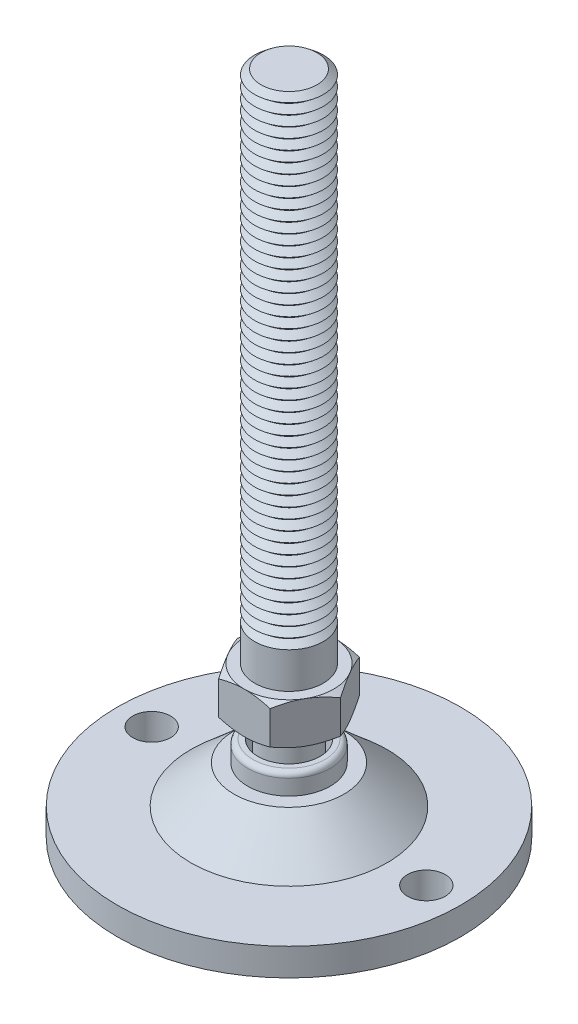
ISO-10303-21;
HEADER;
FILE_DESCRIPTION(('STEP AP214'),'2;1');
FILE_NAME('part.step','',(''),(''),'','','');
FILE_SCHEMA(('AUTOMOTIVE_DESIGN { 1 0 10303 214 1 1 1 1 }'));
ENDSEC;
DATA;
#1=APPLICATION_CONTEXT('core data for automotive mechanical design processes');
#2=APPLICATION_PROTOCOL_DEFINITION('international standard','automotive_design',2000,#1);
#3=PRODUCT_CONTEXT('',#1,'mechanical');
#4=PRODUCT('Part','Part','',(#3));
#5=PRODUCT_RELATED_PRODUCT_CATEGORY('part','',(#4));
#6=PRODUCT_DEFINITION_FORMATION('','',#4);
#7=PRODUCT_DEFINITION_CONTEXT('part definition',#1,'design');
#8=PRODUCT_DEFINITION('design','',#6,#7);
#9=PRODUCT_DEFINITION_SHAPE('','',#8);
#10=(LENGTH_UNIT() NAMED_UNIT(*) SI_UNIT(.MILLI.,.METRE.));
#11=(NAMED_UNIT(*) PLANE_ANGLE_UNIT() SI_UNIT($,.RADIAN.));
#12=(NAMED_UNIT(*) SI_UNIT($,.STERADIAN.) SOLID_ANGLE_UNIT());
#13=UNCERTAINTY_MEASURE_WITH_UNIT(LENGTH_MEASURE(1.E-05),#10,'distance_accuracy_value','');
#14=(GEOMETRIC_REPRESENTATION_CONTEXT(3) GLOBAL_UNCERTAINTY_ASSIGNED_CONTEXT((#13)) GLOBAL_UNIT_ASSIGNED_CONTEXT((#10,
#11,#12)) REPRESENTATION_CONTEXT('',''));
#15=CARTESIAN_POINT('',(0.,0.,0.));
#16=DIRECTION('',(0.,0.,1.));
#17=DIRECTION('',(1.,0.,0.));
#18=AXIS2_PLACEMENT_3D('',#15,#16,#17);
#19=CARTESIAN_POINT('',(0.,91.,0.));
#20=DIRECTION('',(0.,-1.,0.));
#21=DIRECTION('',(0.,0.,-1.));
#22=AXIS2_PLACEMENT_3D('',#19,#20,#21);
#23=CONICAL_SURFACE('',#22,4.06325030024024,0.895664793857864);
#24=CARTESIAN_POINT('',(0.,90.25,0.));
#25=DIRECTION('',(0.,-1.,0.));
#26=DIRECTION('',(0.,0.,-1.));
#27=AXIS2_PLACEMENT_3D('',#24,#25,#26);
#28=CIRCLE('',#27,5.);
#29=CARTESIAN_POINT('',(0.,90.25,-5.));
#30=VERTEX_POINT('',#29);
#31=EDGE_CURVE('P0_E1690',#30,#30,#28,.T.);
#32=ORIENTED_EDGE('',*,*,#31,.F.);
#33=EDGE_LOOP('',(#32));
#34=FACE_BOUND('',#33,.T.);
#35=CARTESIAN_POINT('',(0.,91.,0.));
#36=DIRECTION('',(0.,-1.,0.));
#37=DIRECTION('',(0.,0.,-1.));
#38=AXIS2_PLACEMENT_3D('',#35,#36,#37);
#39=CIRCLE('',#38,4.06325030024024);
#40=CARTESIAN_POINT('',(0.,91.,-4.06325030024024));
#41=VERTEX_POINT('',#40);
#42=EDGE_CURVE('P0_E1699',#41,#41,#39,.T.);
#43=ORIENTED_EDGE('',*,*,#42,.T.);
#44=EDGE_LOOP('',(#43));
#45=FACE_BOUND('',#44,.T.);
#46=ADVANCED_FACE('P0_F16',(#34,#45),#23,.T.);
#47=CARTESIAN_POINT('',(0.,91.75,0.));
#48=DIRECTION('',(0.,1.,0.));
#49=DIRECTION('',(0.,0.,1.));
#50=AXIS2_PLACEMENT_3D('',#47,#48,#49);
#51=CONICAL_SURFACE('',#50,5.,0.895664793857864);
#52=ORIENTED_EDGE('',*,*,#42,.F.);
#53=EDGE_LOOP('',(#52));
#54=FACE_BOUND('',#53,.T.);
#55=CARTESIAN_POINT('',(0.,91.75,0.));
#56=DIRECTION('',(0.,-1.,0.));
#57=DIRECTION('',(0.,0.,-1.));
#58=AXIS2_PLACEMENT_3D('',#55,#56,#57);
#59=CIRCLE('',#58,5.);
#60=CARTESIAN_POINT('',(0.,91.75,-5.));
#61=VERTEX_POINT('',#60);
#62=EDGE_CURVE('P0_E1696',#61,#61,#59,.T.);
#63=ORIENTED_EDGE('',*,*,#62,.T.);
#64=EDGE_LOOP('',(#63));
#65=FACE_BOUND('',#64,.T.);
#66=ADVANCED_FACE('P0_F308',(#54,#65),#51,.T.);
#67=CARTESIAN_POINT('',(0.,97.,0.));
#68=DIRECTION('',(0.,1.,0.));
#69=DIRECTION('',(0.,0.,1.));
#70=AXIS2_PLACEMENT_3D('',#67,#68,#69);
#71=PLANE('',#70);
#72=CARTESIAN_POINT('',(0.,97.,0.));
#73=DIRECTION('',(0.,-1.,0.));
#74=DIRECTION('',(0.,0.,-1.));
#75=AXIS2_PLACEMENT_3D('',#72,#73,#74);
#76=CIRCLE('',#75,4.06325030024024);
#77=CARTESIAN_POINT('',(0.,97.,-4.06325030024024));
#78=VERTEX_POINT('',#77);
#79=EDGE_CURVE('P0_E143',#78,#78,#76,.T.);
#80=ORIENTED_EDGE('',*,*,#79,.F.);
#81=EDGE_LOOP('',(#80));
#82=FACE_BOUND('',#81,.T.);
#83=ADVANCED_FACE('P0_F314',(#82),#71,.T.);
#84=CARTESIAN_POINT('',(0.,97.,0.));
#85=DIRECTION('',(0.,-1.,0.));
#86=DIRECTION('',(0.,0.,-1.));
#87=AXIS2_PLACEMENT_3D('',#84,#85,#86);
#88=CONICAL_SURFACE('',#87,4.06325030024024,0.895664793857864);
#89=CARTESIAN_POINT('',(0.,96.25,0.));
#90=DIRECTION('',(0.,-1.,0.));
#91=DIRECTION('',(0.,0.,-1.));
#92=AXIS2_PLACEMENT_3D('',#89,#90,#91);
#93=CIRCLE('',#92,5.);
#94=CARTESIAN_POINT('',(0.,96.25,-5.));
#95=VERTEX_POINT('',#94);
#96=EDGE_CURVE('P0_E353',#95,#95,#93,.T.);
#97=ORIENTED_EDGE('',*,*,#96,.F.);
#98=EDGE_LOOP('',(#97));
#99=FACE_BOUND('',#98,.T.);
#100=ORIENTED_EDGE('',*,*,#79,.T.);
#101=EDGE_LOOP('',(#100));
#102=FACE_BOUND('',#101,.T.);
#103=ADVANCED_FACE('P0_F211',(#99,#102),#88,.T.);
#104=CARTESIAN_POINT('',(0.,96.25,0.));
#105=DIRECTION('',(0.,1.,0.));
#106=DIRECTION('',(0.,0.,1.));
#107=AXIS2_PLACEMENT_3D('',#104,#105,#106);
#108=CONICAL_SURFACE('',#107,5.,0.895664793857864);
#109=CARTESIAN_POINT('',(0.,95.5,0.));
#110=DIRECTION('',(0.,-1.,0.));
#111=DIRECTION('',(0.,0.,-1.));
#112=AXIS2_PLACEMENT_3D('',#109,#110,#111);
#113=CIRCLE('',#112,4.06325030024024);
#114=CARTESIAN_POINT('',(0.,95.5,-4.06325030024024));
#115=VERTEX_POINT('',#114);
#116=EDGE_CURVE('P0_E352',#115,#115,#113,.T.);
#117=ORIENTED_EDGE('',*,*,#116,.F.);
#118=EDGE_LOOP('',(#117));
#119=FACE_BOUND('',#118,.T.);
#120=ORIENTED_EDGE('',*,*,#96,.T.);
#121=EDGE_LOOP('',(#120));
#122=FACE_BOUND('',#121,.T.);
#123=ADVANCED_FACE('P0_F339',(#119,#122),#108,.T.);
#124=CARTESIAN_POINT('',(0.,95.5,0.));
#125=DIRECTION('',(0.,-1.,0.));
#126=DIRECTION('',(0.,0.,-1.));
#127=AXIS2_PLACEMENT_3D('',#124,#125,#126);
#128=CONICAL_SURFACE('',#127,4.06325030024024,0.895664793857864);
#129=CARTESIAN_POINT('',(0.,94.75,0.));
#130=DIRECTION('',(0.,-1.,0.));
#131=DIRECTION('',(0.,0.,-1.));
#132=AXIS2_PLACEMENT_3D('',#129,#130,#131);
#133=CIRCLE('',#132,5.);
#134=CARTESIAN_POINT('',(0.,94.75,-5.));
#135=VERTEX_POINT('',#134);
#136=EDGE_CURVE('P0_E349',#135,#135,#133,.T.);
#137=ORIENTED_EDGE('',*,*,#136,.F.);
#138=EDGE_LOOP('',(#137));
#139=FACE_BOUND('',#138,.T.);
#140=ORIENTED_EDGE('',*,*,#116,.T.);
#141=EDGE_LOOP('',(#140));
#142=FACE_BOUND('',#141,.T.);
#143=ADVANCED_FACE('P0_F334',(#139,#142),#128,.T.);
#144=CARTESIAN_POINT('',(0.,94.75,0.));
#145=DIRECTION('',(0.,1.,0.));
#146=DIRECTION('',(0.,0.,1.));
#147=AXIS2_PLACEMENT_3D('',#144,#145,#146);
#148=CONICAL_SURFACE('',#147,5.,0.895664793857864);
#149=CARTESIAN_POINT('',(0.,94.,0.));
#150=DIRECTION('',(0.,-1.,0.));
#151=DIRECTION('',(0.,0.,-1.));
#152=AXIS2_PLACEMENT_3D('',#149,#150,#151);
#153=CIRCLE('',#152,4.06325030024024);
#154=CARTESIAN_POINT('',(0.,94.,-4.06325030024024));
#155=VERTEX_POINT('',#154);
#156=EDGE_CURVE('P0_E358',#155,#155,#153,.T.);
#157=ORIENTED_EDGE('',*,*,#156,.F.);
#158=EDGE_LOOP('',(#157));
#159=FACE_BOUND('',#158,.T.);
#160=ORIENTED_EDGE('',*,*,#136,.T.);
#161=EDGE_LOOP('',(#160));
#162=FACE_BOUND('',#161,.T.);
#163=ADVANCED_FACE('P0_F331',(#159,#162),#148,.T.);
#164=CARTESIAN_POINT('',(0.,94.,0.));
#165=DIRECTION('',(0.,-1.,0.));
#166=DIRECTION('',(0.,0.,-1.));
#167=AXIS2_PLACEMENT_3D('',#164,#165,#166);
#168=CONICAL_SURFACE('',#167,4.06325030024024,0.895664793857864);
#169=CARTESIAN_POINT('',(0.,93.25,0.));
#170=DIRECTION('',(0.,-1.,0.));
#171=DIRECTION('',(0.,0.,-1.));
#172=AXIS2_PLACEMENT_3D('',#169,#170,#171);
#173=CIRCLE('',#172,5.);
#174=CARTESIAN_POINT('',(0.,93.25,-5.));
#175=VERTEX_POINT('',#174);
#176=EDGE_CURVE('P0_E1702',#175,#175,#173,.T.);
#177=ORIENTED_EDGE('',*,*,#176,.F.);
#178=EDGE_LOOP('',(#177));
#179=FACE_BOUND('',#178,.T.);
#180=ORIENTED_EDGE('',*,*,#156,.T.);
#181=EDGE_LOOP('',(#180));
#182=FACE_BOUND('',#181,.T.);
#183=ADVANCED_FACE('P0_F325',(#179,#182),#168,.T.);
#184=CARTESIAN_POINT('',(0.,93.25,0.));
#185=DIRECTION('',(0.,1.,0.));
#186=DIRECTION('',(0.,0.,1.));
#187=AXIS2_PLACEMENT_3D('',#184,#185,#186);
#188=CONICAL_SURFACE('',#187,5.,0.895664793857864);
#189=CARTESIAN_POINT('',(0.,92.5,0.));
#190=DIRECTION('',(0.,-1.,0.));
#191=DIRECTION('',(0.,0.,-1.));
#192=AXIS2_PLACEMENT_3D('',#189,#190,#191);
#193=CIRCLE('',#192,4.06325030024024);
#194=CARTESIAN_POINT('',(0.,92.5,-4.06325030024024));
#195=VERTEX_POINT('',#194);
#196=EDGE_CURVE('P0_E1705',#195,#195,#193,.T.);
#197=ORIENTED_EDGE('',*,*,#196,.F.);
#198=EDGE_LOOP('',(#197));
#199=FACE_BOUND('',#198,.T.);
#200=ORIENTED_EDGE('',*,*,#176,.T.);
#201=EDGE_LOOP('',(#200));
#202=FACE_BOUND('',#201,.T.);
#203=ADVANCED_FACE('P0_F321',(#199,#202),#188,.T.);
#204=CARTESIAN_POINT('',(0.,92.5,0.));
#205=DIRECTION('',(0.,-1.,0.));
#206=DIRECTION('',(0.,0.,-1.));
#207=AXIS2_PLACEMENT_3D('',#204,#205,#206);
#208=CONICAL_SURFACE('',#207,4.06325030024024,0.895664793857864);
#209=ORIENTED_EDGE('',*,*,#62,.F.);
#210=EDGE_LOOP('',(#209));
#211=FACE_BOUND('',#210,.T.);
#212=ORIENTED_EDGE('',*,*,#196,.T.);
#213=EDGE_LOOP('',(#212));
#214=FACE_BOUND('',#213,.T.);
#215=ADVANCED_FACE('P0_F324',(#211,#214),#208,.T.);
#216=CARTESIAN_POINT('',(0.,89.5,0.));
#217=DIRECTION('',(0.,-1.,0.));
#218=DIRECTION('',(0.,0.,-1.));
#219=AXIS2_PLACEMENT_3D('',#216,#217,#218);
#220=CONICAL_SURFACE('',#219,4.06325030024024,0.895664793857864);
#221=CARTESIAN_POINT('',(0.,88.75,0.));
#222=DIRECTION('',(0.,-1.,0.));
#223=DIRECTION('',(0.,0.,-1.));
#224=AXIS2_PLACEMENT_3D('',#221,#222,#223);
#225=CIRCLE('',#224,5.);
#226=CARTESIAN_POINT('',(0.,88.75,-5.));
#227=VERTEX_POINT('',#226);
#228=EDGE_CURVE('P0_E1684',#227,#227,#225,.T.);
#229=ORIENTED_EDGE('',*,*,#228,.F.);
#230=EDGE_LOOP('',(#229));
#231=FACE_BOUND('',#230,.T.);
#232=CARTESIAN_POINT('',(0.,89.5,0.));
#233=DIRECTION('',(0.,-1.,0.));
#234=DIRECTION('',(0.,0.,-1.));
#235=AXIS2_PLACEMENT_3D('',#232,#233,#234);
#236=CIRCLE('',#235,4.06325030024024);
#237=CARTESIAN_POINT('',(0.,89.5,-4.06325030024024));
#238=VERTEX_POINT('',#237);
#239=EDGE_CURVE('P0_E1693',#238,#238,#236,.T.);
#240=ORIENTED_EDGE('',*,*,#239,.T.);
#241=EDGE_LOOP('',(#240));
#242=FACE_BOUND('',#241,.T.);
#243=ADVANCED_FACE('P0_F329',(#231,#242),#220,.T.);
#244=CARTESIAN_POINT('',(0.,90.25,0.));
#245=DIRECTION('',(0.,1.,0.));
#246=DIRECTION('',(0.,0.,1.));
#247=AXIS2_PLACEMENT_3D('',#244,#245,#246);
#248=CONICAL_SURFACE('',#247,5.,0.895664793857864);
#249=ORIENTED_EDGE('',*,*,#239,.F.);
#250=EDGE_LOOP('',(#249));
#251=FACE_BOUND('',#250,.T.);
#252=ORIENTED_EDGE('',*,*,#31,.T.);
#253=EDGE_LOOP('',(#252));
#254=FACE_BOUND('',#253,.T.);
#255=ADVANCED_FACE('P0_F1344',(#251,#254),#248,.T.);
#256=CARTESIAN_POINT('',(0.,88.,0.));
#257=DIRECTION('',(0.,-1.,0.));
#258=DIRECTION('',(0.,0.,-1.));
#259=AXIS2_PLACEMENT_3D('',#256,#257,#258);
#260=CONICAL_SURFACE('',#259,4.06325030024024,0.895664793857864);
#261=CARTESIAN_POINT('',(0.,87.25,0.));
#262=DIRECTION('',(0.,-1.,0.));
#263=DIRECTION('',(0.,0.,-1.));
#264=AXIS2_PLACEMENT_3D('',#261,#262,#263);
#265=CIRCLE('',#264,5.);
#266=CARTESIAN_POINT('',(0.,87.25,-5.));
#267=VERTEX_POINT('',#266);
#268=EDGE_CURVE('P0_E1678',#267,#267,#265,.T.);
#269=ORIENTED_EDGE('',*,*,#268,.F.);
#270=EDGE_LOOP('',(#269));
#271=FACE_BOUND('',#270,.T.);
#272=CARTESIAN_POINT('',(0.,88.,0.));
#273=DIRECTION('',(0.,-1.,0.));
#274=DIRECTION('',(0.,0.,-1.));
#275=AXIS2_PLACEMENT_3D('',#272,#273,#274);
#276=CIRCLE('',#275,4.06325030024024);
#277=CARTESIAN_POINT('',(0.,88.,-4.06325030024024));
#278=VERTEX_POINT('',#277);
#279=EDGE_CURVE('P0_E1687',#278,#278,#276,.T.);
#280=ORIENTED_EDGE('',*,*,#279,.T.);
#281=EDGE_LOOP('',(#280));
#282=FACE_BOUND('',#281,.T.);
#283=ADVANCED_FACE('P0_F1334',(#271,#282),#260,.T.);
#284=CARTESIAN_POINT('',(0.,88.75,0.));
#285=DIRECTION('',(0.,1.,0.));
#286=DIRECTION('',(0.,0.,1.));
#287=AXIS2_PLACEMENT_3D('',#284,#285,#286);
#288=CONICAL_SURFACE('',#287,5.,0.895664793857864);
#289=ORIENTED_EDGE('',*,*,#279,.F.);
#290=EDGE_LOOP('',(#289));
#291=FACE_BOUND('',#290,.T.);
#292=ORIENTED_EDGE('',*,*,#228,.T.);
#293=EDGE_LOOP('',(#292));
#294=FACE_BOUND('',#293,.T.);
#295=ADVANCED_FACE('P0_F1324',(#291,#294),#288,.T.);
#296=CARTESIAN_POINT('',(0.,86.5,0.));
#297=DIRECTION('',(0.,-1.,0.));
#298=DIRECTION('',(0.,0.,-1.));
#299=AXIS2_PLACEMENT_3D('',#296,#297,#298);
#300=CONICAL_SURFACE('',#299,4.06325030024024,0.895664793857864);
#301=CARTESIAN_POINT('',(0.,85.75,0.));
#302=DIRECTION('',(0.,-1.,0.));
#303=DIRECTION('',(0.,0.,-1.));
#304=AXIS2_PLACEMENT_3D('',#301,#302,#303);
#305=CIRCLE('',#304,5.);
#306=CARTESIAN_POINT('',(0.,85.75,-5.));
#307=VERTEX_POINT('',#306);
#308=EDGE_CURVE('P0_E1672',#307,#307,#305,.T.);
#309=ORIENTED_EDGE('',*,*,#308,.F.);
#310=EDGE_LOOP('',(#309));
#311=FACE_BOUND('',#310,.T.);
#312=CARTESIAN_POINT('',(0.,86.5,0.));
#313=DIRECTION('',(0.,-1.,0.));
#314=DIRECTION('',(0.,0.,-1.));
#315=AXIS2_PLACEMENT_3D('',#312,#313,#314);
#316=CIRCLE('',#315,4.06325030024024);
#317=CARTESIAN_POINT('',(0.,86.5,-4.06325030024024));
#318=VERTEX_POINT('',#317);
#319=EDGE_CURVE('P0_E1681',#318,#318,#316,.T.);
#320=ORIENTED_EDGE('',*,*,#319,.T.);
#321=EDGE_LOOP('',(#320));
#322=FACE_BOUND('',#321,.T.);
#323=ADVANCED_FACE('P0_F1314',(#311,#322),#300,.T.);
#324=CARTESIAN_POINT('',(0.,87.25,0.));
#325=DIRECTION('',(0.,1.,0.));
#326=DIRECTION('',(0.,0.,1.));
#327=AXIS2_PLACEMENT_3D('',#324,#325,#326);
#328=CONICAL_SURFACE('',#327,5.,0.895664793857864);
#329=ORIENTED_EDGE('',*,*,#319,.F.);
#330=EDGE_LOOP('',(#329));
#331=FACE_BOUND('',#330,.T.);
#332=ORIENTED_EDGE('',*,*,#268,.T.);
#333=EDGE_LOOP('',(#332));
#334=FACE_BOUND('',#333,.T.);
#335=ADVANCED_FACE('P0_F1304',(#331,#334),#328,.T.);
#336=CARTESIAN_POINT('',(0.,85.,0.));
#337=DIRECTION('',(0.,-1.,0.));
#338=DIRECTION('',(0.,0.,-1.));
#339=AXIS2_PLACEMENT_3D('',#336,#337,#338);
#340=CONICAL_SURFACE('',#339,4.06325030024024,0.895664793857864);
#341=CARTESIAN_POINT('',(0.,84.25,0.));
#342=DIRECTION('',(0.,-1.,0.));
#343=DIRECTION('',(0.,0.,-1.));
#344=AXIS2_PLACEMENT_3D('',#341,#342,#343);
#345=CIRCLE('',#344,5.);
#346=CARTESIAN_POINT('',(0.,84.25,-5.));
#347=VERTEX_POINT('',#346);
#348=EDGE_CURVE('P0_E1666',#347,#347,#345,.T.);
#349=ORIENTED_EDGE('',*,*,#348,.F.);
#350=EDGE_LOOP('',(#349));
#351=FACE_BOUND('',#350,.T.);
#352=CARTESIAN_POINT('',(0.,85.,0.));
#353=DIRECTION('',(0.,-1.,0.));
#354=DIRECTION('',(0.,0.,-1.));
#355=AXIS2_PLACEMENT_3D('',#352,#353,#354);
#356=CIRCLE('',#355,4.06325030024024);
#357=CARTESIAN_POINT('',(0.,85.,-4.06325030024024));
#358=VERTEX_POINT('',#357);
#359=EDGE_CURVE('P0_E1675',#358,#358,#356,.T.);
#360=ORIENTED_EDGE('',*,*,#359,.T.);
#361=EDGE_LOOP('',(#360));
#362=FACE_BOUND('',#361,.T.);
#363=ADVANCED_FACE('P0_F1294',(#351,#362),#340,.T.);
#364=CARTESIAN_POINT('',(0.,85.75,0.));
#365=DIRECTION('',(0.,1.,0.));
#366=DIRECTION('',(0.,0.,1.));
#367=AXIS2_PLACEMENT_3D('',#364,#365,#366);
#368=CONICAL_SURFACE('',#367,5.,0.895664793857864);
#369=ORIENTED_EDGE('',*,*,#359,.F.);
#370=EDGE_LOOP('',(#369));
#371=FACE_BOUND('',#370,.T.);
#372=ORIENTED_EDGE('',*,*,#308,.T.);
#373=EDGE_LOOP('',(#372));
#374=FACE_BOUND('',#373,.T.);
#375=ADVANCED_FACE('P0_F1284',(#371,#374),#368,.T.);
#376=CARTESIAN_POINT('',(0.,83.5,0.));
#377=DIRECTION('',(0.,-1.,0.));
#378=DIRECTION('',(0.,0.,-1.));
#379=AXIS2_PLACEMENT_3D('',#376,#377,#378);
#380=CONICAL_SURFACE('',#379,4.06325030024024,0.895664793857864);
#381=CARTESIAN_POINT('',(0.,82.75,0.));
#382=DIRECTION('',(0.,-1.,0.));
#383=DIRECTION('',(0.,0.,-1.));
#384=AXIS2_PLACEMENT_3D('',#381,#382,#383);
#385=CIRCLE('',#384,5.);
#386=CARTESIAN_POINT('',(0.,82.75,-5.));
#387=VERTEX_POINT('',#386);
#388=EDGE_CURVE('P0_E1660',#387,#387,#385,.T.);
#389=ORIENTED_EDGE('',*,*,#388,.F.);
#390=EDGE_LOOP('',(#389));
#391=FACE_BOUND('',#390,.T.);
#392=CARTESIAN_POINT('',(0.,83.5,0.));
#393=DIRECTION('',(0.,-1.,0.));
#394=DIRECTION('',(0.,0.,-1.));
#395=AXIS2_PLACEMENT_3D('',#392,#393,#394);
#396=CIRCLE('',#395,4.06325030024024);
#397=CARTESIAN_POINT('',(0.,83.5,-4.06325030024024));
#398=VERTEX_POINT('',#397);
#399=EDGE_CURVE('P0_E1669',#398,#398,#396,.T.);
#400=ORIENTED_EDGE('',*,*,#399,.T.);
#401=EDGE_LOOP('',(#400));
#402=FACE_BOUND('',#401,.T.);
#403=ADVANCED_FACE('P0_F1274',(#391,#402),#380,.T.);
#404=CARTESIAN_POINT('',(0.,84.25,0.));
#405=DIRECTION('',(0.,1.,0.));
#406=DIRECTION('',(0.,0.,1.));
#407=AXIS2_PLACEMENT_3D('',#404,#405,#406);
#408=CONICAL_SURFACE('',#407,5.,0.895664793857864);
#409=ORIENTED_EDGE('',*,*,#399,.F.);
#410=EDGE_LOOP('',(#409));
#411=FACE_BOUND('',#410,.T.);
#412=ORIENTED_EDGE('',*,*,#348,.T.);
#413=EDGE_LOOP('',(#412));
#414=FACE_BOUND('',#413,.T.);
#415=ADVANCED_FACE('P0_F1264',(#411,#414),#408,.T.);
#416=CARTESIAN_POINT('',(0.,82.,0.));
#417=DIRECTION('',(0.,-1.,0.));
#418=DIRECTION('',(0.,0.,-1.));
#419=AXIS2_PLACEMENT_3D('',#416,#417,#418);
#420=CONICAL_SURFACE('',#419,4.06325030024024,0.895664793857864);
#421=CARTESIAN_POINT('',(0.,81.25,0.));
#422=DIRECTION('',(0.,-1.,0.));
#423=DIRECTION('',(0.,0.,-1.));
#424=AXIS2_PLACEMENT_3D('',#421,#422,#423);
#425=CIRCLE('',#424,5.);
#426=CARTESIAN_POINT('',(0.,81.25,-5.));
#427=VERTEX_POINT('',#426);
#428=EDGE_CURVE('P0_E1654',#427,#427,#425,.T.);
#429=ORIENTED_EDGE('',*,*,#428,.F.);
#430=EDGE_LOOP('',(#429));
#431=FACE_BOUND('',#430,.T.);
#432=CARTESIAN_POINT('',(0.,82.,0.));
#433=DIRECTION('',(0.,-1.,0.));
#434=DIRECTION('',(0.,0.,-1.));
#435=AXIS2_PLACEMENT_3D('',#432,#433,#434);
#436=CIRCLE('',#435,4.06325030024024);
#437=CARTESIAN_POINT('',(0.,82.,-4.06325030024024));
#438=VERTEX_POINT('',#437);
#439=EDGE_CURVE('P0_E1663',#438,#438,#436,.T.);
#440=ORIENTED_EDGE('',*,*,#439,.T.);
#441=EDGE_LOOP('',(#440));
#442=FACE_BOUND('',#441,.T.);
#443=ADVANCED_FACE('P0_F1254',(#431,#442),#420,.T.);
#444=CARTESIAN_POINT('',(0.,82.75,0.));
#445=DIRECTION('',(0.,1.,0.));
#446=DIRECTION('',(0.,0.,1.));
#447=AXIS2_PLACEMENT_3D('',#444,#445,#446);
#448=CONICAL_SURFACE('',#447,5.,0.895664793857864);
#449=ORIENTED_EDGE('',*,*,#439,.F.);
#450=EDGE_LOOP('',(#449));
#451=FACE_BOUND('',#450,.T.);
#452=ORIENTED_EDGE('',*,*,#388,.T.);
#453=EDGE_LOOP('',(#452));
#454=FACE_BOUND('',#453,.T.);
#455=ADVANCED_FACE('P0_F1244',(#451,#454),#448,.T.);
#456=CARTESIAN_POINT('',(0.,80.5,0.));
#457=DIRECTION('',(0.,-1.,0.));
#458=DIRECTION('',(0.,0.,-1.));
#459=AXIS2_PLACEMENT_3D('',#456,#457,#458);
#460=CONICAL_SURFACE('',#459,4.06325030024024,0.895664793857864);
#461=CARTESIAN_POINT('',(0.,79.75,0.));
#462=DIRECTION('',(0.,-1.,0.));
#463=DIRECTION('',(0.,0.,-1.));
#464=AXIS2_PLACEMENT_3D('',#461,#462,#463);
#465=CIRCLE('',#464,5.);
#466=CARTESIAN_POINT('',(0.,79.75,-5.));
#467=VERTEX_POINT('',#466);
#468=EDGE_CURVE('P0_E1648',#467,#467,#465,.T.);
#469=ORIENTED_EDGE('',*,*,#468,.F.);
#470=EDGE_LOOP('',(#469));
#471=FACE_BOUND('',#470,.T.);
#472=CARTESIAN_POINT('',(0.,80.5,0.));
#473=DIRECTION('',(0.,-1.,0.));
#474=DIRECTION('',(0.,0.,-1.));
#475=AXIS2_PLACEMENT_3D('',#472,#473,#474);
#476=CIRCLE('',#475,4.06325030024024);
#477=CARTESIAN_POINT('',(0.,80.5,-4.06325030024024));
#478=VERTEX_POINT('',#477);
#479=EDGE_CURVE('P0_E1657',#478,#478,#476,.T.);
#480=ORIENTED_EDGE('',*,*,#479,.T.);
#481=EDGE_LOOP('',(#480));
#482=FACE_BOUND('',#481,.T.);
#483=ADVANCED_FACE('P0_F1234',(#471,#482),#460,.T.);
#484=CARTESIAN_POINT('',(0.,81.25,0.));
#485=DIRECTION('',(0.,1.,0.));
#486=DIRECTION('',(0.,0.,1.));
#487=AXIS2_PLACEMENT_3D('',#484,#485,#486);
#488=CONICAL_SURFACE('',#487,5.,0.895664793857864);
#489=ORIENTED_EDGE('',*,*,#479,.F.);
#490=EDGE_LOOP('',(#489));
#491=FACE_BOUND('',#490,.T.);
#492=ORIENTED_EDGE('',*,*,#428,.T.);
#493=EDGE_LOOP('',(#492));
#494=FACE_BOUND('',#493,.T.);
#495=ADVANCED_FACE('P0_F1224',(#491,#494),#488,.T.);
#496=CARTESIAN_POINT('',(0.,79.,0.));
#497=DIRECTION('',(0.,-1.,0.));
#498=DIRECTION('',(0.,0.,-1.));
#499=AXIS2_PLACEMENT_3D('',#496,#497,#498);
#500=CONICAL_SURFACE('',#499,4.06325030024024,0.895664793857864);
#501=CARTESIAN_POINT('',(0.,78.25,0.));
#502=DIRECTION('',(0.,-1.,0.));
#503=DIRECTION('',(0.,0.,-1.));
#504=AXIS2_PLACEMENT_3D('',#501,#502,#503);
#505=CIRCLE('',#504,5.);
#506=CARTESIAN_POINT('',(0.,78.25,-5.));
#507=VERTEX_POINT('',#506);
#508=EDGE_CURVE('P0_E1642',#507,#507,#505,.T.);
#509=ORIENTED_EDGE('',*,*,#508,.F.);
#510=EDGE_LOOP('',(#509));
#511=FACE_BOUND('',#510,.T.);
#512=CARTESIAN_POINT('',(0.,79.,0.));
#513=DIRECTION('',(0.,-1.,0.));
#514=DIRECTION('',(0.,0.,-1.));
#515=AXIS2_PLACEMENT_3D('',#512,#513,#514);
#516=CIRCLE('',#515,4.06325030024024);
#517=CARTESIAN_POINT('',(0.,79.,-4.06325030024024));
#518=VERTEX_POINT('',#517);
#519=EDGE_CURVE('P0_E1651',#518,#518,#516,.T.);
#520=ORIENTED_EDGE('',*,*,#519,.T.);
#521=EDGE_LOOP('',(#520));
#522=FACE_BOUND('',#521,.T.);
#523=ADVANCED_FACE('P0_F1214',(#511,#522),#500,.T.);
#524=CARTESIAN_POINT('',(0.,79.75,0.));
#525=DIRECTION('',(0.,1.,0.));
#526=DIRECTION('',(0.,0.,1.));
#527=AXIS2_PLACEMENT_3D('',#524,#525,#526);
#528=CONICAL_SURFACE('',#527,5.,0.895664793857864);
#529=ORIENTED_EDGE('',*,*,#519,.F.);
#530=EDGE_LOOP('',(#529));
#531=FACE_BOUND('',#530,.T.);
#532=ORIENTED_EDGE('',*,*,#468,.T.);
#533=EDGE_LOOP('',(#532));
#534=FACE_BOUND('',#533,.T.);
#535=ADVANCED_FACE('P0_F1204',(#531,#534),#528,.T.);
#536=CARTESIAN_POINT('',(0.,77.5,0.));
#537=DIRECTION('',(0.,-1.,0.));
#538=DIRECTION('',(0.,0.,-1.));
#539=AXIS2_PLACEMENT_3D('',#536,#537,#538);
#540=CONICAL_SURFACE('',#539,4.06325030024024,0.895664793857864);
#541=CARTESIAN_POINT('',(0.,76.75,0.));
#542=DIRECTION('',(0.,-1.,0.));
#543=DIRECTION('',(0.,0.,-1.));
#544=AXIS2_PLACEMENT_3D('',#541,#542,#543);
#545=CIRCLE('',#544,5.);
#546=CARTESIAN_POINT('',(0.,76.75,-5.));
#547=VERTEX_POINT('',#546);
#548=EDGE_CURVE('P0_E1636',#547,#547,#545,.T.);
#549=ORIENTED_EDGE('',*,*,#548,.F.);
#550=EDGE_LOOP('',(#549));
#551=FACE_BOUND('',#550,.T.);
#552=CARTESIAN_POINT('',(0.,77.5,0.));
#553=DIRECTION('',(0.,-1.,0.));
#554=DIRECTION('',(0.,0.,-1.));
#555=AXIS2_PLACEMENT_3D('',#552,#553,#554);
#556=CIRCLE('',#555,4.06325030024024);
#557=CARTESIAN_POINT('',(0.,77.5,-4.06325030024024));
#558=VERTEX_POINT('',#557);
#559=EDGE_CURVE('P0_E1645',#558,#558,#556,.T.);
#560=ORIENTED_EDGE('',*,*,#559,.T.);
#561=EDGE_LOOP('',(#560));
#562=FACE_BOUND('',#561,.T.);
#563=ADVANCED_FACE('P0_F1194',(#551,#562),#540,.T.);
#564=CARTESIAN_POINT('',(0.,78.25,0.));
#565=DIRECTION('',(0.,1.,0.));
#566=DIRECTION('',(0.,0.,1.));
#567=AXIS2_PLACEMENT_3D('',#564,#565,#566);
#568=CONICAL_SURFACE('',#567,5.,0.895664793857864);
#569=ORIENTED_EDGE('',*,*,#559,.F.);
#570=EDGE_LOOP('',(#569));
#571=FACE_BOUND('',#570,.T.);
#572=ORIENTED_EDGE('',*,*,#508,.T.);
#573=EDGE_LOOP('',(#572));
#574=FACE_BOUND('',#573,.T.);
#575=ADVANCED_FACE('P0_F1184',(#571,#574),#568,.T.);
#576=CARTESIAN_POINT('',(0.,76.,0.));
#577=DIRECTION('',(0.,-1.,0.));
#578=DIRECTION('',(0.,0.,-1.));
#579=AXIS2_PLACEMENT_3D('',#576,#577,#578);
#580=CONICAL_SURFACE('',#579,4.06325030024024,0.895664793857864);
#581=CARTESIAN_POINT('',(0.,75.25,0.));
#582=DIRECTION('',(0.,-1.,0.));
#583=DIRECTION('',(0.,0.,-1.));
#584=AXIS2_PLACEMENT_3D('',#581,#582,#583);
#585=CIRCLE('',#584,5.);
#586=CARTESIAN_POINT('',(0.,75.25,-5.));
#587=VERTEX_POINT('',#586);
#588=EDGE_CURVE('P0_E1630',#587,#587,#585,.T.);
#589=ORIENTED_EDGE('',*,*,#588,.F.);
#590=EDGE_LOOP('',(#589));
#591=FACE_BOUND('',#590,.T.);
#592=CARTESIAN_POINT('',(0.,76.,0.));
#593=DIRECTION('',(0.,-1.,0.));
#594=DIRECTION('',(0.,0.,-1.));
#595=AXIS2_PLACEMENT_3D('',#592,#593,#594);
#596=CIRCLE('',#595,4.06325030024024);
#597=CARTESIAN_POINT('',(0.,76.,-4.06325030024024));
#598=VERTEX_POINT('',#597);
#599=EDGE_CURVE('P0_E1639',#598,#598,#596,.T.);
#600=ORIENTED_EDGE('',*,*,#599,.T.);
#601=EDGE_LOOP('',(#600));
#602=FACE_BOUND('',#601,.T.);
#603=ADVANCED_FACE('P0_F1174',(#591,#602),#580,.T.);
#604=CARTESIAN_POINT('',(0.,76.75,0.));
#605=DIRECTION('',(0.,1.,0.));
#606=DIRECTION('',(0.,0.,1.));
#607=AXIS2_PLACEMENT_3D('',#604,#605,#606);
#608=CONICAL_SURFACE('',#607,5.,0.895664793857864);
#609=ORIENTED_EDGE('',*,*,#599,.F.);
#610=EDGE_LOOP('',(#609));
#611=FACE_BOUND('',#610,.T.);
#612=ORIENTED_EDGE('',*,*,#548,.T.);
#613=EDGE_LOOP('',(#612));
#614=FACE_BOUND('',#613,.T.);
#615=ADVANCED_FACE('P0_F1164',(#611,#614),#608,.T.);
#616=CARTESIAN_POINT('',(0.,74.5,0.));
#617=DIRECTION('',(0.,-1.,0.));
#618=DIRECTION('',(0.,0.,-1.));
#619=AXIS2_PLACEMENT_3D('',#616,#617,#618);
#620=CONICAL_SURFACE('',#619,4.06325030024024,0.895664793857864);
#621=CARTESIAN_POINT('',(0.,73.75,0.));
#622=DIRECTION('',(0.,-1.,0.));
#623=DIRECTION('',(0.,0.,-1.));
#624=AXIS2_PLACEMENT_3D('',#621,#622,#623);
#625=CIRCLE('',#624,5.);
#626=CARTESIAN_POINT('',(0.,73.75,-5.));
#627=VERTEX_POINT('',#626);
#628=EDGE_CURVE('P0_E1624',#627,#627,#625,.T.);
#629=ORIENTED_EDGE('',*,*,#628,.F.);
#630=EDGE_LOOP('',(#629));
#631=FACE_BOUND('',#630,.T.);
#632=CARTESIAN_POINT('',(0.,74.5,0.));
#633=DIRECTION('',(0.,-1.,0.));
#634=DIRECTION('',(0.,0.,-1.));
#635=AXIS2_PLACEMENT_3D('',#632,#633,#634);
#636=CIRCLE('',#635,4.06325030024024);
#637=CARTESIAN_POINT('',(0.,74.5,-4.06325030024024));
#638=VERTEX_POINT('',#637);
#639=EDGE_CURVE('P0_E1633',#638,#638,#636,.T.);
#640=ORIENTED_EDGE('',*,*,#639,.T.);
#641=EDGE_LOOP('',(#640));
#642=FACE_BOUND('',#641,.T.);
#643=ADVANCED_FACE('P0_F1154',(#631,#642),#620,.T.);
#644=CARTESIAN_POINT('',(0.,75.25,0.));
#645=DIRECTION('',(0.,1.,0.));
#646=DIRECTION('',(0.,0.,1.));
#647=AXIS2_PLACEMENT_3D('',#644,#645,#646);
#648=CONICAL_SURFACE('',#647,5.,0.895664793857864);
#649=ORIENTED_EDGE('',*,*,#639,.F.);
#650=EDGE_LOOP('',(#649));
#651=FACE_BOUND('',#650,.T.);
#652=ORIENTED_EDGE('',*,*,#588,.T.);
#653=EDGE_LOOP('',(#652));
#654=FACE_BOUND('',#653,.T.);
#655=ADVANCED_FACE('P0_F1144',(#651,#654),#648,.T.);
#656=CARTESIAN_POINT('',(0.,73.,0.));
#657=DIRECTION('',(0.,-1.,0.));
#658=DIRECTION('',(0.,0.,-1.));
#659=AXIS2_PLACEMENT_3D('',#656,#657,#658);
#660=CONICAL_SURFACE('',#659,4.06325030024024,0.895664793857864);
#661=CARTESIAN_POINT('',(0.,72.25,0.));
#662=DIRECTION('',(0.,-1.,0.));
#663=DIRECTION('',(0.,0.,-1.));
#664=AXIS2_PLACEMENT_3D('',#661,#662,#663);
#665=CIRCLE('',#664,5.);
#666=CARTESIAN_POINT('',(0.,72.25,-5.));
#667=VERTEX_POINT('',#666);
#668=EDGE_CURVE('P0_E1618',#667,#667,#665,.T.);
#669=ORIENTED_EDGE('',*,*,#668,.F.);
#670=EDGE_LOOP('',(#669));
#671=FACE_BOUND('',#670,.T.);
#672=CARTESIAN_POINT('',(0.,73.,0.));
#673=DIRECTION('',(0.,-1.,0.));
#674=DIRECTION('',(0.,0.,-1.));
#675=AXIS2_PLACEMENT_3D('',#672,#673,#674);
#676=CIRCLE('',#675,4.06325030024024);
#677=CARTESIAN_POINT('',(0.,73.,-4.06325030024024));
#678=VERTEX_POINT('',#677);
#679=EDGE_CURVE('P0_E1627',#678,#678,#676,.T.);
#680=ORIENTED_EDGE('',*,*,#679,.T.);
#681=EDGE_LOOP('',(#680));
#682=FACE_BOUND('',#681,.T.);
#683=ADVANCED_FACE('P0_F1134',(#671,#682),#660,.T.);
#684=CARTESIAN_POINT('',(0.,73.75,0.));
#685=DIRECTION('',(0.,1.,0.));
#686=DIRECTION('',(0.,0.,1.));
#687=AXIS2_PLACEMENT_3D('',#684,#685,#686);
#688=CONICAL_SURFACE('',#687,5.,0.895664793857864);
#689=ORIENTED_EDGE('',*,*,#679,.F.);
#690=EDGE_LOOP('',(#689));
#691=FACE_BOUND('',#690,.T.);
#692=ORIENTED_EDGE('',*,*,#628,.T.);
#693=EDGE_LOOP('',(#692));
#694=FACE_BOUND('',#693,.T.);
#695=ADVANCED_FACE('P0_F1124',(#691,#694),#688,.T.);
#696=CARTESIAN_POINT('',(0.,71.5,0.));
#697=DIRECTION('',(0.,-1.,0.));
#698=DIRECTION('',(0.,0.,-1.));
#699=AXIS2_PLACEMENT_3D('',#696,#697,#698);
#700=CONICAL_SURFACE('',#699,4.06325030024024,0.895664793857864);
#701=CARTESIAN_POINT('',(0.,70.75,0.));
#702=DIRECTION('',(0.,-1.,0.));
#703=DIRECTION('',(0.,0.,-1.));
#704=AXIS2_PLACEMENT_3D('',#701,#702,#703);
#705=CIRCLE('',#704,5.);
#706=CARTESIAN_POINT('',(0.,70.75,-4.99999999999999));
#707=VERTEX_POINT('',#706);
#708=EDGE_CURVE('P0_E1612',#707,#707,#705,.T.);
#709=ORIENTED_EDGE('',*,*,#708,.F.);
#710=EDGE_LOOP('',(#709));
#711=FACE_BOUND('',#710,.T.);
#712=CARTESIAN_POINT('',(0.,71.5,0.));
#713=DIRECTION('',(0.,-1.,0.));
#714=DIRECTION('',(0.,0.,-1.));
#715=AXIS2_PLACEMENT_3D('',#712,#713,#714);
#716=CIRCLE('',#715,4.06325030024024);
#717=CARTESIAN_POINT('',(0.,71.5,-4.06325030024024));
#718=VERTEX_POINT('',#717);
#719=EDGE_CURVE('P0_E1621',#718,#718,#716,.T.);
#720=ORIENTED_EDGE('',*,*,#719,.T.);
#721=EDGE_LOOP('',(#720));
#722=FACE_BOUND('',#721,.T.);
#723=ADVANCED_FACE('P0_F1114',(#711,#722),#700,.T.);
#724=CARTESIAN_POINT('',(0.,72.25,0.));
#725=DIRECTION('',(0.,1.,0.));
#726=DIRECTION('',(0.,0.,1.));
#727=AXIS2_PLACEMENT_3D('',#724,#725,#726);
#728=CONICAL_SURFACE('',#727,5.,0.895664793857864);
#729=ORIENTED_EDGE('',*,*,#719,.F.);
#730=EDGE_LOOP('',(#729));
#731=FACE_BOUND('',#730,.T.);
#732=ORIENTED_EDGE('',*,*,#668,.T.);
#733=EDGE_LOOP('',(#732));
#734=FACE_BOUND('',#733,.T.);
#735=ADVANCED_FACE('P0_F1104',(#731,#734),#728,.T.);
#736=CARTESIAN_POINT('',(0.,70.,0.));
#737=DIRECTION('',(0.,-1.,0.));
#738=DIRECTION('',(0.,0.,-1.));
#739=AXIS2_PLACEMENT_3D('',#736,#737,#738);
#740=CONICAL_SURFACE('',#739,4.06325030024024,0.895664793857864);
#741=CARTESIAN_POINT('',(0.,69.25,0.));
#742=DIRECTION('',(0.,-1.,0.));
#743=DIRECTION('',(0.,0.,-1.));
#744=AXIS2_PLACEMENT_3D('',#741,#742,#743);
#745=CIRCLE('',#744,5.);
#746=CARTESIAN_POINT('',(0.,69.25,-4.99999999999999));
#747=VERTEX_POINT('',#746);
#748=EDGE_CURVE('P0_E1606',#747,#747,#745,.T.);
#749=ORIENTED_EDGE('',*,*,#748,.F.);
#750=EDGE_LOOP('',(#749));
#751=FACE_BOUND('',#750,.T.);
#752=CARTESIAN_POINT('',(0.,70.,0.));
#753=DIRECTION('',(0.,-1.,0.));
#754=DIRECTION('',(0.,0.,-1.));
#755=AXIS2_PLACEMENT_3D('',#752,#753,#754);
#756=CIRCLE('',#755,4.06325030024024);
#757=CARTESIAN_POINT('',(0.,70.,-4.06325030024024));
#758=VERTEX_POINT('',#757);
#759=EDGE_CURVE('P0_E1615',#758,#758,#756,.T.);
#760=ORIENTED_EDGE('',*,*,#759,.T.);
#761=EDGE_LOOP('',(#760));
#762=FACE_BOUND('',#761,.T.);
#763=ADVANCED_FACE('P0_F1094',(#751,#762),#740,.T.);
#764=CARTESIAN_POINT('',(0.,70.75,0.));
#765=DIRECTION('',(0.,1.,0.));
#766=DIRECTION('',(0.,0.,1.));
#767=AXIS2_PLACEMENT_3D('',#764,#765,#766);
#768=CONICAL_SURFACE('',#767,5.,0.895664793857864);
#769=ORIENTED_EDGE('',*,*,#759,.F.);
#770=EDGE_LOOP('',(#769));
#771=FACE_BOUND('',#770,.T.);
#772=ORIENTED_EDGE('',*,*,#708,.T.);
#773=EDGE_LOOP('',(#772));
#774=FACE_BOUND('',#773,.T.);
#775=ADVANCED_FACE('P0_F1084',(#771,#774),#768,.T.);
#776=CARTESIAN_POINT('',(0.,68.5,0.));
#777=DIRECTION('',(0.,-1.,0.));
#778=DIRECTION('',(0.,0.,-1.));
#779=AXIS2_PLACEMENT_3D('',#776,#777,#778);
#780=CONICAL_SURFACE('',#779,4.06325030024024,0.895664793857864);
#781=CARTESIAN_POINT('',(0.,67.75,0.));
#782=DIRECTION('',(0.,-1.,0.));
#783=DIRECTION('',(0.,0.,-1.));
#784=AXIS2_PLACEMENT_3D('',#781,#782,#783);
#785=CIRCLE('',#784,5.);
#786=CARTESIAN_POINT('',(0.,67.75,-4.99999999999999));
#787=VERTEX_POINT('',#786);
#788=EDGE_CURVE('P0_E1600',#787,#787,#785,.T.);
#789=ORIENTED_EDGE('',*,*,#788,.F.);
#790=EDGE_LOOP('',(#789));
#791=FACE_BOUND('',#790,.T.);
#792=CARTESIAN_POINT('',(0.,68.5,0.));
#793=DIRECTION('',(0.,-1.,0.));
#794=DIRECTION('',(0.,0.,-1.));
#795=AXIS2_PLACEMENT_3D('',#792,#793,#794);
#796=CIRCLE('',#795,4.06325030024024);
#797=CARTESIAN_POINT('',(0.,68.5,-4.06325030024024));
#798=VERTEX_POINT('',#797);
#799=EDGE_CURVE('P0_E1609',#798,#798,#796,.T.);
#800=ORIENTED_EDGE('',*,*,#799,.T.);
#801=EDGE_LOOP('',(#800));
#802=FACE_BOUND('',#801,.T.);
#803=ADVANCED_FACE('P0_F1074',(#791,#802),#780,.T.);
#804=CARTESIAN_POINT('',(0.,69.25,0.));
#805=DIRECTION('',(0.,1.,0.));
#806=DIRECTION('',(0.,0.,1.));
#807=AXIS2_PLACEMENT_3D('',#804,#805,#806);
#808=CONICAL_SURFACE('',#807,5.,0.895664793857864);
#809=ORIENTED_EDGE('',*,*,#799,.F.);
#810=EDGE_LOOP('',(#809));
#811=FACE_BOUND('',#810,.T.);
#812=ORIENTED_EDGE('',*,*,#748,.T.);
#813=EDGE_LOOP('',(#812));
#814=FACE_BOUND('',#813,.T.);
#815=ADVANCED_FACE('P0_F1064',(#811,#814),#808,.T.);
#816=CARTESIAN_POINT('',(0.,67.,0.));
#817=DIRECTION('',(0.,-1.,0.));
#818=DIRECTION('',(0.,0.,-1.));
#819=AXIS2_PLACEMENT_3D('',#816,#817,#818);
#820=CONICAL_SURFACE('',#819,4.06325030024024,0.895664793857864);
#821=CARTESIAN_POINT('',(0.,66.25,0.));
#822=DIRECTION('',(0.,-1.,0.));
#823=DIRECTION('',(0.,0.,-1.));
#824=AXIS2_PLACEMENT_3D('',#821,#822,#823);
#825=CIRCLE('',#824,5.);
#826=CARTESIAN_POINT('',(0.,66.25,-4.99999999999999));
#827=VERTEX_POINT('',#826);
#828=EDGE_CURVE('P0_E1594',#827,#827,#825,.T.);
#829=ORIENTED_EDGE('',*,*,#828,.F.);
#830=EDGE_LOOP('',(#829));
#831=FACE_BOUND('',#830,.T.);
#832=CARTESIAN_POINT('',(0.,67.,0.));
#833=DIRECTION('',(0.,-1.,0.));
#834=DIRECTION('',(0.,0.,-1.));
#835=AXIS2_PLACEMENT_3D('',#832,#833,#834);
#836=CIRCLE('',#835,4.06325030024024);
#837=CARTESIAN_POINT('',(0.,67.,-4.06325030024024));
#838=VERTEX_POINT('',#837);
#839=EDGE_CURVE('P0_E1603',#838,#838,#836,.T.);
#840=ORIENTED_EDGE('',*,*,#839,.T.);
#841=EDGE_LOOP('',(#840));
#842=FACE_BOUND('',#841,.T.);
#843=ADVANCED_FACE('P0_F1054',(#831,#842),#820,.T.);
#844=CARTESIAN_POINT('',(0.,67.75,0.));
#845=DIRECTION('',(0.,1.,0.));
#846=DIRECTION('',(0.,0.,1.));
#847=AXIS2_PLACEMENT_3D('',#844,#845,#846);
#848=CONICAL_SURFACE('',#847,5.,0.895664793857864);
#849=ORIENTED_EDGE('',*,*,#839,.F.);
#850=EDGE_LOOP('',(#849));
#851=FACE_BOUND('',#850,.T.);
#852=ORIENTED_EDGE('',*,*,#788,.T.);
#853=EDGE_LOOP('',(#852));
#854=FACE_BOUND('',#853,.T.);
#855=ADVANCED_FACE('P0_F1044',(#851,#854),#848,.T.);
#856=CARTESIAN_POINT('',(0.,65.5,0.));
#857=DIRECTION('',(0.,-1.,0.));
#858=DIRECTION('',(0.,0.,-1.));
#859=AXIS2_PLACEMENT_3D('',#856,#857,#858);
#860=CONICAL_SURFACE('',#859,4.06325030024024,0.895664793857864);
#861=CARTESIAN_POINT('',(0.,64.75,0.));
#862=DIRECTION('',(0.,-1.,0.));
#863=DIRECTION('',(0.,0.,-1.));
#864=AXIS2_PLACEMENT_3D('',#861,#862,#863);
#865=CIRCLE('',#864,5.);
#866=CARTESIAN_POINT('',(0.,64.75,-4.99999999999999));
#867=VERTEX_POINT('',#866);
#868=EDGE_CURVE('P0_E1588',#867,#867,#865,.T.);
#869=ORIENTED_EDGE('',*,*,#868,.F.);
#870=EDGE_LOOP('',(#869));
#871=FACE_BOUND('',#870,.T.);
#872=CARTESIAN_POINT('',(0.,65.5,0.));
#873=DIRECTION('',(0.,-1.,0.));
#874=DIRECTION('',(0.,0.,-1.));
#875=AXIS2_PLACEMENT_3D('',#872,#873,#874);
#876=CIRCLE('',#875,4.06325030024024);
#877=CARTESIAN_POINT('',(0.,65.5,-4.06325030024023));
#878=VERTEX_POINT('',#877);
#879=EDGE_CURVE('P0_E1597',#878,#878,#876,.T.);
#880=ORIENTED_EDGE('',*,*,#879,.T.);
#881=EDGE_LOOP('',(#880));
#882=FACE_BOUND('',#881,.T.);
#883=ADVANCED_FACE('P0_F1034',(#871,#882),#860,.T.);
#884=CARTESIAN_POINT('',(0.,66.25,0.));
#885=DIRECTION('',(0.,1.,0.));
#886=DIRECTION('',(0.,0.,1.));
#887=AXIS2_PLACEMENT_3D('',#884,#885,#886);
#888=CONICAL_SURFACE('',#887,5.,0.895664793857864);
#889=ORIENTED_EDGE('',*,*,#879,.F.);
#890=EDGE_LOOP('',(#889));
#891=FACE_BOUND('',#890,.T.);
#892=ORIENTED_EDGE('',*,*,#828,.T.);
#893=EDGE_LOOP('',(#892));
#894=FACE_BOUND('',#893,.T.);
#895=ADVANCED_FACE('P0_F1024',(#891,#894),#888,.T.);
#896=CARTESIAN_POINT('',(0.,64.,0.));
#897=DIRECTION('',(0.,-1.,0.));
#898=DIRECTION('',(0.,0.,-1.));
#899=AXIS2_PLACEMENT_3D('',#896,#897,#898);
#900=CONICAL_SURFACE('',#899,4.06325030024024,0.895664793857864);
#901=CARTESIAN_POINT('',(0.,63.25,0.));
#902=DIRECTION('',(0.,-1.,0.));
#903=DIRECTION('',(0.,0.,-1.));
#904=AXIS2_PLACEMENT_3D('',#901,#902,#903);
#905=CIRCLE('',#904,5.);
#906=CARTESIAN_POINT('',(0.,63.25,-4.99999999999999));
#907=VERTEX_POINT('',#906);
#908=EDGE_CURVE('P0_E1582',#907,#907,#905,.T.);
#909=ORIENTED_EDGE('',*,*,#908,.F.);
#910=EDGE_LOOP('',(#909));
#911=FACE_BOUND('',#910,.T.);
#912=CARTESIAN_POINT('',(0.,64.,0.));
#913=DIRECTION('',(0.,-1.,0.));
#914=DIRECTION('',(0.,0.,-1.));
#915=AXIS2_PLACEMENT_3D('',#912,#913,#914);
#916=CIRCLE('',#915,4.06325030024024);
#917=CARTESIAN_POINT('',(0.,64.,-4.06325030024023));
#918=VERTEX_POINT('',#917);
#919=EDGE_CURVE('P0_E1591',#918,#918,#916,.T.);
#920=ORIENTED_EDGE('',*,*,#919,.T.);
#921=EDGE_LOOP('',(#920));
#922=FACE_BOUND('',#921,.T.);
#923=ADVANCED_FACE('P0_F1014',(#911,#922),#900,.T.);
#924=CARTESIAN_POINT('',(0.,64.75,0.));
#925=DIRECTION('',(0.,1.,0.));
#926=DIRECTION('',(0.,0.,1.));
#927=AXIS2_PLACEMENT_3D('',#924,#925,#926);
#928=CONICAL_SURFACE('',#927,5.,0.895664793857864);
#929=ORIENTED_EDGE('',*,*,#919,.F.);
#930=EDGE_LOOP('',(#929));
#931=FACE_BOUND('',#930,.T.);
#932=ORIENTED_EDGE('',*,*,#868,.T.);
#933=EDGE_LOOP('',(#932));
#934=FACE_BOUND('',#933,.T.);
#935=ADVANCED_FACE('P0_F1004',(#931,#934),#928,.T.);
#936=CARTESIAN_POINT('',(0.,62.5,0.));
#937=DIRECTION('',(0.,-1.,0.));
#938=DIRECTION('',(0.,0.,-1.));
#939=AXIS2_PLACEMENT_3D('',#936,#937,#938);
#940=CONICAL_SURFACE('',#939,4.06325030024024,0.895664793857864);
#941=CARTESIAN_POINT('',(0.,61.75,0.));
#942=DIRECTION('',(0.,-1.,0.));
#943=DIRECTION('',(0.,0.,-1.));
#944=AXIS2_PLACEMENT_3D('',#941,#942,#943);
#945=CIRCLE('',#944,5.);
#946=CARTESIAN_POINT('',(0.,61.75,-4.99999999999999));
#947=VERTEX_POINT('',#946);
#948=EDGE_CURVE('P0_E1576',#947,#947,#945,.T.);
#949=ORIENTED_EDGE('',*,*,#948,.F.);
#950=EDGE_LOOP('',(#949));
#951=FACE_BOUND('',#950,.T.);
#952=CARTESIAN_POINT('',(0.,62.5,0.));
#953=DIRECTION('',(0.,-1.,0.));
#954=DIRECTION('',(0.,0.,-1.));
#955=AXIS2_PLACEMENT_3D('',#952,#953,#954);
#956=CIRCLE('',#955,4.06325030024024);
#957=CARTESIAN_POINT('',(0.,62.5,-4.06325030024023));
#958=VERTEX_POINT('',#957);
#959=EDGE_CURVE('P0_E1585',#958,#958,#956,.T.);
#960=ORIENTED_EDGE('',*,*,#959,.T.);
#961=EDGE_LOOP('',(#960));
#962=FACE_BOUND('',#961,.T.);
#963=ADVANCED_FACE('P0_F994',(#951,#962),#940,.T.);
#964=CARTESIAN_POINT('',(0.,63.25,0.));
#965=DIRECTION('',(0.,1.,0.));
#966=DIRECTION('',(0.,0.,1.));
#967=AXIS2_PLACEMENT_3D('',#964,#965,#966);
#968=CONICAL_SURFACE('',#967,5.,0.895664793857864);
#969=ORIENTED_EDGE('',*,*,#959,.F.);
#970=EDGE_LOOP('',(#969));
#971=FACE_BOUND('',#970,.T.);
#972=ORIENTED_EDGE('',*,*,#908,.T.);
#973=EDGE_LOOP('',(#972));
#974=FACE_BOUND('',#973,.T.);
#975=ADVANCED_FACE('P0_F984',(#971,#974),#968,.T.);
#976=CARTESIAN_POINT('',(0.,61.,0.));
#977=DIRECTION('',(0.,-1.,0.));
#978=DIRECTION('',(0.,0.,-1.));
#979=AXIS2_PLACEMENT_3D('',#976,#977,#978);
#980=CONICAL_SURFACE('',#979,4.06325030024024,0.895664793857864);
#981=CARTESIAN_POINT('',(0.,60.25,0.));
#982=DIRECTION('',(0.,-1.,0.));
#983=DIRECTION('',(0.,0.,-1.));
#984=AXIS2_PLACEMENT_3D('',#981,#982,#983);
#985=CIRCLE('',#984,5.);
#986=CARTESIAN_POINT('',(0.,60.25,-4.99999999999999));
#987=VERTEX_POINT('',#986);
#988=EDGE_CURVE('P0_E1570',#987,#987,#985,.T.);
#989=ORIENTED_EDGE('',*,*,#988,.F.);
#990=EDGE_LOOP('',(#989));
#991=FACE_BOUND('',#990,.T.);
#992=CARTESIAN_POINT('',(0.,61.,0.));
#993=DIRECTION('',(0.,-1.,0.));
#994=DIRECTION('',(0.,0.,-1.));
#995=AXIS2_PLACEMENT_3D('',#992,#993,#994);
#996=CIRCLE('',#995,4.06325030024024);
#997=CARTESIAN_POINT('',(0.,61.,-4.06325030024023));
#998=VERTEX_POINT('',#997);
#999=EDGE_CURVE('P0_E1579',#998,#998,#996,.T.);
#1000=ORIENTED_EDGE('',*,*,#999,.T.);
#1001=EDGE_LOOP('',(#1000));
#1002=FACE_BOUND('',#1001,.T.);
#1003=ADVANCED_FACE('P0_F974',(#991,#1002),#980,.T.);
#1004=CARTESIAN_POINT('',(0.,61.75,0.));
#1005=DIRECTION('',(0.,1.,0.));
#1006=DIRECTION('',(0.,0.,1.));
#1007=AXIS2_PLACEMENT_3D('',#1004,#1005,#1006);
#1008=CONICAL_SURFACE('',#1007,5.,0.895664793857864);
#1009=ORIENTED_EDGE('',*,*,#999,.F.);
#1010=EDGE_LOOP('',(#1009));
#1011=FACE_BOUND('',#1010,.T.);
#1012=ORIENTED_EDGE('',*,*,#948,.T.);
#1013=EDGE_LOOP('',(#1012));
#1014=FACE_BOUND('',#1013,.T.);
#1015=ADVANCED_FACE('P0_F964',(#1011,#1014),#1008,.T.);
#1016=CARTESIAN_POINT('',(0.,59.5,0.));
#1017=DIRECTION('',(0.,-1.,0.));
#1018=DIRECTION('',(0.,0.,-1.));
#1019=AXIS2_PLACEMENT_3D('',#1016,#1017,#1018);
#1020=CONICAL_SURFACE('',#1019,4.06325030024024,0.895664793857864);
#1021=CARTESIAN_POINT('',(0.,58.75,0.));
#1022=DIRECTION('',(0.,-1.,0.));
#1023=DIRECTION('',(0.,0.,-1.));
#1024=AXIS2_PLACEMENT_3D('',#1021,#1022,#1023);
#1025=CIRCLE('',#1024,5.);
#1026=CARTESIAN_POINT('',(0.,58.75,-4.99999999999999));
#1027=VERTEX_POINT('',#1026);
#1028=EDGE_CURVE('P0_E1564',#1027,#1027,#1025,.T.);
#1029=ORIENTED_EDGE('',*,*,#1028,.F.);
#1030=EDGE_LOOP('',(#1029));
#1031=FACE_BOUND('',#1030,.T.);
#1032=CARTESIAN_POINT('',(0.,59.5,0.));
#1033=DIRECTION('',(0.,-1.,0.));
#1034=DIRECTION('',(0.,0.,-1.));
#1035=AXIS2_PLACEMENT_3D('',#1032,#1033,#1034);
#1036=CIRCLE('',#1035,4.06325030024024);
#1037=CARTESIAN_POINT('',(0.,59.5,-4.06325030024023));
#1038=VERTEX_POINT('',#1037);
#1039=EDGE_CURVE('P0_E1573',#1038,#1038,#1036,.T.);
#1040=ORIENTED_EDGE('',*,*,#1039,.T.);
#1041=EDGE_LOOP('',(#1040));
#1042=FACE_BOUND('',#1041,.T.);
#1043=ADVANCED_FACE('P0_F954',(#1031,#1042),#1020,.T.);
#1044=CARTESIAN_POINT('',(0.,60.25,0.));
#1045=DIRECTION('',(0.,1.,0.));
#1046=DIRECTION('',(0.,0.,1.));
#1047=AXIS2_PLACEMENT_3D('',#1044,#1045,#1046);
#1048=CONICAL_SURFACE('',#1047,5.,0.895664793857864);
#1049=ORIENTED_EDGE('',*,*,#1039,.F.);
#1050=EDGE_LOOP('',(#1049));
#1051=FACE_BOUND('',#1050,.T.);
#1052=ORIENTED_EDGE('',*,*,#988,.T.);
#1053=EDGE_LOOP('',(#1052));
#1054=FACE_BOUND('',#1053,.T.);
#1055=ADVANCED_FACE('P0_F944',(#1051,#1054),#1048,.T.);
#1056=CARTESIAN_POINT('',(0.,58.,0.));
#1057=DIRECTION('',(0.,-1.,0.));
#1058=DIRECTION('',(0.,0.,-1.));
#1059=AXIS2_PLACEMENT_3D('',#1056,#1057,#1058);
#1060=CONICAL_SURFACE('',#1059,4.06325030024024,0.895664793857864);
#1061=CARTESIAN_POINT('',(0.,57.25,0.));
#1062=DIRECTION('',(0.,-1.,0.));
#1063=DIRECTION('',(0.,0.,-1.));
#1064=AXIS2_PLACEMENT_3D('',#1061,#1062,#1063);
#1065=CIRCLE('',#1064,5.);
#1066=CARTESIAN_POINT('',(0.,57.25,-4.99999999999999));
#1067=VERTEX_POINT('',#1066);
#1068=EDGE_CURVE('P0_E1558',#1067,#1067,#1065,.T.);
#1069=ORIENTED_EDGE('',*,*,#1068,.F.);
#1070=EDGE_LOOP('',(#1069));
#1071=FACE_BOUND('',#1070,.T.);
#1072=CARTESIAN_POINT('',(0.,58.,0.));
#1073=DIRECTION('',(0.,-1.,0.));
#1074=DIRECTION('',(0.,0.,-1.));
#1075=AXIS2_PLACEMENT_3D('',#1072,#1073,#1074);
#1076=CIRCLE('',#1075,4.06325030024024);
#1077=CARTESIAN_POINT('',(0.,58.,-4.06325030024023));
#1078=VERTEX_POINT('',#1077);
#1079=EDGE_CURVE('P0_E1567',#1078,#1078,#1076,.T.);
#1080=ORIENTED_EDGE('',*,*,#1079,.T.);
#1081=EDGE_LOOP('',(#1080));
#1082=FACE_BOUND('',#1081,.T.);
#1083=ADVANCED_FACE('P0_F934',(#1071,#1082),#1060,.T.);
#1084=CARTESIAN_POINT('',(0.,58.75,0.));
#1085=DIRECTION('',(0.,1.,0.));
#1086=DIRECTION('',(0.,0.,1.));
#1087=AXIS2_PLACEMENT_3D('',#1084,#1085,#1086);
#1088=CONICAL_SURFACE('',#1087,5.,0.895664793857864);
#1089=ORIENTED_EDGE('',*,*,#1079,.F.);
#1090=EDGE_LOOP('',(#1089));
#1091=FACE_BOUND('',#1090,.T.);
#1092=ORIENTED_EDGE('',*,*,#1028,.T.);
#1093=EDGE_LOOP('',(#1092));
#1094=FACE_BOUND('',#1093,.T.);
#1095=ADVANCED_FACE('P0_F924',(#1091,#1094),#1088,.T.);
#1096=CARTESIAN_POINT('',(0.,56.5,0.));
#1097=DIRECTION('',(0.,-1.,0.));
#1098=DIRECTION('',(0.,0.,-1.));
#1099=AXIS2_PLACEMENT_3D('',#1096,#1097,#1098);
#1100=CONICAL_SURFACE('',#1099,4.06325030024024,0.895664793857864);
#1101=CARTESIAN_POINT('',(0.,55.75,0.));
#1102=DIRECTION('',(0.,-1.,0.));
#1103=DIRECTION('',(0.,0.,-1.));
#1104=AXIS2_PLACEMENT_3D('',#1101,#1102,#1103);
#1105=CIRCLE('',#1104,5.);
#1106=CARTESIAN_POINT('',(0.,55.75,-4.99999999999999));
#1107=VERTEX_POINT('',#1106);
#1108=EDGE_CURVE('P0_E1552',#1107,#1107,#1105,.T.);
#1109=ORIENTED_EDGE('',*,*,#1108,.F.);
#1110=EDGE_LOOP('',(#1109));
#1111=FACE_BOUND('',#1110,.T.);
#1112=CARTESIAN_POINT('',(0.,56.5,0.));
#1113=DIRECTION('',(0.,-1.,0.));
#1114=DIRECTION('',(0.,0.,-1.));
#1115=AXIS2_PLACEMENT_3D('',#1112,#1113,#1114);
#1116=CIRCLE('',#1115,4.06325030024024);
#1117=CARTESIAN_POINT('',(0.,56.5,-4.06325030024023));
#1118=VERTEX_POINT('',#1117);
#1119=EDGE_CURVE('P0_E1561',#1118,#1118,#1116,.T.);
#1120=ORIENTED_EDGE('',*,*,#1119,.T.);
#1121=EDGE_LOOP('',(#1120));
#1122=FACE_BOUND('',#1121,.T.);
#1123=ADVANCED_FACE('P0_F914',(#1111,#1122),#1100,.T.);
#1124=CARTESIAN_POINT('',(0.,57.25,0.));
#1125=DIRECTION('',(0.,1.,0.));
#1126=DIRECTION('',(0.,0.,1.));
#1127=AXIS2_PLACEMENT_3D('',#1124,#1125,#1126);
#1128=CONICAL_SURFACE('',#1127,5.,0.895664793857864);
#1129=ORIENTED_EDGE('',*,*,#1119,.F.);
#1130=EDGE_LOOP('',(#1129));
#1131=FACE_BOUND('',#1130,.T.);
#1132=ORIENTED_EDGE('',*,*,#1068,.T.);
#1133=EDGE_LOOP('',(#1132));
#1134=FACE_BOUND('',#1133,.T.);
#1135=ADVANCED_FACE('P0_F904',(#1131,#1134),#1128,.T.);
#1136=CARTESIAN_POINT('',(0.,55.,0.));
#1137=DIRECTION('',(0.,-1.,0.));
#1138=DIRECTION('',(0.,0.,-1.));
#1139=AXIS2_PLACEMENT_3D('',#1136,#1137,#1138);
#1140=CONICAL_SURFACE('',#1139,4.06325030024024,0.895664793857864);
#1141=CARTESIAN_POINT('',(0.,54.25,0.));
#1142=DIRECTION('',(0.,-1.,0.));
#1143=DIRECTION('',(0.,0.,-1.));
#1144=AXIS2_PLACEMENT_3D('',#1141,#1142,#1143);
#1145=CIRCLE('',#1144,5.);
#1146=CARTESIAN_POINT('',(0.,54.25,-4.99999999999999));
#1147=VERTEX_POINT('',#1146);
#1148=EDGE_CURVE('P0_E1546',#1147,#1147,#1145,.T.);
#1149=ORIENTED_EDGE('',*,*,#1148,.F.);
#1150=EDGE_LOOP('',(#1149));
#1151=FACE_BOUND('',#1150,.T.);
#1152=CARTESIAN_POINT('',(0.,55.,0.));
#1153=DIRECTION('',(0.,-1.,0.));
#1154=DIRECTION('',(0.,0.,-1.));
#1155=AXIS2_PLACEMENT_3D('',#1152,#1153,#1154);
#1156=CIRCLE('',#1155,4.06325030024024);
#1157=CARTESIAN_POINT('',(0.,55.,-4.06325030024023));
#1158=VERTEX_POINT('',#1157);
#1159=EDGE_CURVE('P0_E1555',#1158,#1158,#1156,.T.);
#1160=ORIENTED_EDGE('',*,*,#1159,.T.);
#1161=EDGE_LOOP('',(#1160));
#1162=FACE_BOUND('',#1161,.T.);
#1163=ADVANCED_FACE('P0_F894',(#1151,#1162),#1140,.T.);
#1164=CARTESIAN_POINT('',(0.,55.75,0.));
#1165=DIRECTION('',(0.,1.,0.));
#1166=DIRECTION('',(0.,0.,1.));
#1167=AXIS2_PLACEMENT_3D('',#1164,#1165,#1166);
#1168=CONICAL_SURFACE('',#1167,5.,0.895664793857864);
#1169=ORIENTED_EDGE('',*,*,#1159,.F.);
#1170=EDGE_LOOP('',(#1169));
#1171=FACE_BOUND('',#1170,.T.);
#1172=ORIENTED_EDGE('',*,*,#1108,.T.);
#1173=EDGE_LOOP('',(#1172));
#1174=FACE_BOUND('',#1173,.T.);
#1175=ADVANCED_FACE('P0_F884',(#1171,#1174),#1168,.T.);
#1176=CARTESIAN_POINT('',(0.,53.5,0.));
#1177=DIRECTION('',(0.,-1.,0.));
#1178=DIRECTION('',(0.,0.,-1.));
#1179=AXIS2_PLACEMENT_3D('',#1176,#1177,#1178);
#1180=CONICAL_SURFACE('',#1179,4.06325030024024,0.895664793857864);
#1181=CARTESIAN_POINT('',(0.,52.75,0.));
#1182=DIRECTION('',(0.,-1.,0.));
#1183=DIRECTION('',(0.,0.,-1.));
#1184=AXIS2_PLACEMENT_3D('',#1181,#1182,#1183);
#1185=CIRCLE('',#1184,5.);
#1186=CARTESIAN_POINT('',(0.,52.75,-4.99999999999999));
#1187=VERTEX_POINT('',#1186);
#1188=EDGE_CURVE('P0_E1540',#1187,#1187,#1185,.T.);
#1189=ORIENTED_EDGE('',*,*,#1188,.F.);
#1190=EDGE_LOOP('',(#1189));
#1191=FACE_BOUND('',#1190,.T.);
#1192=CARTESIAN_POINT('',(0.,53.5,0.));
#1193=DIRECTION('',(0.,-1.,0.));
#1194=DIRECTION('',(0.,0.,-1.));
#1195=AXIS2_PLACEMENT_3D('',#1192,#1193,#1194);
#1196=CIRCLE('',#1195,4.06325030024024);
#1197=CARTESIAN_POINT('',(0.,53.5,-4.06325030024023));
#1198=VERTEX_POINT('',#1197);
#1199=EDGE_CURVE('P0_E1549',#1198,#1198,#1196,.T.);
#1200=ORIENTED_EDGE('',*,*,#1199,.T.);
#1201=EDGE_LOOP('',(#1200));
#1202=FACE_BOUND('',#1201,.T.);
#1203=ADVANCED_FACE('P0_F874',(#1191,#1202),#1180,.T.);
#1204=CARTESIAN_POINT('',(0.,54.25,0.));
#1205=DIRECTION('',(0.,1.,0.));
#1206=DIRECTION('',(0.,0.,1.));
#1207=AXIS2_PLACEMENT_3D('',#1204,#1205,#1206);
#1208=CONICAL_SURFACE('',#1207,5.,0.895664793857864);
#1209=ORIENTED_EDGE('',*,*,#1199,.F.);
#1210=EDGE_LOOP('',(#1209));
#1211=FACE_BOUND('',#1210,.T.);
#1212=ORIENTED_EDGE('',*,*,#1148,.T.);
#1213=EDGE_LOOP('',(#1212));
#1214=FACE_BOUND('',#1213,.T.);
#1215=ADVANCED_FACE('P0_F864',(#1211,#1214),#1208,.T.);
#1216=CARTESIAN_POINT('',(0.,52.,0.));
#1217=DIRECTION('',(0.,-1.,0.));
#1218=DIRECTION('',(0.,0.,-1.));
#1219=AXIS2_PLACEMENT_3D('',#1216,#1217,#1218);
#1220=CONICAL_SURFACE('',#1219,4.06325030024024,0.895664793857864);
#1221=CARTESIAN_POINT('',(0.,51.25,0.));
#1222=DIRECTION('',(0.,-1.,0.));
#1223=DIRECTION('',(0.,0.,-1.));
#1224=AXIS2_PLACEMENT_3D('',#1221,#1222,#1223);
#1225=CIRCLE('',#1224,5.);
#1226=CARTESIAN_POINT('',(0.,51.25,-4.99999999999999));
#1227=VERTEX_POINT('',#1226);
#1228=EDGE_CURVE('P0_E1534',#1227,#1227,#1225,.T.);
#1229=ORIENTED_EDGE('',*,*,#1228,.F.);
#1230=EDGE_LOOP('',(#1229));
#1231=FACE_BOUND('',#1230,.T.);
#1232=CARTESIAN_POINT('',(0.,52.,0.));
#1233=DIRECTION('',(0.,-1.,0.));
#1234=DIRECTION('',(0.,0.,-1.));
#1235=AXIS2_PLACEMENT_3D('',#1232,#1233,#1234);
#1236=CIRCLE('',#1235,4.06325030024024);
#1237=CARTESIAN_POINT('',(0.,52.,-4.06325030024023));
#1238=VERTEX_POINT('',#1237);
#1239=EDGE_CURVE('P0_E1543',#1238,#1238,#1236,.T.);
#1240=ORIENTED_EDGE('',*,*,#1239,.T.);
#1241=EDGE_LOOP('',(#1240));
#1242=FACE_BOUND('',#1241,.T.);
#1243=ADVANCED_FACE('P0_F854',(#1231,#1242),#1220,.T.);
#1244=CARTESIAN_POINT('',(0.,52.75,0.));
#1245=DIRECTION('',(0.,1.,0.));
#1246=DIRECTION('',(0.,0.,1.));
#1247=AXIS2_PLACEMENT_3D('',#1244,#1245,#1246);
#1248=CONICAL_SURFACE('',#1247,5.,0.895664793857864);
#1249=ORIENTED_EDGE('',*,*,#1239,.F.);
#1250=EDGE_LOOP('',(#1249));
#1251=FACE_BOUND('',#1250,.T.);
#1252=ORIENTED_EDGE('',*,*,#1188,.T.);
#1253=EDGE_LOOP('',(#1252));
#1254=FACE_BOUND('',#1253,.T.);
#1255=ADVANCED_FACE('P0_F844',(#1251,#1254),#1248,.T.);
#1256=CARTESIAN_POINT('',(0.,50.5,0.));
#1257=DIRECTION('',(0.,-1.,0.));
#1258=DIRECTION('',(0.,0.,-1.));
#1259=AXIS2_PLACEMENT_3D('',#1256,#1257,#1258);
#1260=CONICAL_SURFACE('',#1259,4.06325030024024,0.895664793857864);
#1261=CARTESIAN_POINT('',(0.,49.75,0.));
#1262=DIRECTION('',(0.,-1.,0.));
#1263=DIRECTION('',(0.,0.,-1.));
#1264=AXIS2_PLACEMENT_3D('',#1261,#1262,#1263);
#1265=CIRCLE('',#1264,5.);
#1266=CARTESIAN_POINT('',(0.,49.75,-4.99999999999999));
#1267=VERTEX_POINT('',#1266);
#1268=EDGE_CURVE('P0_E1528',#1267,#1267,#1265,.T.);
#1269=ORIENTED_EDGE('',*,*,#1268,.F.);
#1270=EDGE_LOOP('',(#1269));
#1271=FACE_BOUND('',#1270,.T.);
#1272=CARTESIAN_POINT('',(0.,50.5,0.));
#1273=DIRECTION('',(0.,-1.,0.));
#1274=DIRECTION('',(0.,0.,-1.));
#1275=AXIS2_PLACEMENT_3D('',#1272,#1273,#1274);
#1276=CIRCLE('',#1275,4.06325030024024);
#1277=CARTESIAN_POINT('',(0.,50.5,-4.06325030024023));
#1278=VERTEX_POINT('',#1277);
#1279=EDGE_CURVE('P0_E1537',#1278,#1278,#1276,.T.);
#1280=ORIENTED_EDGE('',*,*,#1279,.T.);
#1281=EDGE_LOOP('',(#1280));
#1282=FACE_BOUND('',#1281,.T.);
#1283=ADVANCED_FACE('P0_F834',(#1271,#1282),#1260,.T.);
#1284=CARTESIAN_POINT('',(0.,51.25,0.));
#1285=DIRECTION('',(0.,1.,0.));
#1286=DIRECTION('',(0.,0.,1.));
#1287=AXIS2_PLACEMENT_3D('',#1284,#1285,#1286);
#1288=CONICAL_SURFACE('',#1287,5.,0.895664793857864);
#1289=ORIENTED_EDGE('',*,*,#1279,.F.);
#1290=EDGE_LOOP('',(#1289));
#1291=FACE_BOUND('',#1290,.T.);
#1292=ORIENTED_EDGE('',*,*,#1228,.T.);
#1293=EDGE_LOOP('',(#1292));
#1294=FACE_BOUND('',#1293,.T.);
#1295=ADVANCED_FACE('P0_F824',(#1291,#1294),#1288,.T.);
#1296=CARTESIAN_POINT('',(0.,49.,0.));
#1297=DIRECTION('',(0.,-1.,0.));
#1298=DIRECTION('',(0.,0.,-1.));
#1299=AXIS2_PLACEMENT_3D('',#1296,#1297,#1298);
#1300=CONICAL_SURFACE('',#1299,4.06325030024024,0.895664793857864);
#1301=CARTESIAN_POINT('',(0.,48.25,0.));
#1302=DIRECTION('',(0.,-1.,0.));
#1303=DIRECTION('',(0.,0.,-1.));
#1304=AXIS2_PLACEMENT_3D('',#1301,#1302,#1303);
#1305=CIRCLE('',#1304,5.);
#1306=CARTESIAN_POINT('',(0.,48.25,-4.99999999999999));
#1307=VERTEX_POINT('',#1306);
#1308=EDGE_CURVE('P0_E1522',#1307,#1307,#1305,.T.);
#1309=ORIENTED_EDGE('',*,*,#1308,.F.);
#1310=EDGE_LOOP('',(#1309));
#1311=FACE_BOUND('',#1310,.T.);
#1312=CARTESIAN_POINT('',(0.,49.,0.));
#1313=DIRECTION('',(0.,-1.,0.));
#1314=DIRECTION('',(0.,0.,-1.));
#1315=AXIS2_PLACEMENT_3D('',#1312,#1313,#1314);
#1316=CIRCLE('',#1315,4.06325030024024);
#1317=CARTESIAN_POINT('',(0.,49.,-4.06325030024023));
#1318=VERTEX_POINT('',#1317);
#1319=EDGE_CURVE('P0_E1531',#1318,#1318,#1316,.T.);
#1320=ORIENTED_EDGE('',*,*,#1319,.T.);
#1321=EDGE_LOOP('',(#1320));
#1322=FACE_BOUND('',#1321,.T.);
#1323=ADVANCED_FACE('P0_F814',(#1311,#1322),#1300,.T.);
#1324=CARTESIAN_POINT('',(0.,49.75,0.));
#1325=DIRECTION('',(0.,1.,0.));
#1326=DIRECTION('',(0.,0.,1.));
#1327=AXIS2_PLACEMENT_3D('',#1324,#1325,#1326);
#1328=CONICAL_SURFACE('',#1327,5.,0.895664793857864);
#1329=ORIENTED_EDGE('',*,*,#1319,.F.);
#1330=EDGE_LOOP('',(#1329));
#1331=FACE_BOUND('',#1330,.T.);
#1332=ORIENTED_EDGE('',*,*,#1268,.T.);
#1333=EDGE_LOOP('',(#1332));
#1334=FACE_BOUND('',#1333,.T.);
#1335=ADVANCED_FACE('P0_F804',(#1331,#1334),#1328,.T.);
#1336=CARTESIAN_POINT('',(0.,47.5,0.));
#1337=DIRECTION('',(0.,-1.,0.));
#1338=DIRECTION('',(0.,0.,-1.));
#1339=AXIS2_PLACEMENT_3D('',#1336,#1337,#1338);
#1340=CONICAL_SURFACE('',#1339,4.06325030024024,0.895664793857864);
#1341=CARTESIAN_POINT('',(0.,46.75,0.));
#1342=DIRECTION('',(0.,-1.,0.));
#1343=DIRECTION('',(0.,0.,-1.));
#1344=AXIS2_PLACEMENT_3D('',#1341,#1342,#1343);
#1345=CIRCLE('',#1344,5.);
#1346=CARTESIAN_POINT('',(0.,46.75,-4.99999999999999));
#1347=VERTEX_POINT('',#1346);
#1348=EDGE_CURVE('P0_E1516',#1347,#1347,#1345,.T.);
#1349=ORIENTED_EDGE('',*,*,#1348,.F.);
#1350=EDGE_LOOP('',(#1349));
#1351=FACE_BOUND('',#1350,.T.);
#1352=CARTESIAN_POINT('',(0.,47.5,0.));
#1353=DIRECTION('',(0.,-1.,0.));
#1354=DIRECTION('',(0.,0.,-1.));
#1355=AXIS2_PLACEMENT_3D('',#1352,#1353,#1354);
#1356=CIRCLE('',#1355,4.06325030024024);
#1357=CARTESIAN_POINT('',(0.,47.5,-4.06325030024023));
#1358=VERTEX_POINT('',#1357);
#1359=EDGE_CURVE('P0_E1525',#1358,#1358,#1356,.T.);
#1360=ORIENTED_EDGE('',*,*,#1359,.T.);
#1361=EDGE_LOOP('',(#1360));
#1362=FACE_BOUND('',#1361,.T.);
#1363=ADVANCED_FACE('P0_F794',(#1351,#1362),#1340,.T.);
#1364=CARTESIAN_POINT('',(0.,48.25,0.));
#1365=DIRECTION('',(0.,1.,0.));
#1366=DIRECTION('',(0.,0.,1.));
#1367=AXIS2_PLACEMENT_3D('',#1364,#1365,#1366);
#1368=CONICAL_SURFACE('',#1367,5.,0.895664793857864);
#1369=ORIENTED_EDGE('',*,*,#1359,.F.);
#1370=EDGE_LOOP('',(#1369));
#1371=FACE_BOUND('',#1370,.T.);
#1372=ORIENTED_EDGE('',*,*,#1308,.T.);
#1373=EDGE_LOOP('',(#1372));
#1374=FACE_BOUND('',#1373,.T.);
#1375=ADVANCED_FACE('P0_F784',(#1371,#1374),#1368,.T.);
#1376=CARTESIAN_POINT('',(0.,46.,0.));
#1377=DIRECTION('',(0.,-1.,0.));
#1378=DIRECTION('',(0.,0.,-1.));
#1379=AXIS2_PLACEMENT_3D('',#1376,#1377,#1378);
#1380=CONICAL_SURFACE('',#1379,4.06325030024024,0.895664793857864);
#1381=CARTESIAN_POINT('',(0.,45.25,0.));
#1382=DIRECTION('',(0.,-1.,0.));
#1383=DIRECTION('',(0.,0.,-1.));
#1384=AXIS2_PLACEMENT_3D('',#1381,#1382,#1383);
#1385=CIRCLE('',#1384,5.);
#1386=CARTESIAN_POINT('',(0.,45.25,-4.99999999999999));
#1387=VERTEX_POINT('',#1386);
#1388=EDGE_CURVE('P0_E1510',#1387,#1387,#1385,.T.);
#1389=ORIENTED_EDGE('',*,*,#1388,.F.);
#1390=EDGE_LOOP('',(#1389));
#1391=FACE_BOUND('',#1390,.T.);
#1392=CARTESIAN_POINT('',(0.,46.,0.));
#1393=DIRECTION('',(0.,-1.,0.));
#1394=DIRECTION('',(0.,0.,-1.));
#1395=AXIS2_PLACEMENT_3D('',#1392,#1393,#1394);
#1396=CIRCLE('',#1395,4.06325030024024);
#1397=CARTESIAN_POINT('',(0.,46.,-4.06325030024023));
#1398=VERTEX_POINT('',#1397);
#1399=EDGE_CURVE('P0_E1519',#1398,#1398,#1396,.T.);
#1400=ORIENTED_EDGE('',*,*,#1399,.T.);
#1401=EDGE_LOOP('',(#1400));
#1402=FACE_BOUND('',#1401,.T.);
#1403=ADVANCED_FACE('P0_F774',(#1391,#1402),#1380,.T.);
#1404=CARTESIAN_POINT('',(0.,46.75,0.));
#1405=DIRECTION('',(0.,1.,0.));
#1406=DIRECTION('',(0.,0.,1.));
#1407=AXIS2_PLACEMENT_3D('',#1404,#1405,#1406);
#1408=CONICAL_SURFACE('',#1407,5.,0.895664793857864);
#1409=ORIENTED_EDGE('',*,*,#1399,.F.);
#1410=EDGE_LOOP('',(#1409));
#1411=FACE_BOUND('',#1410,.T.);
#1412=ORIENTED_EDGE('',*,*,#1348,.T.);
#1413=EDGE_LOOP('',(#1412));
#1414=FACE_BOUND('',#1413,.T.);
#1415=ADVANCED_FACE('P0_F764',(#1411,#1414),#1408,.T.);
#1416=CARTESIAN_POINT('',(0.,44.5,0.));
#1417=DIRECTION('',(0.,-1.,0.));
#1418=DIRECTION('',(0.,0.,-1.));
#1419=AXIS2_PLACEMENT_3D('',#1416,#1417,#1418);
#1420=CONICAL_SURFACE('',#1419,4.06325030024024,0.895664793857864);
#1421=CARTESIAN_POINT('',(0.,43.75,0.));
#1422=DIRECTION('',(0.,-1.,0.));
#1423=DIRECTION('',(0.,0.,-1.));
#1424=AXIS2_PLACEMENT_3D('',#1421,#1422,#1423);
#1425=CIRCLE('',#1424,5.);
#1426=CARTESIAN_POINT('',(0.,43.75,-4.99999999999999));
#1427=VERTEX_POINT('',#1426);
#1428=EDGE_CURVE('P0_E1504',#1427,#1427,#1425,.T.);
#1429=ORIENTED_EDGE('',*,*,#1428,.F.);
#1430=EDGE_LOOP('',(#1429));
#1431=FACE_BOUND('',#1430,.T.);
#1432=CARTESIAN_POINT('',(0.,44.5,0.));
#1433=DIRECTION('',(0.,-1.,0.));
#1434=DIRECTION('',(0.,0.,-1.));
#1435=AXIS2_PLACEMENT_3D('',#1432,#1433,#1434);
#1436=CIRCLE('',#1435,4.06325030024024);
#1437=CARTESIAN_POINT('',(0.,44.5,-4.06325030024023));
#1438=VERTEX_POINT('',#1437);
#1439=EDGE_CURVE('P0_E1513',#1438,#1438,#1436,.T.);
#1440=ORIENTED_EDGE('',*,*,#1439,.T.);
#1441=EDGE_LOOP('',(#1440));
#1442=FACE_BOUND('',#1441,.T.);
#1443=ADVANCED_FACE('P0_F754',(#1431,#1442),#1420,.T.);
#1444=CARTESIAN_POINT('',(0.,45.25,0.));
#1445=DIRECTION('',(0.,1.,0.));
#1446=DIRECTION('',(0.,0.,1.));
#1447=AXIS2_PLACEMENT_3D('',#1444,#1445,#1446);
#1448=CONICAL_SURFACE('',#1447,5.,0.895664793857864);
#1449=ORIENTED_EDGE('',*,*,#1439,.F.);
#1450=EDGE_LOOP('',(#1449));
#1451=FACE_BOUND('',#1450,.T.);
#1452=ORIENTED_EDGE('',*,*,#1388,.T.);
#1453=EDGE_LOOP('',(#1452));
#1454=FACE_BOUND('',#1453,.T.);
#1455=ADVANCED_FACE('P0_F744',(#1451,#1454),#1448,.T.);
#1456=CARTESIAN_POINT('',(0.,43.,0.));
#1457=DIRECTION('',(0.,-1.,0.));
#1458=DIRECTION('',(0.,0.,-1.));
#1459=AXIS2_PLACEMENT_3D('',#1456,#1457,#1458);
#1460=CONICAL_SURFACE('',#1459,4.06325030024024,0.895664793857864);
#1461=CARTESIAN_POINT('',(0.,42.25,0.));
#1462=DIRECTION('',(0.,-1.,0.));
#1463=DIRECTION('',(0.,0.,-1.));
#1464=AXIS2_PLACEMENT_3D('',#1461,#1462,#1463);
#1465=CIRCLE('',#1464,5.);
#1466=CARTESIAN_POINT('',(0.,42.25,-4.99999999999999));
#1467=VERTEX_POINT('',#1466);
#1468=EDGE_CURVE('P0_E1498',#1467,#1467,#1465,.T.);
#1469=ORIENTED_EDGE('',*,*,#1468,.F.);
#1470=EDGE_LOOP('',(#1469));
#1471=FACE_BOUND('',#1470,.T.);
#1472=CARTESIAN_POINT('',(0.,43.,0.));
#1473=DIRECTION('',(0.,-1.,0.));
#1474=DIRECTION('',(0.,0.,-1.));
#1475=AXIS2_PLACEMENT_3D('',#1472,#1473,#1474);
#1476=CIRCLE('',#1475,4.06325030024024);
#1477=CARTESIAN_POINT('',(0.,43.,-4.06325030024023));
#1478=VERTEX_POINT('',#1477);
#1479=EDGE_CURVE('P0_E1507',#1478,#1478,#1476,.T.);
#1480=ORIENTED_EDGE('',*,*,#1479,.T.);
#1481=EDGE_LOOP('',(#1480));
#1482=FACE_BOUND('',#1481,.T.);
#1483=ADVANCED_FACE('P0_F734',(#1471,#1482),#1460,.T.);
#1484=CARTESIAN_POINT('',(0.,43.75,0.));
#1485=DIRECTION('',(0.,1.,0.));
#1486=DIRECTION('',(0.,0.,1.));
#1487=AXIS2_PLACEMENT_3D('',#1484,#1485,#1486);
#1488=CONICAL_SURFACE('',#1487,5.,0.895664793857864);
#1489=ORIENTED_EDGE('',*,*,#1479,.F.);
#1490=EDGE_LOOP('',(#1489));
#1491=FACE_BOUND('',#1490,.T.);
#1492=ORIENTED_EDGE('',*,*,#1428,.T.);
#1493=EDGE_LOOP('',(#1492));
#1494=FACE_BOUND('',#1493,.T.);
#1495=ADVANCED_FACE('P0_F724',(#1491,#1494),#1488,.T.);
#1496=CARTESIAN_POINT('',(0.,41.5,0.));
#1497=DIRECTION('',(0.,-1.,0.));
#1498=DIRECTION('',(0.,0.,-1.));
#1499=AXIS2_PLACEMENT_3D('',#1496,#1497,#1498);
#1500=CONICAL_SURFACE('',#1499,4.06325030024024,0.895664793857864);
#1501=CARTESIAN_POINT('',(0.,40.75,0.));
#1502=DIRECTION('',(0.,-1.,0.));
#1503=DIRECTION('',(0.,0.,-1.));
#1504=AXIS2_PLACEMENT_3D('',#1501,#1502,#1503);
#1505=CIRCLE('',#1504,5.);
#1506=CARTESIAN_POINT('',(0.,40.75,-4.99999999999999));
#1507=VERTEX_POINT('',#1506);
#1508=EDGE_CURVE('P0_E1492',#1507,#1507,#1505,.T.);
#1509=ORIENTED_EDGE('',*,*,#1508,.F.);
#1510=EDGE_LOOP('',(#1509));
#1511=FACE_BOUND('',#1510,.T.);
#1512=CARTESIAN_POINT('',(0.,41.5,0.));
#1513=DIRECTION('',(0.,-1.,0.));
#1514=DIRECTION('',(0.,0.,-1.));
#1515=AXIS2_PLACEMENT_3D('',#1512,#1513,#1514);
#1516=CIRCLE('',#1515,4.06325030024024);
#1517=CARTESIAN_POINT('',(0.,41.5,-4.06325030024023));
#1518=VERTEX_POINT('',#1517);
#1519=EDGE_CURVE('P0_E1501',#1518,#1518,#1516,.T.);
#1520=ORIENTED_EDGE('',*,*,#1519,.T.);
#1521=EDGE_LOOP('',(#1520));
#1522=FACE_BOUND('',#1521,.T.);
#1523=ADVANCED_FACE('P0_F714',(#1511,#1522),#1500,.T.);
#1524=CARTESIAN_POINT('',(0.,42.25,0.));
#1525=DIRECTION('',(0.,1.,0.));
#1526=DIRECTION('',(0.,0.,1.));
#1527=AXIS2_PLACEMENT_3D('',#1524,#1525,#1526);
#1528=CONICAL_SURFACE('',#1527,5.,0.895664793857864);
#1529=ORIENTED_EDGE('',*,*,#1519,.F.);
#1530=EDGE_LOOP('',(#1529));
#1531=FACE_BOUND('',#1530,.T.);
#1532=ORIENTED_EDGE('',*,*,#1468,.T.);
#1533=EDGE_LOOP('',(#1532));
#1534=FACE_BOUND('',#1533,.T.);
#1535=ADVANCED_FACE('P0_F704',(#1531,#1534),#1528,.T.);
#1536=CARTESIAN_POINT('',(0.,40.,0.));
#1537=DIRECTION('',(0.,-1.,0.));
#1538=DIRECTION('',(0.,0.,-1.));
#1539=AXIS2_PLACEMENT_3D('',#1536,#1537,#1538);
#1540=CONICAL_SURFACE('',#1539,4.06325030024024,0.895664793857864);
#1541=CARTESIAN_POINT('',(0.,39.25,0.));
#1542=DIRECTION('',(0.,-1.,0.));
#1543=DIRECTION('',(0.,0.,-1.));
#1544=AXIS2_PLACEMENT_3D('',#1541,#1542,#1543);
#1545=CIRCLE('',#1544,5.);
#1546=CARTESIAN_POINT('',(0.,39.25,-4.99999999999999));
#1547=VERTEX_POINT('',#1546);
#1548=EDGE_CURVE('P0_E1486',#1547,#1547,#1545,.T.);
#1549=ORIENTED_EDGE('',*,*,#1548,.F.);
#1550=EDGE_LOOP('',(#1549));
#1551=FACE_BOUND('',#1550,.T.);
#1552=CARTESIAN_POINT('',(0.,40.,0.));
#1553=DIRECTION('',(0.,-1.,0.));
#1554=DIRECTION('',(0.,0.,-1.));
#1555=AXIS2_PLACEMENT_3D('',#1552,#1553,#1554);
#1556=CIRCLE('',#1555,4.06325030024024);
#1557=CARTESIAN_POINT('',(0.,40.,-4.06325030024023));
#1558=VERTEX_POINT('',#1557);
#1559=EDGE_CURVE('P0_E1495',#1558,#1558,#1556,.T.);
#1560=ORIENTED_EDGE('',*,*,#1559,.T.);
#1561=EDGE_LOOP('',(#1560));
#1562=FACE_BOUND('',#1561,.T.);
#1563=ADVANCED_FACE('P0_F694',(#1551,#1562),#1540,.T.);
#1564=CARTESIAN_POINT('',(0.,40.75,0.));
#1565=DIRECTION('',(0.,1.,0.));
#1566=DIRECTION('',(0.,0.,1.));
#1567=AXIS2_PLACEMENT_3D('',#1564,#1565,#1566);
#1568=CONICAL_SURFACE('',#1567,5.,0.895664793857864);
#1569=ORIENTED_EDGE('',*,*,#1559,.F.);
#1570=EDGE_LOOP('',(#1569));
#1571=FACE_BOUND('',#1570,.T.);
#1572=ORIENTED_EDGE('',*,*,#1508,.T.);
#1573=EDGE_LOOP('',(#1572));
#1574=FACE_BOUND('',#1573,.T.);
#1575=ADVANCED_FACE('P0_F684',(#1571,#1574),#1568,.T.);
#1576=CARTESIAN_POINT('',(0.,38.5,0.));
#1577=DIRECTION('',(0.,-1.,0.));
#1578=DIRECTION('',(0.,0.,-1.));
#1579=AXIS2_PLACEMENT_3D('',#1576,#1577,#1578);
#1580=CONICAL_SURFACE('',#1579,4.06325030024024,0.895664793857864);
#1581=CARTESIAN_POINT('',(0.,37.75,0.));
#1582=DIRECTION('',(0.,-1.,0.));
#1583=DIRECTION('',(0.,0.,-1.));
#1584=AXIS2_PLACEMENT_3D('',#1581,#1582,#1583);
#1585=CIRCLE('',#1584,5.);
#1586=CARTESIAN_POINT('',(0.,37.75,-4.99999999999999));
#1587=VERTEX_POINT('',#1586);
#1588=EDGE_CURVE('P0_E1480',#1587,#1587,#1585,.T.);
#1589=ORIENTED_EDGE('',*,*,#1588,.F.);
#1590=EDGE_LOOP('',(#1589));
#1591=FACE_BOUND('',#1590,.T.);
#1592=CARTESIAN_POINT('',(0.,38.5,0.));
#1593=DIRECTION('',(0.,-1.,0.));
#1594=DIRECTION('',(0.,0.,-1.));
#1595=AXIS2_PLACEMENT_3D('',#1592,#1593,#1594);
#1596=CIRCLE('',#1595,4.06325030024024);
#1597=CARTESIAN_POINT('',(0.,38.5,-4.06325030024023));
#1598=VERTEX_POINT('',#1597);
#1599=EDGE_CURVE('P0_E1489',#1598,#1598,#1596,.T.);
#1600=ORIENTED_EDGE('',*,*,#1599,.T.);
#1601=EDGE_LOOP('',(#1600));
#1602=FACE_BOUND('',#1601,.T.);
#1603=ADVANCED_FACE('P0_F674',(#1591,#1602),#1580,.T.);
#1604=CARTESIAN_POINT('',(0.,39.25,0.));
#1605=DIRECTION('',(0.,1.,0.));
#1606=DIRECTION('',(0.,0.,1.));
#1607=AXIS2_PLACEMENT_3D('',#1604,#1605,#1606);
#1608=CONICAL_SURFACE('',#1607,5.,0.895664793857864);
#1609=ORIENTED_EDGE('',*,*,#1599,.F.);
#1610=EDGE_LOOP('',(#1609));
#1611=FACE_BOUND('',#1610,.T.);
#1612=ORIENTED_EDGE('',*,*,#1548,.T.);
#1613=EDGE_LOOP('',(#1612));
#1614=FACE_BOUND('',#1613,.T.);
#1615=ADVANCED_FACE('P0_F664',(#1611,#1614),#1608,.T.);
#1616=CARTESIAN_POINT('',(0.,37.,0.));
#1617=DIRECTION('',(0.,-1.,0.));
#1618=DIRECTION('',(0.,0.,-1.));
#1619=AXIS2_PLACEMENT_3D('',#1616,#1617,#1618);
#1620=CONICAL_SURFACE('',#1619,4.06325030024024,0.895664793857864);
#1621=CARTESIAN_POINT('',(0.,36.25,0.));
#1622=DIRECTION('',(0.,-1.,0.));
#1623=DIRECTION('',(0.,0.,-1.));
#1624=AXIS2_PLACEMENT_3D('',#1621,#1622,#1623);
#1625=CIRCLE('',#1624,5.);
#1626=CARTESIAN_POINT('',(0.,36.25,-4.99999999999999));
#1627=VERTEX_POINT('',#1626);
#1628=EDGE_CURVE('P0_E1474',#1627,#1627,#1625,.T.);
#1629=ORIENTED_EDGE('',*,*,#1628,.F.);
#1630=EDGE_LOOP('',(#1629));
#1631=FACE_BOUND('',#1630,.T.);
#1632=CARTESIAN_POINT('',(0.,37.,0.));
#1633=DIRECTION('',(0.,-1.,0.));
#1634=DIRECTION('',(0.,0.,-1.));
#1635=AXIS2_PLACEMENT_3D('',#1632,#1633,#1634);
#1636=CIRCLE('',#1635,4.06325030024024);
#1637=CARTESIAN_POINT('',(0.,37.,-4.06325030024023));
#1638=VERTEX_POINT('',#1637);
#1639=EDGE_CURVE('P0_E1483',#1638,#1638,#1636,.T.);
#1640=ORIENTED_EDGE('',*,*,#1639,.T.);
#1641=EDGE_LOOP('',(#1640));
#1642=FACE_BOUND('',#1641,.T.);
#1643=ADVANCED_FACE('P0_F654',(#1631,#1642),#1620,.T.);
#1644=CARTESIAN_POINT('',(0.,37.75,0.));
#1645=DIRECTION('',(0.,1.,0.));
#1646=DIRECTION('',(0.,0.,1.));
#1647=AXIS2_PLACEMENT_3D('',#1644,#1645,#1646);
#1648=CONICAL_SURFACE('',#1647,5.,0.895664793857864);
#1649=ORIENTED_EDGE('',*,*,#1639,.F.);
#1650=EDGE_LOOP('',(#1649));
#1651=FACE_BOUND('',#1650,.T.);
#1652=ORIENTED_EDGE('',*,*,#1588,.T.);
#1653=EDGE_LOOP('',(#1652));
#1654=FACE_BOUND('',#1653,.T.);
#1655=ADVANCED_FACE('P0_F644',(#1651,#1654),#1648,.T.);
#1656=CARTESIAN_POINT('',(0.,35.5,0.));
#1657=DIRECTION('',(0.,-1.,0.));
#1658=DIRECTION('',(0.,0.,-1.));
#1659=AXIS2_PLACEMENT_3D('',#1656,#1657,#1658);
#1660=CONICAL_SURFACE('',#1659,4.06325030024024,0.895664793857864);
#1661=CARTESIAN_POINT('',(0.,34.75,0.));
#1662=DIRECTION('',(0.,-1.,0.));
#1663=DIRECTION('',(0.,0.,-1.));
#1664=AXIS2_PLACEMENT_3D('',#1661,#1662,#1663);
#1665=CIRCLE('',#1664,5.);
#1666=CARTESIAN_POINT('',(0.,34.75,-4.99999999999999));
#1667=VERTEX_POINT('',#1666);
#1668=EDGE_CURVE('P0_E1468',#1667,#1667,#1665,.T.);
#1669=ORIENTED_EDGE('',*,*,#1668,.F.);
#1670=EDGE_LOOP('',(#1669));
#1671=FACE_BOUND('',#1670,.T.);
#1672=CARTESIAN_POINT('',(0.,35.5,0.));
#1673=DIRECTION('',(0.,-1.,0.));
#1674=DIRECTION('',(0.,0.,-1.));
#1675=AXIS2_PLACEMENT_3D('',#1672,#1673,#1674);
#1676=CIRCLE('',#1675,4.06325030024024);
#1677=CARTESIAN_POINT('',(0.,35.5,-4.06325030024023));
#1678=VERTEX_POINT('',#1677);
#1679=EDGE_CURVE('P0_E1477',#1678,#1678,#1676,.T.);
#1680=ORIENTED_EDGE('',*,*,#1679,.T.);
#1681=EDGE_LOOP('',(#1680));
#1682=FACE_BOUND('',#1681,.T.);
#1683=ADVANCED_FACE('P0_F634',(#1671,#1682),#1660,.T.);
#1684=CARTESIAN_POINT('',(0.,36.25,0.));
#1685=DIRECTION('',(0.,1.,0.));
#1686=DIRECTION('',(0.,0.,1.));
#1687=AXIS2_PLACEMENT_3D('',#1684,#1685,#1686);
#1688=CONICAL_SURFACE('',#1687,5.,0.895664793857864);
#1689=ORIENTED_EDGE('',*,*,#1679,.F.);
#1690=EDGE_LOOP('',(#1689));
#1691=FACE_BOUND('',#1690,.T.);
#1692=ORIENTED_EDGE('',*,*,#1628,.T.);
#1693=EDGE_LOOP('',(#1692));
#1694=FACE_BOUND('',#1693,.T.);
#1695=ADVANCED_FACE('P0_F624',(#1691,#1694),#1688,.T.);
#1696=CARTESIAN_POINT('',(0.,34.,0.));
#1697=DIRECTION('',(0.,-1.,0.));
#1698=DIRECTION('',(0.,0.,-1.));
#1699=AXIS2_PLACEMENT_3D('',#1696,#1697,#1698);
#1700=CONICAL_SURFACE('',#1699,4.06325030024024,0.895664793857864);
#1701=CARTESIAN_POINT('',(0.,33.25,0.));
#1702=DIRECTION('',(0.,-1.,0.));
#1703=DIRECTION('',(0.,0.,-1.));
#1704=AXIS2_PLACEMENT_3D('',#1701,#1702,#1703);
#1705=CIRCLE('',#1704,5.);
#1706=CARTESIAN_POINT('',(0.,33.25,-4.99999999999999));
#1707=VERTEX_POINT('',#1706);
#1708=EDGE_CURVE('P0_E1462',#1707,#1707,#1705,.T.);
#1709=ORIENTED_EDGE('',*,*,#1708,.F.);
#1710=EDGE_LOOP('',(#1709));
#1711=FACE_BOUND('',#1710,.T.);
#1712=CARTESIAN_POINT('',(0.,34.,0.));
#1713=DIRECTION('',(0.,-1.,0.));
#1714=DIRECTION('',(0.,0.,-1.));
#1715=AXIS2_PLACEMENT_3D('',#1712,#1713,#1714);
#1716=CIRCLE('',#1715,4.06325030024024);
#1717=CARTESIAN_POINT('',(0.,34.,-4.06325030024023));
#1718=VERTEX_POINT('',#1717);
#1719=EDGE_CURVE('P0_E1471',#1718,#1718,#1716,.T.);
#1720=ORIENTED_EDGE('',*,*,#1719,.T.);
#1721=EDGE_LOOP('',(#1720));
#1722=FACE_BOUND('',#1721,.T.);
#1723=ADVANCED_FACE('P0_F614',(#1711,#1722),#1700,.T.);
#1724=CARTESIAN_POINT('',(0.,34.75,0.));
#1725=DIRECTION('',(0.,1.,0.));
#1726=DIRECTION('',(0.,0.,1.));
#1727=AXIS2_PLACEMENT_3D('',#1724,#1725,#1726);
#1728=CONICAL_SURFACE('',#1727,5.,0.895664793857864);
#1729=ORIENTED_EDGE('',*,*,#1719,.F.);
#1730=EDGE_LOOP('',(#1729));
#1731=FACE_BOUND('',#1730,.T.);
#1732=ORIENTED_EDGE('',*,*,#1668,.T.);
#1733=EDGE_LOOP('',(#1732));
#1734=FACE_BOUND('',#1733,.T.);
#1735=ADVANCED_FACE('P0_F604',(#1731,#1734),#1728,.T.);
#1736=CARTESIAN_POINT('',(0.,32.5,0.));
#1737=DIRECTION('',(0.,-1.,0.));
#1738=DIRECTION('',(0.,0.,-1.));
#1739=AXIS2_PLACEMENT_3D('',#1736,#1737,#1738);
#1740=CONICAL_SURFACE('',#1739,4.06325030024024,0.895664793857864);
#1741=CARTESIAN_POINT('',(0.,31.75,0.));
#1742=DIRECTION('',(0.,-1.,0.));
#1743=DIRECTION('',(0.,0.,-1.));
#1744=AXIS2_PLACEMENT_3D('',#1741,#1742,#1743);
#1745=CIRCLE('',#1744,5.);
#1746=CARTESIAN_POINT('',(0.,31.75,-4.99999999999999));
#1747=VERTEX_POINT('',#1746);
#1748=EDGE_CURVE('P0_E1456',#1747,#1747,#1745,.T.);
#1749=ORIENTED_EDGE('',*,*,#1748,.F.);
#1750=EDGE_LOOP('',(#1749));
#1751=FACE_BOUND('',#1750,.T.);
#1752=CARTESIAN_POINT('',(0.,32.5,0.));
#1753=DIRECTION('',(0.,-1.,0.));
#1754=DIRECTION('',(0.,0.,-1.));
#1755=AXIS2_PLACEMENT_3D('',#1752,#1753,#1754);
#1756=CIRCLE('',#1755,4.06325030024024);
#1757=CARTESIAN_POINT('',(0.,32.5,-4.06325030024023));
#1758=VERTEX_POINT('',#1757);
#1759=EDGE_CURVE('P0_E1465',#1758,#1758,#1756,.T.);
#1760=ORIENTED_EDGE('',*,*,#1759,.T.);
#1761=EDGE_LOOP('',(#1760));
#1762=FACE_BOUND('',#1761,.T.);
#1763=ADVANCED_FACE('P0_F594',(#1751,#1762),#1740,.T.);
#1764=CARTESIAN_POINT('',(0.,33.25,0.));
#1765=DIRECTION('',(0.,1.,0.));
#1766=DIRECTION('',(0.,0.,1.));
#1767=AXIS2_PLACEMENT_3D('',#1764,#1765,#1766);
#1768=CONICAL_SURFACE('',#1767,5.,0.895664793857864);
#1769=ORIENTED_EDGE('',*,*,#1759,.F.);
#1770=EDGE_LOOP('',(#1769));
#1771=FACE_BOUND('',#1770,.T.);
#1772=ORIENTED_EDGE('',*,*,#1708,.T.);
#1773=EDGE_LOOP('',(#1772));
#1774=FACE_BOUND('',#1773,.T.);
#1775=ADVANCED_FACE('P0_F584',(#1771,#1774),#1768,.T.);
#1776=CARTESIAN_POINT('',(0.,31.,0.));
#1777=DIRECTION('',(0.,-1.,0.));
#1778=DIRECTION('',(0.,0.,-1.));
#1779=AXIS2_PLACEMENT_3D('',#1776,#1777,#1778);
#1780=CONICAL_SURFACE('',#1779,4.06325030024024,0.895664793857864);
#1781=CARTESIAN_POINT('',(0.,30.25,0.));
#1782=DIRECTION('',(0.,-1.,0.));
#1783=DIRECTION('',(0.,0.,-1.));
#1784=AXIS2_PLACEMENT_3D('',#1781,#1782,#1783);
#1785=CIRCLE('',#1784,5.);
#1786=CARTESIAN_POINT('',(0.,30.25,-4.99999999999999));
#1787=VERTEX_POINT('',#1786);
#1788=EDGE_CURVE('P0_E1450',#1787,#1787,#1785,.T.);
#1789=ORIENTED_EDGE('',*,*,#1788,.F.);
#1790=EDGE_LOOP('',(#1789));
#1791=FACE_BOUND('',#1790,.T.);
#1792=CARTESIAN_POINT('',(0.,31.,0.));
#1793=DIRECTION('',(0.,-1.,0.));
#1794=DIRECTION('',(0.,0.,-1.));
#1795=AXIS2_PLACEMENT_3D('',#1792,#1793,#1794);
#1796=CIRCLE('',#1795,4.06325030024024);
#1797=CARTESIAN_POINT('',(0.,31.,-4.06325030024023));
#1798=VERTEX_POINT('',#1797);
#1799=EDGE_CURVE('P0_E1459',#1798,#1798,#1796,.T.);
#1800=ORIENTED_EDGE('',*,*,#1799,.T.);
#1801=EDGE_LOOP('',(#1800));
#1802=FACE_BOUND('',#1801,.T.);
#1803=ADVANCED_FACE('P0_F574',(#1791,#1802),#1780,.T.);
#1804=CARTESIAN_POINT('',(0.,31.75,0.));
#1805=DIRECTION('',(0.,1.,0.));
#1806=DIRECTION('',(0.,0.,1.));
#1807=AXIS2_PLACEMENT_3D('',#1804,#1805,#1806);
#1808=CONICAL_SURFACE('',#1807,5.,0.895664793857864);
#1809=ORIENTED_EDGE('',*,*,#1799,.F.);
#1810=EDGE_LOOP('',(#1809));
#1811=FACE_BOUND('',#1810,.T.);
#1812=ORIENTED_EDGE('',*,*,#1748,.T.);
#1813=EDGE_LOOP('',(#1812));
#1814=FACE_BOUND('',#1813,.T.);
#1815=ADVANCED_FACE('P0_F564',(#1811,#1814),#1808,.T.);
#1816=CARTESIAN_POINT('',(0.,29.5,0.));
#1817=DIRECTION('',(0.,-1.,0.));
#1818=DIRECTION('',(0.,0.,-1.));
#1819=AXIS2_PLACEMENT_3D('',#1816,#1817,#1818);
#1820=CONICAL_SURFACE('',#1819,4.06325030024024,0.895664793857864);
#1821=CARTESIAN_POINT('',(0.,28.75,0.));
#1822=DIRECTION('',(0.,-1.,0.));
#1823=DIRECTION('',(0.,0.,-1.));
#1824=AXIS2_PLACEMENT_3D('',#1821,#1822,#1823);
#1825=CIRCLE('',#1824,5.);
#1826=CARTESIAN_POINT('',(0.,28.75,-4.99999999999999));
#1827=VERTEX_POINT('',#1826);
#1828=EDGE_CURVE('P0_E1442',#1827,#1827,#1825,.T.);
#1829=ORIENTED_EDGE('',*,*,#1828,.F.);
#1830=EDGE_LOOP('',(#1829));
#1831=FACE_BOUND('',#1830,.T.);
#1832=CARTESIAN_POINT('',(0.,29.5,0.));
#1833=DIRECTION('',(0.,-1.,0.));
#1834=DIRECTION('',(0.,0.,-1.));
#1835=AXIS2_PLACEMENT_3D('',#1832,#1833,#1834);
#1836=CIRCLE('',#1835,4.06325030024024);
#1837=CARTESIAN_POINT('',(0.,29.5,-4.06325030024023));
#1838=VERTEX_POINT('',#1837);
#1839=EDGE_CURVE('P0_E1453',#1838,#1838,#1836,.T.);
#1840=ORIENTED_EDGE('',*,*,#1839,.T.);
#1841=EDGE_LOOP('',(#1840));
#1842=FACE_BOUND('',#1841,.T.);
#1843=ADVANCED_FACE('P0_F554',(#1831,#1842),#1820,.T.);
#1844=CARTESIAN_POINT('',(0.,30.25,0.));
#1845=DIRECTION('',(0.,1.,0.));
#1846=DIRECTION('',(0.,0.,1.));
#1847=AXIS2_PLACEMENT_3D('',#1844,#1845,#1846);
#1848=CONICAL_SURFACE('',#1847,5.,0.895664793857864);
#1849=ORIENTED_EDGE('',*,*,#1839,.F.);
#1850=EDGE_LOOP('',(#1849));
#1851=FACE_BOUND('',#1850,.T.);
#1852=ORIENTED_EDGE('',*,*,#1788,.T.);
#1853=EDGE_LOOP('',(#1852));
#1854=FACE_BOUND('',#1853,.T.);
#1855=ADVANCED_FACE('P0_F544',(#1851,#1854),#1848,.T.);
#1856=CARTESIAN_POINT('',(0.,28.,0.));
#1857=DIRECTION('',(0.,-1.,0.));
#1858=DIRECTION('',(0.,0.,-1.));
#1859=AXIS2_PLACEMENT_3D('',#1856,#1857,#1858);
#1860=CONICAL_SURFACE('',#1859,4.06325030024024,0.895664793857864);
#1861=CARTESIAN_POINT('',(0.,27.25,0.));
#1862=DIRECTION('',(0.,-1.,0.));
#1863=DIRECTION('',(0.,0.,-1.));
#1864=AXIS2_PLACEMENT_3D('',#1861,#1862,#1863);
#1865=CIRCLE('',#1864,5.);
#1866=CARTESIAN_POINT('',(0.,27.25,-4.99999999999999));
#1867=VERTEX_POINT('',#1866);
#1868=EDGE_CURVE('P0_E1440',#1867,#1867,#1865,.T.);
#1869=ORIENTED_EDGE('',*,*,#1868,.F.);
#1870=EDGE_LOOP('',(#1869));
#1871=FACE_BOUND('',#1870,.T.);
#1872=CARTESIAN_POINT('',(0.,28.,0.));
#1873=DIRECTION('',(0.,-1.,0.));
#1874=DIRECTION('',(0.,0.,-1.));
#1875=AXIS2_PLACEMENT_3D('',#1872,#1873,#1874);
#1876=CIRCLE('',#1875,4.06325030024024);
#1877=CARTESIAN_POINT('',(0.,28.,-4.06325030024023));
#1878=VERTEX_POINT('',#1877);
#1879=EDGE_CURVE('P0_E1445',#1878,#1878,#1876,.T.);
#1880=ORIENTED_EDGE('',*,*,#1879,.T.);
#1881=EDGE_LOOP('',(#1880));
#1882=FACE_BOUND('',#1881,.T.);
#1883=ADVANCED_FACE('P0_F304',(#1871,#1882),#1860,.T.);
#1884=CARTESIAN_POINT('',(0.,28.75,0.));
#1885=DIRECTION('',(0.,1.,0.));
#1886=DIRECTION('',(0.,0.,1.));
#1887=AXIS2_PLACEMENT_3D('',#1884,#1885,#1886);
#1888=CONICAL_SURFACE('',#1887,5.,0.895664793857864);
#1889=ORIENTED_EDGE('',*,*,#1879,.F.);
#1890=EDGE_LOOP('',(#1889));
#1891=FACE_BOUND('',#1890,.T.);
#1892=ORIENTED_EDGE('',*,*,#1828,.T.);
#1893=EDGE_LOOP('',(#1892));
#1894=FACE_BOUND('',#1893,.T.);
#1895=ADVANCED_FACE('P0_F297',(#1891,#1894),#1888,.T.);
#1896=CARTESIAN_POINT('',(0.,6.25,0.));
#1897=DIRECTION('',(-1.,0.,0.));
#1898=DIRECTION('',(0.,1.,0.));
#1899=AXIS2_PLACEMENT_3D('',#1896,#1897,#1898);
#1900=SPHERICAL_SURFACE('',#1899,5.);
#1901=CARTESIAN_POINT('',(0.,6.25,0.));
#1902=DIRECTION('',(0.,-1.,0.));
#1903=DIRECTION('',(0.,0.,-1.));
#1904=AXIS2_PLACEMENT_3D('',#1901,#1902,#1903);
#1905=SPHERICAL_SURFACE('',#1904,5.);
#1906=CARTESIAN_POINT('',(0.,9.55718913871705,0.));
#1907=DIRECTION('',(0.,-1.,0.));
#1908=DIRECTION('',(0.,0.,-1.));
#1909=AXIS2_PLACEMENT_3D('',#1906,#1907,#1908);
#1910=CIRCLE('',#1909,3.75);
#1911=CARTESIAN_POINT('',(0.,9.55718913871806,3.75));
#1912=VERTEX_POINT('',#1911);
#1913=EDGE_CURVE('P0_E137',#1912,#1912,#1910,.F.);
#1914=ORIENTED_EDGE('',*,*,#1913,.F.);
#1915=EDGE_LOOP('',(#1914));
#1916=FACE_BOUND('',#1915,.T.);
#1917=ADVANCED_FACE('P0_F18',(#1916),#1905,.T.);
#1918=CARTESIAN_POINT('',(0.,-499993.75,0.));
#1919=DIRECTION('',(0.,1.,0.));
#1920=DIRECTION('',(0.,0.,1.));
#1921=AXIS2_PLACEMENT_3D('',#1918,#1919,#1920);
#1922=CYLINDRICAL_SURFACE('',#1921,3.75);
#1923=CARTESIAN_POINT('',(0.,15.9999999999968,0.));
#1924=DIRECTION('',(0.,-1.,0.));
#1925=DIRECTION('',(0.,0.,-1.));
#1926=AXIS2_PLACEMENT_3D('',#1923,#1924,#1925);
#1927=CIRCLE('',#1926,3.75);
#1928=CARTESIAN_POINT('',(0.,15.9999999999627,3.75));
#1929=VERTEX_POINT('',#1928);
#1930=EDGE_CURVE('P0_E287',#1929,#1929,#1927,.T.);
#1931=CARTESIAN_POINT('',(0.,9.55718913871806,3.75));
#1932=CARTESIAN_POINT('',(0.,9.62430175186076,3.75));
#1933=CARTESIAN_POINT('',(0.,9.69141436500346,3.75));
#1934=CARTESIAN_POINT('',(0.,9.82563959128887,3.75));
#1935=CARTESIAN_POINT('',(0.,9.89275220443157,3.75));
#1936=CARTESIAN_POINT('',(0.,10.026977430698,3.75));
#1937=CARTESIAN_POINT('',(0.,10.0940900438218,3.75));
#1938=CARTESIAN_POINT('',(0.,10.2283152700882,3.75));
#1939=CARTESIAN_POINT('',(0.,10.2954278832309,3.75));
#1940=CARTESIAN_POINT('',(0.,10.4296531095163,3.75));
#1941=CARTESIAN_POINT('',(0.,10.496765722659,3.75));
#1942=CARTESIAN_POINT('',(0.,10.6309909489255,3.75));
#1943=CARTESIAN_POINT('',(0.,10.6981035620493,3.75));
#1944=CARTESIAN_POINT('',(0.,10.8323287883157,3.75));
#1945=CARTESIAN_POINT('',(0.,10.8994414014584,3.75));
#1946=CARTESIAN_POINT('',(0.,11.0336666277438,3.75));
#1947=CARTESIAN_POINT('',(0.,11.1007792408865,3.75));
#1948=CARTESIAN_POINT('',(0.,11.2350044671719,3.75));
#1949=CARTESIAN_POINT('',(0.,11.3021170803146,3.75));
#1950=CARTESIAN_POINT('',(0.,11.4363423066,3.75));
#1951=CARTESIAN_POINT('',(0.,11.5034549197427,3.75));
#1952=CARTESIAN_POINT('',(0.,11.6376801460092,3.75));
#1953=CARTESIAN_POINT('',(0.,11.7047927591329,3.75));
#1954=CARTESIAN_POINT('',(0.,11.8390179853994,3.75));
#1955=CARTESIAN_POINT('',(0.,11.9061305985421,3.75));
#1956=CARTESIAN_POINT('',(0.,12.0403558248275,3.75));
#1957=CARTESIAN_POINT('',(0.,12.1074684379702,3.75));
#1958=CARTESIAN_POINT('',(0.,12.2416936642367,3.75));
#1959=CARTESIAN_POINT('',(0.,12.3088062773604,3.75));
#1960=CARTESIAN_POINT('',(0.,12.4430315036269,3.75));
#1961=CARTESIAN_POINT('',(0.,12.5101441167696,3.75));
#1962=CARTESIAN_POINT('',(0.,12.644369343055,3.75));
#1963=CARTESIAN_POINT('',(0.,12.7114819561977,3.75));
#1964=CARTESIAN_POINT('',(0.,12.8457071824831,3.75));
#1965=CARTESIAN_POINT('',(0.,12.9128197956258,3.75));
#1966=CARTESIAN_POINT('',(0.,13.0470450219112,3.75));
#1967=CARTESIAN_POINT('',(0.,13.1141576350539,3.75));
#1968=CARTESIAN_POINT('',(0.,13.2483828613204,3.75));
#1969=CARTESIAN_POINT('',(0.,13.3154954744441,3.75));
#1970=CARTESIAN_POINT('',(0.,13.4497207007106,3.75));
#1971=CARTESIAN_POINT('',(0.,13.5168333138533,3.75));
#1972=CARTESIAN_POINT('',(0.,13.6510585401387,3.75));
#1973=CARTESIAN_POINT('',(0.,13.7181711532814,3.75));
#1974=CARTESIAN_POINT('',(0.,13.8523963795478,3.75));
#1975=CARTESIAN_POINT('',(0.,13.9195089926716,3.75));
#1976=CARTESIAN_POINT('',(0.,14.053734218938,3.75));
#1977=CARTESIAN_POINT('',(0.,14.1208468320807,3.75));
#1978=CARTESIAN_POINT('',(0.,14.2550720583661,3.75));
#1979=CARTESIAN_POINT('',(0.,14.3221846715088,3.75));
#1980=CARTESIAN_POINT('',(0.,14.4564098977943,3.75));
#1981=CARTESIAN_POINT('',(0.,14.523522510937,3.75));
#1982=CARTESIAN_POINT('',(0.,14.6577477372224,3.75));
#1983=CARTESIAN_POINT('',(0.,14.7248603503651,3.75));
#1984=CARTESIAN_POINT('',(0.,14.8590855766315,3.75));
#1985=CARTESIAN_POINT('',(0.,14.9261981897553,3.75));
#1986=CARTESIAN_POINT('',(0.,15.0604234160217,3.75));
#1987=CARTESIAN_POINT('',(0.,15.1275360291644,3.75));
#1988=CARTESIAN_POINT('',(0.,15.2617612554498,3.75));
#1989=CARTESIAN_POINT('',(0.,15.3288738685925,3.75));
#1990=CARTESIAN_POINT('',(0.,15.463099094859,3.75));
#1991=CARTESIAN_POINT('',(0.,15.5302117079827,3.75));
#1992=CARTESIAN_POINT('',(0.,15.6644369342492,3.75));
#1993=CARTESIAN_POINT('',(0.,15.7315495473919,3.75));
#1994=CARTESIAN_POINT('',(0.,15.8657747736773,3.75));
#1995=CARTESIAN_POINT('',(0.,15.93288738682,3.75));
#1996=CARTESIAN_POINT('',(0.,15.9999999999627,3.75));
#1997=B_SPLINE_CURVE_WITH_KNOTS('',3,(#1931,#1932,#1933,#1934,#1935,#1936,#1937,#1938,#1939,
#1940,#1941,#1942,#1943,#1944,#1945,#1946,#1947,#1948,#1949,#1950,#1951,#1952,#1953,#1954,#1955,
#1956,#1957,#1958,#1959,#1960,#1961,#1962,#1963,#1964,#1965,#1966,#1967,#1968,#1969,#1970,#1971,
#1972,#1973,#1974,#1975,#1976,#1977,#1978,#1979,#1980,#1981,#1982,#1983,#1984,#1985,#1986,#1987,
#1988,#1989,#1990,#1991,#1992,#1993,#1994,#1995,#1996),.UNSPECIFIED.,.F.,.F.,(4,2,2,2,2,2,2,2,2,
2,2,2,2,2,2,2,2,2,2,2,2,2,2,2,2,2,2,2,2,2,2,2,4),(0.,0.201337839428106,0.402675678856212,
0.604013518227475,0.805351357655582,1.00668919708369,1.20802703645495,1.40936487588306,
1.61070271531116,1.81204055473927,2.01337839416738,2.21471623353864,2.41605407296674,
2.61739191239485,2.81872975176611,3.02006759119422,3.22140543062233,3.42274327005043,
3.62408110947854,3.8254189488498,4.02675678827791,4.22809462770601,4.42943246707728,
4.63077030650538,4.83210814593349,5.0334459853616,5.2347838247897,5.43612166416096,
5.63745950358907,5.83879734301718,6.04013518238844,6.24147302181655,6.44281086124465),.UNSPECIFIED.);
#1998=EDGE_CURVE('P0_BSEAM293',#1912,#1929,#1997,.T.);
#1999=ORIENTED_EDGE('',*,*,#1913,.T.);
#2000=ORIENTED_EDGE('',*,*,#1930,.T.);
#2001=ORIENTED_EDGE('',*,*,#1998,.T.);
#2002=ORIENTED_EDGE('',*,*,#1998,.F.);
#2003=EDGE_LOOP('',(#1999,#2001,#2000,#2002));
#2004=FACE_BOUND('',#2003,.T.);
#2005=ADVANCED_FACE('P0_F293',(#2004),#1922,.T.);
#2006=CARTESIAN_POINT('',(3.75277674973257,16.,6.5));
#2007=DIRECTION('',(0.,-1.,0.));
#2008=DIRECTION('',(0.,0.,-1.));
#2009=AXIS2_PLACEMENT_3D('',#2006,#2007,#2008);
#2010=PLANE('',#2009);
#2011=ORIENTED_EDGE('',*,*,#1930,.F.);
#2012=EDGE_LOOP('',(#2011));
#2013=FACE_BOUND('',#2012,.T.);
#2014=CARTESIAN_POINT('',(0.,16.,0.));
#2015=DIRECTION('',(0.,-1.,0.));
#2016=DIRECTION('',(0.,0.,-1.));
#2017=AXIS2_PLACEMENT_3D('',#2014,#2015,#2016);
#2018=CIRCLE('',#2017,6.5);
#2019=CARTESIAN_POINT('',(-5.62916512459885,16.,-3.25));
#2020=VERTEX_POINT('',#2019);
#2021=CARTESIAN_POINT('',(0.,16.,-6.5));
#2022=VERTEX_POINT('',#2021);
#2023=EDGE_CURVE('P0_E142',#2020,#2022,#2018,.T.);
#2024=ORIENTED_EDGE('',*,*,#2023,.T.);
#2025=CARTESIAN_POINT('',(5.62916512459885,16.,-3.25));
#2026=VERTEX_POINT('',#2025);
#2027=EDGE_CURVE('P0_E361',#2022,#2026,#2018,.T.);
#2028=ORIENTED_EDGE('',*,*,#2027,.T.);
#2029=CARTESIAN_POINT('',(5.62916512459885,16.,3.25));
#2030=VERTEX_POINT('',#2029);
#2031=EDGE_CURVE('P0_E363',#2026,#2030,#2018,.T.);
#2032=ORIENTED_EDGE('',*,*,#2031,.T.);
#2033=CARTESIAN_POINT('',(0.,16.,6.5));
#2034=VERTEX_POINT('',#2033);
#2035=EDGE_CURVE('P0_E368',#2030,#2034,#2018,.T.);
#2036=ORIENTED_EDGE('',*,*,#2035,.T.);
#2037=CARTESIAN_POINT('',(-5.62916512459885,16.,3.25));
#2038=VERTEX_POINT('',#2037);
#2039=EDGE_CURVE('P0_E36',#2034,#2038,#2018,.T.);
#2040=ORIENTED_EDGE('',*,*,#2039,.T.);
#2041=EDGE_CURVE('P0_E44',#2038,#2020,#2018,.T.);
#2042=ORIENTED_EDGE('',*,*,#2041,.T.);
#2043=EDGE_LOOP('',(#2024,#2028,#2032,#2036,#2040,#2042));
#2044=FACE_BOUND('',#2043,.T.);
#2045=ADVANCED_FACE('P0_F303',(#2013,#2044),#2010,.T.);
#2046=CARTESIAN_POINT('',(0.,16.,0.));
#2047=DIRECTION('',(0.,1.,0.));
#2048=DIRECTION('',(0.,0.,1.));
#2049=AXIS2_PLACEMENT_3D('',#2046,#2047,#2048);
#2050=CONICAL_SURFACE('',#2049,6.5,1.0471975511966);
#2051=CARTESIAN_POINT('',(7.50566896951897,16.5806232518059,-0.000200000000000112));
#2052=CARTESIAN_POINT('',(7.4231786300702,16.5330044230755,0.14267745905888));
#2053=CARTESIAN_POINT('',(7.34038072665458,16.4875467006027,0.286087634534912));
#2054=CARTESIAN_POINT('',(7.17411251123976,16.401548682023,0.574072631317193));
#2055=CARTESIAN_POINT('',(7.09064192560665,16.361010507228,0.718647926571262));
#2056=CARTESIAN_POINT('',(6.83889369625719,16.2475710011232,1.15468865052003));
#2057=CARTESIAN_POINT('',(6.66962231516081,16.1830478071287,1.44787528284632));
#2058=CARTESIAN_POINT('',(6.41631077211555,16.1073865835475,1.88662374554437));
#2059=CARTESIAN_POINT('',(6.33302748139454,16.085832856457,2.03087463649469));
#2060=CARTESIAN_POINT('',(6.16608458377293,16.0496903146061,2.32002821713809));
#2061=CARTESIAN_POINT('',(6.08242501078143,16.0351008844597,2.46493084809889));
#2062=CARTESIAN_POINT('',(5.91496056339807,16.0132587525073,2.75498777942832));
#2063=CARTESIAN_POINT('',(5.8311559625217,16.0059977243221,2.90014160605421));
#2064=CARTESIAN_POINT('',(5.66347396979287,15.9989603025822,3.19057533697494));
#2065=CARTESIAN_POINT('',(5.5795965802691,15.9991836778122,3.33585523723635));
#2066=CARTESIAN_POINT('',(5.34979921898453,16.0100834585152,3.73387594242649));
#2067=CARTESIAN_POINT('',(5.20395446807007,16.0283818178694,3.98648646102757));
#2068=CARTESIAN_POINT('',(4.91323365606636,16.0864063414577,4.49002967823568));
#2069=CARTESIAN_POINT('',(4.76835861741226,16.1261523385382,4.74096060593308));
#2070=CARTESIAN_POINT('',(4.47705272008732,16.2255059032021,5.24551722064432));
#2071=CARTESIAN_POINT('',(4.33065861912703,16.285534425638,5.49907924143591));
#2072=CARTESIAN_POINT('',(4.04005357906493,16.4217749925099,6.00242193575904));
#2073=CARTESIAN_POINT('',(3.89583891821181,16.4979550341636,6.25220905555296));
#2074=CARTESIAN_POINT('',(3.75266127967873,16.5806232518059,6.5002));
#2075=B_SPLINE_CURVE_WITH_KNOTS('',3,(#2051,#2052,#2053,#2054,#2055,#2056,#2057,#2058,#2059,
#2060,#2061,#2062,#2063,#2064,#2065,#2066,#2067,#2068,#2069,#2070,#2071,#2072,#2073,#2074),
.UNSPECIFIED.,.F.,.F.,(4,2,2,2,2,2,2,2,2,2,2,4),(0.,0.515105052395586,1.03043143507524,
2.06322554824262,2.56697389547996,3.07067772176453,3.57380860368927,4.07692394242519,
4.9527935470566,5.82947446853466,6.72559912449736,7.61996451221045),.UNSPECIFIED.);
#2076=CARTESIAN_POINT('',(3.75277674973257,16.5805565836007,6.5));
#2077=VERTEX_POINT('',#2076);
#2078=EDGE_CURVE('P0_E231',#2030,#2077,#2075,.T.);
#2079=ORIENTED_EDGE('',*,*,#2078,.T.);
#2080=CARTESIAN_POINT('',(-10.2924267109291,19.2753583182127,6.5));
#2081=CARTESIAN_POINT('',(-10.0066888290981,19.1359106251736,6.5));
#2082=CARTESIAN_POINT('',(-9.72031735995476,18.9977400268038,6.5));
#2083=CARTESIAN_POINT('',(-9.14597109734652,18.7246672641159,6.5));
#2084=CARTESIAN_POINT('',(-8.8579960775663,18.5897655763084,6.5));
#2085=CARTESIAN_POINT('',(-8.27872178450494,18.3233107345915,6.5));
#2086=CARTESIAN_POINT('',(-7.98741305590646,18.1917780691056,6.5));
#2087=CARTESIAN_POINT('',(-7.40255167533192,17.9338193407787,6.5));
#2088=CARTESIAN_POINT('',(-7.1089991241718,17.8073930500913,6.5));
#2089=CARTESIAN_POINT('',(-6.5089157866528,17.5566985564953,6.5));
#2090=CARTESIAN_POINT('',(-6.20228904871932,17.4326588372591,6.5));
#2091=CARTESIAN_POINT('',(-5.58552694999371,17.193464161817,6.5));
#2092=CARTESIAN_POINT('',(-5.27539121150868,17.0783101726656,6.5));
#2093=CARTESIAN_POINT('',(-4.65163413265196,16.859755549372,6.5));
#2094=CARTESIAN_POINT('',(-4.33802060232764,16.7563328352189,6.5));
#2095=CARTESIAN_POINT('',(-3.70629586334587,16.5644195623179,6.5));
#2096=CARTESIAN_POINT('',(-3.38818603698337,16.4759245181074,6.5));
#2097=CARTESIAN_POINT('',(-2.74912007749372,16.3184521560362,6.5));
#2098=CARTESIAN_POINT('',(-2.42819241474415,16.2493610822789,6.5));
#2099=CARTESIAN_POINT('',(-1.78208685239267,16.134454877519,6.5));
#2100=CARTESIAN_POINT('',(-1.45690941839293,16.088637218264,6.5));
#2101=CARTESIAN_POINT('',(-0.969421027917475,16.0403964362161,6.5));
#2102=CARTESIAN_POINT('',(-0.808084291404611,16.0277489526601,6.5));
#2103=CARTESIAN_POINT('',(-0.485013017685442,16.0092899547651,6.5));
#2104=CARTESIAN_POINT('',(-0.323278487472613,16.0034783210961,6.5));
#2105=CARTESIAN_POINT('',(0.0002898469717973,15.9988378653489,6.5));
#2106=CARTESIAN_POINT('',(0.162123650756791,16.0000090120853,6.5));
#2107=CARTESIAN_POINT('',(0.485593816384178,16.0093013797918,6.5));
#2108=CARTESIAN_POINT('',(0.647230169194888,16.0174229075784,6.5));
#2109=CARTESIAN_POINT('',(1.0294583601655,16.0446703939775,6.5));
#2110=CARTESIAN_POINT('',(1.24984482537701,16.0667471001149,6.5));
#2111=CARTESIAN_POINT('',(1.68910808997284,16.1226640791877,6.5));
#2112=CARTESIAN_POINT('',(1.90798470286,16.1565057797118,6.5));
#2113=CARTESIAN_POINT('',(2.56202930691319,16.2738944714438,6.5));
#2114=CARTESIAN_POINT('',(2.9943979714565,16.3732876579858,6.5));
#2115=CARTESIAN_POINT('',(3.64119797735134,16.5472511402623,6.5));
#2116=CARTESIAN_POINT('',(3.85893924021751,16.6102377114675,6.5));
#2117=CARTESIAN_POINT('',(4.29231208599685,16.7431571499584,6.5));
#2118=CARTESIAN_POINT('',(4.50794365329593,16.8130900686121,6.5));
#2119=CARTESIAN_POINT('',(4.93715735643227,16.9587471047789,6.5));
#2120=CARTESIAN_POINT('',(5.15074003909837,17.0344696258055,6.5));
#2121=CARTESIAN_POINT('',(5.57610908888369,17.1907749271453,6.5));
#2122=CARTESIAN_POINT('',(5.78789548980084,17.2713576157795,6.5));
#2123=CARTESIAN_POINT('',(6.33151003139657,17.4842113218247,6.5));
#2124=CARTESIAN_POINT('',(6.66215549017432,17.6194991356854,6.5));
#2125=CARTESIAN_POINT('',(7.32021204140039,17.8977510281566,6.5));
#2126=CARTESIAN_POINT('',(7.64762282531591,18.0407158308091,6.5));
#2127=CARTESIAN_POINT('',(8.29989736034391,18.3326110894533,6.5));
#2128=CARTESIAN_POINT('',(8.62476022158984,18.4815435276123,6.5));
#2129=CARTESIAN_POINT('',(9.27230715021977,18.7840295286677,6.5));
#2130=CARTESIAN_POINT('',(9.59499129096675,18.9375829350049,6.5));
#2131=CARTESIAN_POINT('',(10.239058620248,19.2485829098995,6.5));
#2132=CARTESIAN_POINT('',(10.5604392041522,19.4060348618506,6.5));
#2133=CARTESIAN_POINT('',(11.2017346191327,19.723896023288,6.5));
#2134=CARTESIAN_POINT('',(11.5216494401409,19.8843052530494,6.5));
#2135=CARTESIAN_POINT('',(12.4794593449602,20.369044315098,6.5));
#2136=CARTESIAN_POINT('',(13.1155456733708,20.6969468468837,6.5));
#2137=CARTESIAN_POINT('',(14.3220927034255,21.3267436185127,6.5));
#2138=CARTESIAN_POINT('',(14.8928702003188,21.6280339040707,6.5));
#2139=CARTESIAN_POINT('',(16.032382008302,22.2345240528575,6.5));
#2140=CARTESIAN_POINT('',(16.6011162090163,22.5397241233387,6.5));
#2141=CARTESIAN_POINT('',(17.7352030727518,23.152071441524,6.5));
#2142=CARTESIAN_POINT('',(18.3005607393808,23.4592094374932,6.5));
#2143=CARTESIAN_POINT('',(19.42999178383,24.075741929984,6.5));
#2144=CARTESIAN_POINT('',(19.9940652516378,24.3851362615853,6.5));
#2145=CARTESIAN_POINT('',(20.5576800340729,24.6953584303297,6.5));
#2146=B_SPLINE_CURVE_WITH_KNOTS('',3,(#2080,#2081,#2082,#2083,#2084,#2085,#2086,#2087,#2088,
#2089,#2090,#2091,#2092,#2093,#2094,#2095,#2096,#2097,#2098,#2099,#2100,#2101,#2102,#2103,#2104,
#2105,#2106,#2107,#2108,#2109,#2110,#2111,#2112,#2113,#2114,#2115,#2116,#2117,#2118,#2119,#2120,
#2121,#2122,#2123,#2124,#2125,#2126,#2127,#2128,#2129,#2130,#2131,#2132,#2133,#2134,#2135,#2136,
#2137,#2138,#2139,#2140,#2141,#2142,#2143,#2144,#2145),.UNSPECIFIED.,.F.,.F.,(4,2,2,2,2,2,2,2,2,
2,2,2,2,2,2,2,2,2,2,2,2,2,2,2,2,2,2,2,2,2,2,2,4),(0.,0.953858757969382,1.90785573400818,
2.86669831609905,3.8254980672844,4.81768809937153,5.80998596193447,6.800384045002,
7.79048400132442,8.77465218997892,9.7587134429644,10.2440858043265,10.7294496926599,
11.2148114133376,11.7001945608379,12.3642920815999,13.0284702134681,14.357467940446,
15.0374105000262,15.7173580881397,16.3971188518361,17.0768667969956,18.148484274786,
19.2202029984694,20.2922806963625,21.3643221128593,22.4379370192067,23.5115592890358,
25.6583840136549,27.5946185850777,29.5309562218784,31.4611495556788,33.3912031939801),.UNSPECIFIED.);
#2147=EDGE_CURVE('P0_E229',#2077,#2034,#2146,.F.);
#2148=ORIENTED_EDGE('',*,*,#2147,.T.);
#2149=ORIENTED_EDGE('',*,*,#2035,.F.);
#2150=EDGE_LOOP('',(#2079,#2148,#2149));
#2151=FACE_BOUND('',#2150,.T.);
#2152=ADVANCED_FACE('P0_F209',(#2151),#2050,.T.);
#2153=CARTESIAN_POINT('',(-3.75277674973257,16.5805565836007,6.5));
#2154=VERTEX_POINT('',#2153);
#2155=EDGE_CURVE('P0_E224',#2034,#2154,#2146,.F.);
#2156=ORIENTED_EDGE('',*,*,#2155,.T.);
#2157=CARTESIAN_POINT('',(-3.75266127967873,16.5806232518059,6.5002));
#2158=CARTESIAN_POINT('',(-3.83515161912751,16.5330044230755,6.35732254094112));
#2159=CARTESIAN_POINT('',(-3.91794952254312,16.4875467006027,6.21391236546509));
#2160=CARTESIAN_POINT('',(-4.08421773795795,16.401548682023,5.9259273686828));
#2161=CARTESIAN_POINT('',(-4.16768832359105,16.361010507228,5.78135207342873));
#2162=CARTESIAN_POINT('',(-4.41943655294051,16.2475710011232,5.34531134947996));
#2163=CARTESIAN_POINT('',(-4.5887079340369,16.1830478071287,5.05212471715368));
#2164=CARTESIAN_POINT('',(-4.84201947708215,16.1073865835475,4.61337625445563));
#2165=CARTESIAN_POINT('',(-4.92530276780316,16.085832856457,4.46912536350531));
#2166=CARTESIAN_POINT('',(-5.09224566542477,16.0496903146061,4.17997178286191));
#2167=CARTESIAN_POINT('',(-5.17590523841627,16.0351008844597,4.03506915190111));
#2168=CARTESIAN_POINT('',(-5.34336968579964,16.0132587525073,3.74501222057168));
#2169=CARTESIAN_POINT('',(-5.427174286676,16.0059977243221,3.59985839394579));
#2170=CARTESIAN_POINT('',(-5.59485627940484,15.9989603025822,3.30942466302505));
#2171=CARTESIAN_POINT('',(-5.6787336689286,15.9991836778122,3.16414476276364));
#2172=CARTESIAN_POINT('',(-5.90853103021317,16.0100834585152,2.76612405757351));
#2173=CARTESIAN_POINT('',(-6.05437578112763,16.0283818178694,2.51351353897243));
#2174=CARTESIAN_POINT('',(-6.34509659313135,16.0864063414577,2.00997032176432));
#2175=CARTESIAN_POINT('',(-6.48997163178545,16.1261523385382,1.75903939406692));
#2176=CARTESIAN_POINT('',(-6.78127752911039,16.2255059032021,1.25448277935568));
#2177=CARTESIAN_POINT('',(-6.92767163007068,16.285534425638,1.00092075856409));
#2178=CARTESIAN_POINT('',(-7.21827667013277,16.4217749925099,0.497578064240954));
#2179=CARTESIAN_POINT('',(-7.36249133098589,16.4979550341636,0.247790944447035));
#2180=CARTESIAN_POINT('',(-7.50566896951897,16.5806232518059,-0.000200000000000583));
#2181=B_SPLINE_CURVE_WITH_KNOTS('',3,(#2157,#2158,#2159,#2160,#2161,#2162,#2163,#2164,#2165,
#2166,#2167,#2168,#2169,#2170,#2171,#2172,#2173,#2174,#2175,#2176,#2177,#2178,#2179,#2180),
.UNSPECIFIED.,.F.,.F.,(4,2,2,2,2,2,2,2,2,2,2,4),(0.,0.515105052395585,1.03043143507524,
2.06322554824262,2.56697389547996,3.07067772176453,3.57380860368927,4.07692394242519,
4.9527935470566,5.82947446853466,6.72559912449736,7.61996451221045),.UNSPECIFIED.);
#2182=EDGE_CURVE('P0_E230',#2154,#2038,#2181,.T.);
#2183=ORIENTED_EDGE('',*,*,#2182,.T.);
#2184=ORIENTED_EDGE('',*,*,#2039,.F.);
#2185=EDGE_LOOP('',(#2156,#2183,#2184));
#2186=FACE_BOUND('',#2185,.T.);
#2187=ADVANCED_FACE('P0_F384',(#2186),#2050,.T.);
#2188=CARTESIAN_POINT('',(-7.50555349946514,16.5805565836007,0.));
#2189=VERTEX_POINT('',#2188);
#2190=EDGE_CURVE('P0_E219',#2038,#2189,#2181,.T.);
#2191=ORIENTED_EDGE('',*,*,#2190,.T.);
#2192=CARTESIAN_POINT('',(-7.50566896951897,16.5806232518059,0.000200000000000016));
#2193=CARTESIAN_POINT('',(-7.4231786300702,16.5330044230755,-0.142677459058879));
#2194=CARTESIAN_POINT('',(-7.34038072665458,16.4875467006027,-0.286087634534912));
#2195=CARTESIAN_POINT('',(-7.17411251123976,16.401548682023,-0.574072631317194));
#2196=CARTESIAN_POINT('',(-7.09064192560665,16.361010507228,-0.718647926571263));
#2197=CARTESIAN_POINT('',(-6.83889369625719,16.2475710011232,-1.15468865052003));
#2198=CARTESIAN_POINT('',(-6.66962231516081,16.1830478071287,-1.44787528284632));
#2199=CARTESIAN_POINT('',(-6.41631077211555,16.1073865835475,-1.88662374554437));
#2200=CARTESIAN_POINT('',(-6.33302748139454,16.085832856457,-2.03087463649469));
#2201=CARTESIAN_POINT('',(-6.16608458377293,16.0496903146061,-2.32002821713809));
#2202=CARTESIAN_POINT('',(-6.08242501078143,16.0351008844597,-2.46493084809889));
#2203=CARTESIAN_POINT('',(-5.91496056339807,16.0132587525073,-2.75498777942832));
#2204=CARTESIAN_POINT('',(-5.8311559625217,16.0059977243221,-2.90014160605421));
#2205=CARTESIAN_POINT('',(-5.66347396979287,15.9989603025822,-3.19057533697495));
#2206=CARTESIAN_POINT('',(-5.5795965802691,15.9991836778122,-3.33585523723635));
#2207=CARTESIAN_POINT('',(-5.34979921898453,16.0100834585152,-3.73387594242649));
#2208=CARTESIAN_POINT('',(-5.20395446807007,16.0283818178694,-3.98648646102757));
#2209=CARTESIAN_POINT('',(-4.91323365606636,16.0864063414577,-4.49002967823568));
#2210=CARTESIAN_POINT('',(-4.76835861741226,16.1261523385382,-4.74096060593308));
#2211=CARTESIAN_POINT('',(-4.47705272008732,16.2255059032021,-5.24551722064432));
#2212=CARTESIAN_POINT('',(-4.33065861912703,16.285534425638,-5.49907924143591));
#2213=CARTESIAN_POINT('',(-4.04005357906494,16.4217749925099,-6.00242193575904));
#2214=CARTESIAN_POINT('',(-3.89583891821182,16.4979550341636,-6.25220905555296));
#2215=CARTESIAN_POINT('',(-3.75266127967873,16.5806232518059,-6.5002));
#2216=B_SPLINE_CURVE_WITH_KNOTS('',3,(#2192,#2193,#2194,#2195,#2196,#2197,#2198,#2199,#2200,
#2201,#2202,#2203,#2204,#2205,#2206,#2207,#2208,#2209,#2210,#2211,#2212,#2213,#2214,#2215),
.UNSPECIFIED.,.F.,.F.,(4,2,2,2,2,2,2,2,2,2,2,4),(0.,0.515105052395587,1.03043143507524,
2.06322554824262,2.56697389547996,3.07067772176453,3.57380860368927,4.0769239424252,
4.9527935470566,5.82947446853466,6.72559912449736,7.61996451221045),.UNSPECIFIED.);
#2217=EDGE_CURVE('P0_E386',#2189,#2020,#2216,.T.);
#2218=ORIENTED_EDGE('',*,*,#2217,.T.);
#2219=ORIENTED_EDGE('',*,*,#2041,.F.);
#2220=EDGE_LOOP('',(#2191,#2218,#2219));
#2221=FACE_BOUND('',#2220,.T.);
#2222=ADVANCED_FACE('P0_F207',(#2221),#2050,.T.);
#2223=CARTESIAN_POINT('',(7.50555349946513,16.5805565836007,0.));
#2224=VERTEX_POINT('',#2223);
#2225=EDGE_CURVE('P0_E376',#2224,#2030,#2075,.T.);
#2226=ORIENTED_EDGE('',*,*,#2225,.T.);
#2227=ORIENTED_EDGE('',*,*,#2031,.F.);
#2228=CARTESIAN_POINT('',(3.75266127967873,16.5806232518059,-6.5002));
#2229=CARTESIAN_POINT('',(3.8351516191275,16.5330044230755,-6.35732254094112));
#2230=CARTESIAN_POINT('',(3.91794952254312,16.4875467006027,-6.21391236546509));
#2231=CARTESIAN_POINT('',(4.08421773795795,16.401548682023,-5.92592736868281));
#2232=CARTESIAN_POINT('',(4.16768832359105,16.361010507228,-5.78135207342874));
#2233=CARTESIAN_POINT('',(4.41943655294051,16.2475710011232,-5.34531134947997));
#2234=CARTESIAN_POINT('',(4.58870793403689,16.1830478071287,-5.05212471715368));
#2235=CARTESIAN_POINT('',(4.84201947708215,16.1073865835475,-4.61337625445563));
#2236=CARTESIAN_POINT('',(4.92530276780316,16.085832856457,-4.46912536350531));
#2237=CARTESIAN_POINT('',(5.09224566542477,16.0496903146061,-4.17997178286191));
#2238=CARTESIAN_POINT('',(5.17590523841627,16.0351008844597,-4.03506915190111));
#2239=CARTESIAN_POINT('',(5.34336968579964,16.0132587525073,-3.74501222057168));
#2240=CARTESIAN_POINT('',(5.427174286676,16.0059977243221,-3.59985839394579));
#2241=CARTESIAN_POINT('',(5.59485627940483,15.9989603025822,-3.30942466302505));
#2242=CARTESIAN_POINT('',(5.6787336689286,15.9991836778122,-3.16414476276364));
#2243=CARTESIAN_POINT('',(5.90853103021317,16.0100834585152,-2.76612405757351));
#2244=CARTESIAN_POINT('',(6.05437578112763,16.0283818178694,-2.51351353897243));
#2245=CARTESIAN_POINT('',(6.34509659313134,16.0864063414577,-2.00997032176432));
#2246=CARTESIAN_POINT('',(6.48997163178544,16.1261523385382,-1.75903939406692));
#2247=CARTESIAN_POINT('',(6.78127752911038,16.2255059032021,-1.25448277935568));
#2248=CARTESIAN_POINT('',(6.92767163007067,16.285534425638,-1.00092075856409));
#2249=CARTESIAN_POINT('',(7.21827667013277,16.4217749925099,-0.497578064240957));
#2250=CARTESIAN_POINT('',(7.36249133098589,16.4979550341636,-0.247790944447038));
#2251=CARTESIAN_POINT('',(7.50566896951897,16.5806232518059,0.000199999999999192));
#2252=B_SPLINE_CURVE_WITH_KNOTS('',3,(#2228,#2229,#2230,#2231,#2232,#2233,#2234,#2235,#2236,
#2237,#2238,#2239,#2240,#2241,#2242,#2243,#2244,#2245,#2246,#2247,#2248,#2249,#2250,#2251),
.UNSPECIFIED.,.F.,.F.,(4,2,2,2,2,2,2,2,2,2,2,4),(0.,0.515105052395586,1.03043143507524,
2.06322554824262,2.56697389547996,3.07067772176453,3.57380860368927,4.0769239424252,
4.9527935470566,5.82947446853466,6.72559912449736,7.61996451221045),.UNSPECIFIED.);
#2253=EDGE_CURVE('P0_E20',#2026,#2224,#2252,.T.);
#2254=ORIENTED_EDGE('',*,*,#2253,.T.);
#2255=EDGE_LOOP('',(#2226,#2227,#2254));
#2256=FACE_BOUND('',#2255,.T.);
#2257=ADVANCED_FACE('P0_F202',(#2256),#2050,.T.);
#2258=CARTESIAN_POINT('',(-3.75277674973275,16.5805565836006,-6.5));
#2259=VERTEX_POINT('',#2258);
#2260=EDGE_CURVE('P0_E197',#2020,#2259,#2216,.T.);
#2261=ORIENTED_EDGE('',*,*,#2260,.T.);
#2262=CARTESIAN_POINT('',(-10.292426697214,19.2753583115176,-6.5));
#2263=CARTESIAN_POINT('',(-10.0066888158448,19.1359106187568,-6.5));
#2264=CARTESIAN_POINT('',(-9.72031734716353,18.9977400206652,-6.5));
#2265=CARTESIAN_POINT('',(-9.14597108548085,18.7246672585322,-6.5));
#2266=CARTESIAN_POINT('',(-8.8579960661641,18.5897655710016,-6.5));
#2267=CARTESIAN_POINT('',(-8.2787217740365,18.3233107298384,-6.5));
#2268=CARTESIAN_POINT('',(-7.98741304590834,18.1917780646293,-6.5));
#2269=CARTESIAN_POINT('',(-7.40255166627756,17.9338193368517,-6.5));
#2270=CARTESIAN_POINT('',(-7.10899911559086,17.8073930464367,-6.5));
#2271=CARTESIAN_POINT('',(-6.50891577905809,17.5566985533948,-6.5));
#2272=CARTESIAN_POINT('',(-6.20228904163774,17.4326588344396,-6.5));
#2273=CARTESIAN_POINT('',(-5.58552694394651,17.1934641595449,-6.5));
#2274=CARTESIAN_POINT('',(-5.27539120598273,17.0783101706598,-6.5));
#2275=CARTESIAN_POINT('',(-4.65163412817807,16.8597555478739,-6.5));
#2276=CARTESIAN_POINT('',(-4.33802059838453,16.7563328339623,-6.5));
#2277=CARTESIAN_POINT('',(-3.70629586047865,16.5644195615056,-6.5));
#2278=CARTESIAN_POINT('',(-3.38818603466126,16.4759245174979,-6.5));
#2279=CARTESIAN_POINT('',(-2.74912007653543,16.3184521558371,-6.5));
#2280=CARTESIAN_POINT('',(-2.42819241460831,16.2493610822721,-6.5));
#2281=CARTESIAN_POINT('',(-1.78208685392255,16.1344548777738,-6.5));
#2282=CARTESIAN_POINT('',(-1.45690942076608,16.0886372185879,-6.5));
#2283=CARTESIAN_POINT('',(-0.969421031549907,16.0403964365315,-6.5));
#2284=CARTESIAN_POINT('',(-0.808084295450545,16.0277489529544,-6.5));
#2285=CARTESIAN_POINT('',(-0.485013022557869,16.0092899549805,-6.5));
#2286=CARTESIAN_POINT('',(-0.323278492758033,16.0034783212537,-6.5));
#2287=CARTESIAN_POINT('',(0.000289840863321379,15.9988378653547,-6.5));
#2288=CARTESIAN_POINT('',(0.162123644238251,16.0000090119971,-6.5));
#2289=CARTESIAN_POINT('',(0.48559380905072,16.009301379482,-6.5));
#2290=CARTESIAN_POINT('',(0.647230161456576,16.0174229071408,-6.5));
#2291=CARTESIAN_POINT('',(1.02945835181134,16.0446703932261,-6.5));
#2292=CARTESIAN_POINT('',(1.24984481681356,16.0667470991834,-6.5));
#2293=CARTESIAN_POINT('',(1.68910808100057,16.1226640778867,-6.5));
#2294=CARTESIAN_POINT('',(1.90798469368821,16.1565057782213,-6.5));
#2295=CARTESIAN_POINT('',(2.56202929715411,16.273894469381,-6.5));
#2296=CARTESIAN_POINT('',(2.99439796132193,16.3732876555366,-6.5));
#2297=CARTESIAN_POINT('',(3.64119796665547,16.5472511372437,-6.5));
#2298=CARTESIAN_POINT('',(3.85893922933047,16.610237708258,-6.5));
#2299=CARTESIAN_POINT('',(4.29231207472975,16.7431571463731,-6.5));
#2300=CARTESIAN_POINT('',(4.50794364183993,16.8130900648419,-6.5));
#2301=CARTESIAN_POINT('',(4.93715734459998,16.958747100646,-6.5));
#2302=CARTESIAN_POINT('',(5.15074002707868,17.0344696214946,-6.5));
#2303=CARTESIAN_POINT('',(5.57610907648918,17.1907749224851,-6.5));
#2304=CARTESIAN_POINT('',(5.78789547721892,17.2713576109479,-6.5));
#2305=CARTESIAN_POINT('',(6.33151001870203,17.4842113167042,-6.5));
#2306=CARTESIAN_POINT('',(6.66215547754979,17.6194991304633,-6.5));
#2307=CARTESIAN_POINT('',(7.32021202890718,17.8977510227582,-6.5));
#2308=CARTESIAN_POINT('',(7.64762281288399,18.0407158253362,-6.5));
#2309=CARTESIAN_POINT('',(8.29989734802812,18.3326110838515,-6.5));
#2310=CARTESIAN_POINT('',(8.62476020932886,18.4815435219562,-6.5));
#2311=CARTESIAN_POINT('',(9.27230713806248,18.7840295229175,-6.5));
#2312=CARTESIAN_POINT('',(9.59499127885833,18.9375829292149,-6.5));
#2313=CARTESIAN_POINT('',(10.2390586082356,19.2485829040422,-6.5));
#2314=CARTESIAN_POINT('',(10.5604391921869,19.4060348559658,-6.5));
#2315=CARTESIAN_POINT('',(11.201734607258,19.7238960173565,-6.5));
#2316=CARTESIAN_POINT('',(11.5216494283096,19.8843052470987,-6.5));
#2317=CARTESIAN_POINT('',(12.4794593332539,20.3690443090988,-6.5));
#2318=CARTESIAN_POINT('',(13.1155456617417,20.6969468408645,-6.5));
#2319=CARTESIAN_POINT('',(14.3220926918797,21.3267436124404,-6.5));
#2320=CARTESIAN_POINT('',(14.8928701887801,21.6280338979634,-6.5));
#2321=CARTESIAN_POINT('',(16.0323819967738,22.2345240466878,-6.5));
#2322=CARTESIAN_POINT('',(16.6011161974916,22.5397241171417,-6.5));
#2323=CARTESIAN_POINT('',(17.7352030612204,23.1520714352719,-6.5));
#2324=CARTESIAN_POINT('',(18.3005607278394,23.4592094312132,-6.5));
#2325=CARTESIAN_POINT('',(19.4299917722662,24.0757419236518,-6.5));
#2326=CARTESIAN_POINT('',(19.9940652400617,24.3851362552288,-6.5));
#2327=CARTESIAN_POINT('',(20.5576800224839,24.69535842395,-6.5));
#2328=B_SPLINE_CURVE_WITH_KNOTS('',3,(#2262,#2263,#2264,#2265,#2266,#2267,#2268,#2269,#2270,
#2271,#2272,#2273,#2274,#2275,#2276,#2277,#2278,#2279,#2280,#2281,#2282,#2283,#2284,#2285,#2286,
#2287,#2288,#2289,#2290,#2291,#2292,#2293,#2294,#2295,#2296,#2297,#2298,#2299,#2300,#2301,#2302,
#2303,#2304,#2305,#2306,#2307,#2308,#2309,#2310,#2311,#2312,#2313,#2314,#2315,#2316,#2317,#2318,
#2319,#2320,#2321,#2322,#2323,#2324,#2325,#2326,#2327),.UNSPECIFIED.,.F.,.F.,(4,2,2,2,2,2,2,2,2,
2,2,2,2,2,2,2,2,2,2,2,2,2,2,2,2,2,2,2,2,2,2,2,4),(0.,0.953858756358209,1.90785573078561,
2.86669831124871,3.82549806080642,4.81768809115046,5.80998595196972,6.80038403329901,
7.79048398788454,8.77465217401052,9.75871342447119,10.2440857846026,10.7294496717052,
11.2148113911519,11.7001945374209,12.3642920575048,13.0284701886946,14.357467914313,
15.0374104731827,15.7173580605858,16.3971188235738,17.0768667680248,18.148484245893,
19.2202029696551,20.2922806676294,21.3643220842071,22.4379369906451,23.5115592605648,
25.6583839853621,27.5946185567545,29.5309561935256,31.4611495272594,33.3912031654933),.UNSPECIFIED.);
#2329=EDGE_CURVE('P0_E190',#2259,#2022,#2328,.T.);
#2330=ORIENTED_EDGE('',*,*,#2329,.T.);
#2331=ORIENTED_EDGE('',*,*,#2023,.F.);
#2332=EDGE_LOOP('',(#2261,#2330,#2331));
#2333=FACE_BOUND('',#2332,.T.);
#2334=ADVANCED_FACE('P0_F206',(#2333),#2050,.T.);
#2335=CARTESIAN_POINT('',(3.75277674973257,16.5805565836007,-6.5));
#2336=VERTEX_POINT('',#2335);
#2337=EDGE_CURVE('P0_E184',#2022,#2336,#2328,.T.);
#2338=ORIENTED_EDGE('',*,*,#2337,.T.);
#2339=EDGE_CURVE('P0_E11',#2336,#2026,#2252,.T.);
#2340=ORIENTED_EDGE('',*,*,#2339,.T.);
#2341=ORIENTED_EDGE('',*,*,#2027,.F.);
#2342=EDGE_LOOP('',(#2338,#2340,#2341));
#2343=FACE_BOUND('',#2342,.T.);
#2344=ADVANCED_FACE('P0_F210',(#2343),#2050,.T.);
#2345=CARTESIAN_POINT('',(7.50555349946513,16.,0.));
#2346=DIRECTION('',(-0.866025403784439,0.,-0.5));
#2347=DIRECTION('',(-0.5,0.,0.866025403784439));
#2348=AXIS2_PLACEMENT_3D('',#2345,#2346,#2347);
#2349=PLANE('',#2348);
#2350=CARTESIAN_POINT('',(3.75266127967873,21.4193767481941,6.5002));
#2351=CARTESIAN_POINT('',(3.8351516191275,21.4669955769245,6.35732254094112));
#2352=CARTESIAN_POINT('',(3.91794952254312,21.5124532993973,6.21391236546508));
#2353=CARTESIAN_POINT('',(4.08421773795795,21.5984513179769,5.9259273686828));
#2354=CARTESIAN_POINT('',(4.16768832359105,21.638989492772,5.78135207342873));
#2355=CARTESIAN_POINT('',(4.41943655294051,21.7524289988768,5.34531134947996));
#2356=CARTESIAN_POINT('',(4.58870793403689,21.8169521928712,5.05212471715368));
#2357=CARTESIAN_POINT('',(4.84201947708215,21.8926134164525,4.61337625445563));
#2358=CARTESIAN_POINT('',(4.92530276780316,21.914167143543,4.46912536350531));
#2359=CARTESIAN_POINT('',(5.09224566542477,21.9503096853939,4.17997178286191));
#2360=CARTESIAN_POINT('',(5.17590523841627,21.9648991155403,4.03506915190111));
#2361=CARTESIAN_POINT('',(5.34336968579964,21.9867412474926,3.74501222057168));
#2362=CARTESIAN_POINT('',(5.427174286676,21.9940022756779,3.59985839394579));
#2363=CARTESIAN_POINT('',(5.59485627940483,22.0010396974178,3.30942466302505));
#2364=CARTESIAN_POINT('',(5.6787336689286,22.0008163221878,3.16414476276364));
#2365=CARTESIAN_POINT('',(5.90853103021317,21.9899165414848,2.76612405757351));
#2366=CARTESIAN_POINT('',(6.05437578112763,21.9716181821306,2.51351353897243));
#2367=CARTESIAN_POINT('',(6.34509659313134,21.9135936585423,2.00997032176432));
#2368=CARTESIAN_POINT('',(6.48997163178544,21.8738476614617,1.75903939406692));
#2369=CARTESIAN_POINT('',(6.78127752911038,21.7744940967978,1.25448277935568));
#2370=CARTESIAN_POINT('',(6.92767163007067,21.714465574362,1.00092075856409));
#2371=CARTESIAN_POINT('',(7.21827667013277,21.5782250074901,0.497578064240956));
#2372=CARTESIAN_POINT('',(7.36249133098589,21.5020449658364,0.247790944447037));
#2373=CARTESIAN_POINT('',(7.50566896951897,21.4193767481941,-0.000199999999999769));
#2374=B_SPLINE_CURVE_WITH_KNOTS('',3,(#2350,#2351,#2352,#2353,#2354,#2355,#2356,#2357,#2358,
#2359,#2360,#2361,#2362,#2363,#2364,#2365,#2366,#2367,#2368,#2369,#2370,#2371,#2372,#2373),
.UNSPECIFIED.,.F.,.F.,(4,2,2,2,2,2,2,2,2,2,2,4),(0.,0.515105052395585,1.03043143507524,
2.06322554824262,2.56697389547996,3.07067772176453,3.57380860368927,4.07692394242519,
4.9527935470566,5.82947446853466,6.72559912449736,7.61996451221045),.UNSPECIFIED.);
#2375=CARTESIAN_POINT('',(3.75277674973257,21.4194434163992,6.5));
#2376=VERTEX_POINT('',#2375);
#2377=CARTESIAN_POINT('',(5.62916512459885,22.,3.25));
#2378=VERTEX_POINT('',#2377);
#2379=EDGE_CURVE('P0_E150',#2376,#2378,#2374,.T.);
#2380=ORIENTED_EDGE('',*,*,#2379,.F.);
#2381=DIRECTION('',(0.,1.,0.));
#2382=VECTOR('',#2381,1.);
#2383=CARTESIAN_POINT('',(3.75277674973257,16.,6.5));
#2384=LINE('',#2383,#2382);
#2385=EDGE_CURVE('P0_E276',#2077,#2376,#2384,.T.);
#2386=ORIENTED_EDGE('',*,*,#2385,.F.);
#2387=ORIENTED_EDGE('',*,*,#2078,.F.);
#2388=ORIENTED_EDGE('',*,*,#2225,.F.);
#2389=DIRECTION('',(0.,1.,0.));
#2390=VECTOR('',#2389,1.);
#2391=CARTESIAN_POINT('',(7.50555349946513,16.,0.));
#2392=LINE('',#2391,#2390);
#2393=CARTESIAN_POINT('',(7.50555349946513,21.4194434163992,0.));
#2394=VERTEX_POINT('',#2393);
#2395=EDGE_CURVE('P0_E381',#2224,#2394,#2392,.T.);
#2396=ORIENTED_EDGE('',*,*,#2395,.T.);
#2397=EDGE_CURVE('P0_E122',#2378,#2394,#2374,.T.);
#2398=ORIENTED_EDGE('',*,*,#2397,.F.);
#2399=EDGE_LOOP('',(#2380,#2386,#2387,#2388,#2396,#2398));
#2400=FACE_BOUND('',#2399,.T.);
#2401=ADVANCED_FACE('P0_F240',(#2400),#2349,.F.);
#2402=CARTESIAN_POINT('',(3.75277674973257,16.,6.5));
#2403=DIRECTION('',(0.,0.,-1.));
#2404=DIRECTION('',(-1.,0.,0.));
#2405=AXIS2_PLACEMENT_3D('',#2402,#2403,#2404);
#2406=PLANE('',#2405);
#2407=CARTESIAN_POINT('',(-10.2924267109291,18.7246416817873,6.5));
#2408=CARTESIAN_POINT('',(-10.0066888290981,18.8640893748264,6.5));
#2409=CARTESIAN_POINT('',(-9.72031735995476,19.0022599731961,6.5));
#2410=CARTESIAN_POINT('',(-9.14597109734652,19.2753327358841,6.5));
#2411=CARTESIAN_POINT('',(-8.8579960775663,19.4102344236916,6.5));
#2412=CARTESIAN_POINT('',(-8.27872178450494,19.6766892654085,6.5));
#2413=CARTESIAN_POINT('',(-7.98741305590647,19.8082219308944,6.5));
#2414=CARTESIAN_POINT('',(-7.40255167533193,20.0661806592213,6.5));
#2415=CARTESIAN_POINT('',(-7.1089991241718,20.1926069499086,6.5));
#2416=CARTESIAN_POINT('',(-6.50891578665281,20.4433014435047,6.5));
#2417=CARTESIAN_POINT('',(-6.20228904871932,20.5673411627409,6.5));
#2418=CARTESIAN_POINT('',(-5.58552694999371,20.8065358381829,6.5));
#2419=CARTESIAN_POINT('',(-5.27539121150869,20.9216898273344,6.5));
#2420=CARTESIAN_POINT('',(-4.65163413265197,21.140244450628,6.5));
#2421=CARTESIAN_POINT('',(-4.33802060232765,21.2436671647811,6.5));
#2422=CARTESIAN_POINT('',(-3.70629586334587,21.435580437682,6.5));
#2423=CARTESIAN_POINT('',(-3.38818603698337,21.5240754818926,6.5));
#2424=CARTESIAN_POINT('',(-2.74912007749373,21.6815478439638,6.5));
#2425=CARTESIAN_POINT('',(-2.42819241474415,21.7506389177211,6.5));
#2426=CARTESIAN_POINT('',(-1.78208685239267,21.865545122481,6.5));
#2427=CARTESIAN_POINT('',(-1.45690941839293,21.911362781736,6.5));
#2428=CARTESIAN_POINT('',(-0.969421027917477,21.9596035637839,6.5));
#2429=CARTESIAN_POINT('',(-0.808084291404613,21.9722510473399,6.5));
#2430=CARTESIAN_POINT('',(-0.485013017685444,21.9907100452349,6.5));
#2431=CARTESIAN_POINT('',(-0.323278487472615,21.9965216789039,6.5));
#2432=CARTESIAN_POINT('',(0.000289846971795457,22.0011621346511,6.5));
#2433=CARTESIAN_POINT('',(0.16212365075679,21.9999909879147,6.5));
#2434=CARTESIAN_POINT('',(0.485593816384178,21.9906986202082,6.5));
#2435=CARTESIAN_POINT('',(0.647230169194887,21.9825770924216,6.5));
#2436=CARTESIAN_POINT('',(1.0294583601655,21.9553296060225,6.5));
#2437=CARTESIAN_POINT('',(1.24984482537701,21.9332528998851,6.5));
#2438=CARTESIAN_POINT('',(1.68910808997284,21.8773359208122,6.5));
#2439=CARTESIAN_POINT('',(1.90798470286,21.8434942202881,6.5));
#2440=CARTESIAN_POINT('',(2.56202930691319,21.7261055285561,6.5));
#2441=CARTESIAN_POINT('',(2.9943979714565,21.6267123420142,6.5));
#2442=CARTESIAN_POINT('',(3.64119797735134,21.4527488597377,6.5));
#2443=CARTESIAN_POINT('',(3.8589392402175,21.3897622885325,6.5));
#2444=CARTESIAN_POINT('',(4.29231208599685,21.2568428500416,6.5));
#2445=CARTESIAN_POINT('',(4.50794365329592,21.1869099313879,6.5));
#2446=CARTESIAN_POINT('',(4.93715735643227,21.0412528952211,6.5));
#2447=CARTESIAN_POINT('',(5.15074003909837,20.9655303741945,6.5));
#2448=CARTESIAN_POINT('',(5.57610908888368,20.8092250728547,6.5));
#2449=CARTESIAN_POINT('',(5.78789548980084,20.7286423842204,6.5));
#2450=CARTESIAN_POINT('',(6.33151003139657,20.5157886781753,6.5));
#2451=CARTESIAN_POINT('',(6.66215549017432,20.3805008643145,6.5));
#2452=CARTESIAN_POINT('',(7.32021204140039,20.1022489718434,6.5));
#2453=CARTESIAN_POINT('',(7.64762282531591,19.9592841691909,6.5));
#2454=CARTESIAN_POINT('',(8.29989736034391,19.6673889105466,6.5));
#2455=CARTESIAN_POINT('',(8.62476022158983,19.5184564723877,6.5));
#2456=CARTESIAN_POINT('',(9.27230715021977,19.2159704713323,6.5));
#2457=CARTESIAN_POINT('',(9.59499129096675,19.0624170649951,6.5));
#2458=CARTESIAN_POINT('',(10.239058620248,18.7514170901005,6.5));
#2459=CARTESIAN_POINT('',(10.5604392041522,18.5939651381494,6.5));
#2460=CARTESIAN_POINT('',(11.2017346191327,18.276103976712,6.5));
#2461=CARTESIAN_POINT('',(11.5216494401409,18.1156947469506,6.5));
#2462=CARTESIAN_POINT('',(12.4794593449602,17.6309556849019,6.5));
#2463=CARTESIAN_POINT('',(13.1155456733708,17.3030531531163,6.5));
#2464=CARTESIAN_POINT('',(14.3220927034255,16.6732563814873,6.5));
#2465=CARTESIAN_POINT('',(14.8928702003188,16.3719660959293,6.5));
#2466=CARTESIAN_POINT('',(16.032382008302,15.7654759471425,6.5));
#2467=CARTESIAN_POINT('',(16.6011162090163,15.4602758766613,6.5));
#2468=CARTESIAN_POINT('',(17.7352030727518,14.8479285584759,6.5));
#2469=CARTESIAN_POINT('',(18.3005607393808,14.5407905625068,6.5));
#2470=CARTESIAN_POINT('',(19.42999178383,13.924258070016,6.5));
#2471=CARTESIAN_POINT('',(19.9940652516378,13.6148637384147,6.5));
#2472=CARTESIAN_POINT('',(20.5576800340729,13.3046415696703,6.5));
#2473=B_SPLINE_CURVE_WITH_KNOTS('',3,(#2407,#2408,#2409,#2410,#2411,#2412,#2413,#2414,#2415,
#2416,#2417,#2418,#2419,#2420,#2421,#2422,#2423,#2424,#2425,#2426,#2427,#2428,#2429,#2430,#2431,
#2432,#2433,#2434,#2435,#2436,#2437,#2438,#2439,#2440,#2441,#2442,#2443,#2444,#2445,#2446,#2447,
#2448,#2449,#2450,#2451,#2452,#2453,#2454,#2455,#2456,#2457,#2458,#2459,#2460,#2461,#2462,#2463,
#2464,#2465,#2466,#2467,#2468,#2469,#2470,#2471,#2472),.UNSPECIFIED.,.F.,.F.,(4,2,2,2,2,2,2,2,2,
2,2,2,2,2,2,2,2,2,2,2,2,2,2,2,2,2,2,2,2,2,2,2,4),(0.,0.953858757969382,1.90785573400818,
2.86669831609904,3.82549806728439,4.81768809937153,5.80998596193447,6.800384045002,
7.79048400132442,8.77465218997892,9.7587134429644,10.2440858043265,10.7294496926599,
11.2148114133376,11.7001945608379,12.3642920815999,13.0284702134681,14.357467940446,
15.0374105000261,15.7173580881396,16.3971188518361,17.0768667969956,18.148484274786,
19.2202029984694,20.2922806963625,21.3643221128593,22.4379370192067,23.5115592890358,
25.6583840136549,27.5946185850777,29.5309562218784,31.4611495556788,33.3912031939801),.UNSPECIFIED.);
#2474=CARTESIAN_POINT('',(-3.75277674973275,21.4194434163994,6.5));
#2475=VERTEX_POINT('',#2474);
#2476=CARTESIAN_POINT('',(0.,22.,6.5));
#2477=VERTEX_POINT('',#2476);
#2478=EDGE_CURVE('P0_E249',#2475,#2477,#2473,.T.);
#2479=ORIENTED_EDGE('',*,*,#2478,.F.);
#2480=DIRECTION('',(0.,1.,0.));
#2481=VECTOR('',#2480,1.);
#2482=CARTESIAN_POINT('',(-3.75277674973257,16.,6.5));
#2483=LINE('',#2482,#2481);
#2484=EDGE_CURVE('P0_E273',#2154,#2475,#2483,.T.);
#2485=ORIENTED_EDGE('',*,*,#2484,.F.);
#2486=ORIENTED_EDGE('',*,*,#2155,.F.);
#2487=ORIENTED_EDGE('',*,*,#2147,.F.);
#2488=ORIENTED_EDGE('',*,*,#2385,.T.);
#2489=EDGE_CURVE('P0_E151',#2477,#2376,#2473,.T.);
#2490=ORIENTED_EDGE('',*,*,#2489,.F.);
#2491=EDGE_LOOP('',(#2479,#2485,#2486,#2487,#2488,#2490));
#2492=FACE_BOUND('',#2491,.T.);
#2493=ADVANCED_FACE('P0_F236',(#2492),#2406,.F.);
#2494=CARTESIAN_POINT('',(-3.75277674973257,16.,6.5));
#2495=DIRECTION('',(0.866025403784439,0.,-0.5));
#2496=DIRECTION('',(-0.5,0.,-0.866025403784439));
#2497=AXIS2_PLACEMENT_3D('',#2494,#2495,#2496);
#2498=PLANE('',#2497);
#2499=CARTESIAN_POINT('',(-7.50566896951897,21.4193767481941,-0.000200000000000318));
#2500=CARTESIAN_POINT('',(-7.4231786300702,21.4669955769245,0.14267745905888));
#2501=CARTESIAN_POINT('',(-7.34038072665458,21.5124532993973,0.286087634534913));
#2502=CARTESIAN_POINT('',(-7.17411251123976,21.5984513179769,0.574072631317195));
#2503=CARTESIAN_POINT('',(-7.09064192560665,21.638989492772,0.718647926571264));
#2504=CARTESIAN_POINT('',(-6.83889369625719,21.7524289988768,1.15468865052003));
#2505=CARTESIAN_POINT('',(-6.66962231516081,21.8169521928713,1.44787528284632));
#2506=CARTESIAN_POINT('',(-6.41631077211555,21.8926134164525,1.88662374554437));
#2507=CARTESIAN_POINT('',(-6.33302748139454,21.914167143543,2.03087463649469));
#2508=CARTESIAN_POINT('',(-6.16608458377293,21.9503096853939,2.32002821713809));
#2509=CARTESIAN_POINT('',(-6.08242501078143,21.9648991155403,2.46493084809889));
#2510=CARTESIAN_POINT('',(-5.91496056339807,21.9867412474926,2.75498777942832));
#2511=CARTESIAN_POINT('',(-5.8311559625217,21.9940022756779,2.90014160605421));
#2512=CARTESIAN_POINT('',(-5.66347396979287,22.0010396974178,3.19057533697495));
#2513=CARTESIAN_POINT('',(-5.5795965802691,22.0008163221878,3.33585523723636));
#2514=CARTESIAN_POINT('',(-5.34979921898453,21.9899165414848,3.73387594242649));
#2515=CARTESIAN_POINT('',(-5.20395446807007,21.9716181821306,3.98648646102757));
#2516=CARTESIAN_POINT('',(-4.91323365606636,21.9135936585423,4.49002967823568));
#2517=CARTESIAN_POINT('',(-4.76835861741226,21.8738476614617,4.74096060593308));
#2518=CARTESIAN_POINT('',(-4.47705272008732,21.7744940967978,5.24551722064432));
#2519=CARTESIAN_POINT('',(-4.33065861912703,21.714465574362,5.49907924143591));
#2520=CARTESIAN_POINT('',(-4.04005357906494,21.5782250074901,6.00242193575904));
#2521=CARTESIAN_POINT('',(-3.89583891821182,21.5020449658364,6.25220905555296));
#2522=CARTESIAN_POINT('',(-3.75266127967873,21.4193767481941,6.5002));
#2523=B_SPLINE_CURVE_WITH_KNOTS('',3,(#2499,#2500,#2501,#2502,#2503,#2504,#2505,#2506,#2507,
#2508,#2509,#2510,#2511,#2512,#2513,#2514,#2515,#2516,#2517,#2518,#2519,#2520,#2521,#2522),
.UNSPECIFIED.,.F.,.F.,(4,2,2,2,2,2,2,2,2,2,2,4),(0.,0.515105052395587,1.03043143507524,
2.06322554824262,2.56697389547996,3.07067772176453,3.57380860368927,4.0769239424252,
4.9527935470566,5.82947446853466,6.72559912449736,7.61996451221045),.UNSPECIFIED.);
#2524=CARTESIAN_POINT('',(-7.50555349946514,21.4194434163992,0.));
#2525=VERTEX_POINT('',#2524);
#2526=CARTESIAN_POINT('',(-5.62916512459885,22.,3.25));
#2527=VERTEX_POINT('',#2526);
#2528=EDGE_CURVE('P0_E191',#2525,#2527,#2523,.T.);
#2529=ORIENTED_EDGE('',*,*,#2528,.F.);
#2530=DIRECTION('',(0.,1.,0.));
#2531=VECTOR('',#2530,1.);
#2532=CARTESIAN_POINT('',(-7.50555349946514,16.,0.));
#2533=LINE('',#2532,#2531);
#2534=EDGE_CURVE('P0_E277',#2189,#2525,#2533,.T.);
#2535=ORIENTED_EDGE('',*,*,#2534,.F.);
#2536=ORIENTED_EDGE('',*,*,#2190,.F.);
#2537=ORIENTED_EDGE('',*,*,#2182,.F.);
#2538=ORIENTED_EDGE('',*,*,#2484,.T.);
#2539=EDGE_CURVE('P0_E192',#2527,#2475,#2523,.T.);
#2540=ORIENTED_EDGE('',*,*,#2539,.F.);
#2541=EDGE_LOOP('',(#2529,#2535,#2536,#2537,#2538,#2540));
#2542=FACE_BOUND('',#2541,.T.);
#2543=ADVANCED_FACE('P0_F239',(#2542),#2498,.F.);
#2544=CARTESIAN_POINT('',(-7.50555349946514,16.,0.));
#2545=DIRECTION('',(0.866025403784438,0.,0.5));
#2546=DIRECTION('',(0.5,0.,-0.866025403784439));
#2547=AXIS2_PLACEMENT_3D('',#2544,#2545,#2546);
#2548=PLANE('',#2547);
#2549=CARTESIAN_POINT('',(-3.75266127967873,21.4193767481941,-6.5002));
#2550=CARTESIAN_POINT('',(-3.83515161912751,21.4669955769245,-6.35732254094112));
#2551=CARTESIAN_POINT('',(-3.91794952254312,21.5124532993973,-6.21391236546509));
#2552=CARTESIAN_POINT('',(-4.08421773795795,21.5984513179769,-5.9259273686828));
#2553=CARTESIAN_POINT('',(-4.16768832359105,21.638989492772,-5.78135207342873));
#2554=CARTESIAN_POINT('',(-4.41943655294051,21.7524289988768,-5.34531134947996));
#2555=CARTESIAN_POINT('',(-4.5887079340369,21.8169521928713,-5.05212471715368));
#2556=CARTESIAN_POINT('',(-4.84201947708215,21.8926134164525,-4.61337625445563));
#2557=CARTESIAN_POINT('',(-4.92530276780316,21.914167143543,-4.46912536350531));
#2558=CARTESIAN_POINT('',(-5.09224566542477,21.9503096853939,-4.17997178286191));
#2559=CARTESIAN_POINT('',(-5.17590523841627,21.9648991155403,-4.03506915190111));
#2560=CARTESIAN_POINT('',(-5.34336968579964,21.9867412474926,-3.74501222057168));
#2561=CARTESIAN_POINT('',(-5.427174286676,21.9940022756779,-3.59985839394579));
#2562=CARTESIAN_POINT('',(-5.59485627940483,22.0010396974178,-3.30942466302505));
#2563=CARTESIAN_POINT('',(-5.6787336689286,22.0008163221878,-3.16414476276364));
#2564=CARTESIAN_POINT('',(-5.90853103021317,21.9899165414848,-2.76612405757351));
#2565=CARTESIAN_POINT('',(-6.05437578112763,21.9716181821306,-2.51351353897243));
#2566=CARTESIAN_POINT('',(-6.34509659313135,21.9135936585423,-2.00997032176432));
#2567=CARTESIAN_POINT('',(-6.48997163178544,21.8738476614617,-1.75903939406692));
#2568=CARTESIAN_POINT('',(-6.78127752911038,21.7744940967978,-1.25448277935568));
#2569=CARTESIAN_POINT('',(-6.92767163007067,21.714465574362,-1.00092075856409));
#2570=CARTESIAN_POINT('',(-7.21827667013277,21.5782250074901,-0.497578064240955));
#2571=CARTESIAN_POINT('',(-7.36249133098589,21.5020449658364,-0.247790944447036));
#2572=CARTESIAN_POINT('',(-7.50566896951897,21.4193767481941,0.000199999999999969));
#2573=B_SPLINE_CURVE_WITH_KNOTS('',3,(#2549,#2550,#2551,#2552,#2553,#2554,#2555,#2556,#2557,
#2558,#2559,#2560,#2561,#2562,#2563,#2564,#2565,#2566,#2567,#2568,#2569,#2570,#2571,#2572),
.UNSPECIFIED.,.F.,.F.,(4,2,2,2,2,2,2,2,2,2,2,4),(0.,0.515105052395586,1.03043143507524,
2.06322554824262,2.56697389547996,3.07067772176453,3.57380860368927,4.07692394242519,
4.9527935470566,5.82947446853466,6.72559912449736,7.61996451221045),.UNSPECIFIED.);
#2574=CARTESIAN_POINT('',(-3.75277674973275,21.4194434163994,-6.5));
#2575=VERTEX_POINT('',#2574);
#2576=CARTESIAN_POINT('',(-5.62916512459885,22.,-3.25));
#2577=VERTEX_POINT('',#2576);
#2578=EDGE_CURVE('P0_E132',#2575,#2577,#2573,.T.);
#2579=ORIENTED_EDGE('',*,*,#2578,.F.);
#2580=DIRECTION('',(0.,1.,0.));
#2581=VECTOR('',#2580,1.);
#2582=CARTESIAN_POINT('',(-3.75277674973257,16.,-6.5));
#2583=LINE('',#2582,#2581);
#2584=EDGE_CURVE('P0_E149',#2259,#2575,#2583,.T.);
#2585=ORIENTED_EDGE('',*,*,#2584,.F.);
#2586=ORIENTED_EDGE('',*,*,#2260,.F.);
#2587=ORIENTED_EDGE('',*,*,#2217,.F.);
#2588=ORIENTED_EDGE('',*,*,#2534,.T.);
#2589=EDGE_CURVE('P0_E153',#2577,#2525,#2573,.T.);
#2590=ORIENTED_EDGE('',*,*,#2589,.F.);
#2591=EDGE_LOOP('',(#2579,#2585,#2586,#2587,#2588,#2590));
#2592=FACE_BOUND('',#2591,.T.);
#2593=ADVANCED_FACE('P0_F179',(#2592),#2548,.F.);
#2594=CARTESIAN_POINT('',(3.75277674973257,16.,-6.5));
#2595=DIRECTION('',(-0.866025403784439,0.,0.5));
#2596=DIRECTION('',(0.5,0.,0.866025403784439));
#2597=AXIS2_PLACEMENT_3D('',#2594,#2595,#2596);
#2598=PLANE('',#2597);
#2599=CARTESIAN_POINT('',(7.50566896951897,21.4193767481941,0.000199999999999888));
#2600=CARTESIAN_POINT('',(7.4231786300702,21.4669955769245,-0.142677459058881));
#2601=CARTESIAN_POINT('',(7.34038072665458,21.5124532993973,-0.286087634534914));
#2602=CARTESIAN_POINT('',(7.17411251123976,21.5984513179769,-0.574072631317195));
#2603=CARTESIAN_POINT('',(7.09064192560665,21.638989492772,-0.718647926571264));
#2604=CARTESIAN_POINT('',(6.83889369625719,21.7524289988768,-1.15468865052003));
#2605=CARTESIAN_POINT('',(6.66962231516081,21.8169521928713,-1.44787528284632));
#2606=CARTESIAN_POINT('',(6.41631077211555,21.8926134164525,-1.88662374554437));
#2607=CARTESIAN_POINT('',(6.33302748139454,21.914167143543,-2.03087463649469));
#2608=CARTESIAN_POINT('',(6.16608458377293,21.9503096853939,-2.32002821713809));
#2609=CARTESIAN_POINT('',(6.08242501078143,21.9648991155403,-2.46493084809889));
#2610=CARTESIAN_POINT('',(5.91496056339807,21.9867412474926,-2.75498777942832));
#2611=CARTESIAN_POINT('',(5.8311559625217,21.9940022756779,-2.90014160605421));
#2612=CARTESIAN_POINT('',(5.66347396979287,22.0010396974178,-3.19057533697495));
#2613=CARTESIAN_POINT('',(5.5795965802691,22.0008163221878,-3.33585523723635));
#2614=CARTESIAN_POINT('',(5.34979921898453,21.9899165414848,-3.73387594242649));
#2615=CARTESIAN_POINT('',(5.20395446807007,21.9716181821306,-3.98648646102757));
#2616=CARTESIAN_POINT('',(4.91323365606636,21.9135936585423,-4.49002967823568));
#2617=CARTESIAN_POINT('',(4.76835861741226,21.8738476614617,-4.74096060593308));
#2618=CARTESIAN_POINT('',(4.47705272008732,21.7744940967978,-5.24551722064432));
#2619=CARTESIAN_POINT('',(4.33065861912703,21.714465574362,-5.49907924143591));
#2620=CARTESIAN_POINT('',(4.04005357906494,21.5782250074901,-6.00242193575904));
#2621=CARTESIAN_POINT('',(3.89583891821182,21.5020449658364,-6.25220905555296));
#2622=CARTESIAN_POINT('',(3.75266127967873,21.4193767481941,-6.5002));
#2623=B_SPLINE_CURVE_WITH_KNOTS('',3,(#2599,#2600,#2601,#2602,#2603,#2604,#2605,#2606,#2607,
#2608,#2609,#2610,#2611,#2612,#2613,#2614,#2615,#2616,#2617,#2618,#2619,#2620,#2621,#2622),
.UNSPECIFIED.,.F.,.F.,(4,2,2,2,2,2,2,2,2,2,2,4),(0.,0.515105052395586,1.03043143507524,
2.06322554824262,2.56697389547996,3.07067772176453,3.57380860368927,4.07692394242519,
4.9527935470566,5.82947446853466,6.72559912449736,7.61996451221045),.UNSPECIFIED.);
#2624=CARTESIAN_POINT('',(5.62916512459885,22.,-3.25));
#2625=VERTEX_POINT('',#2624);
#2626=EDGE_CURVE('P0_E123',#2394,#2625,#2623,.T.);
#2627=ORIENTED_EDGE('',*,*,#2626,.F.);
#2628=ORIENTED_EDGE('',*,*,#2395,.F.);
#2629=ORIENTED_EDGE('',*,*,#2253,.F.);
#2630=ORIENTED_EDGE('',*,*,#2339,.F.);
#2631=DIRECTION('',(0.,1.,0.));
#2632=VECTOR('',#2631,1.);
#2633=CARTESIAN_POINT('',(3.75277674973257,16.,-6.5));
#2634=LINE('',#2633,#2632);
#2635=CARTESIAN_POINT('',(3.75277674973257,21.4194434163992,-6.5));
#2636=VERTEX_POINT('',#2635);
#2637=EDGE_CURVE('P0_E394',#2336,#2636,#2634,.T.);
#2638=ORIENTED_EDGE('',*,*,#2637,.T.);
#2639=EDGE_CURVE('P0_E117',#2625,#2636,#2623,.T.);
#2640=ORIENTED_EDGE('',*,*,#2639,.F.);
#2641=EDGE_LOOP('',(#2627,#2628,#2629,#2630,#2638,#2640));
#2642=FACE_BOUND('',#2641,.T.);
#2643=ADVANCED_FACE('P0_F176',(#2642),#2598,.F.);
#2644=CARTESIAN_POINT('',(-3.75277674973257,16.,-6.5));
#2645=DIRECTION('',(0.,0.,1.));
#2646=DIRECTION('',(1.,0.,0.));
#2647=AXIS2_PLACEMENT_3D('',#2644,#2645,#2646);
#2648=PLANE('',#2647);
#2649=CARTESIAN_POINT('',(-10.292426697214,18.7246416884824,-6.5));
#2650=CARTESIAN_POINT('',(-10.0066888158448,18.8640893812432,-6.5));
#2651=CARTESIAN_POINT('',(-9.72031734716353,19.0022599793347,-6.5));
#2652=CARTESIAN_POINT('',(-9.14597108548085,19.2753327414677,-6.5));
#2653=CARTESIAN_POINT('',(-8.8579960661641,19.4102344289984,-6.5));
#2654=CARTESIAN_POINT('',(-8.27872177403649,19.6766892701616,-6.5));
#2655=CARTESIAN_POINT('',(-7.98741304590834,19.8082219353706,-6.5));
#2656=CARTESIAN_POINT('',(-7.40255166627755,20.0661806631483,-6.5));
#2657=CARTESIAN_POINT('',(-7.10899911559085,20.1926069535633,-6.5));
#2658=CARTESIAN_POINT('',(-6.50891577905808,20.4433014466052,-6.5));
#2659=CARTESIAN_POINT('',(-6.20228904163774,20.5673411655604,-6.5));
#2660=CARTESIAN_POINT('',(-5.5855269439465,20.8065358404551,-6.5));
#2661=CARTESIAN_POINT('',(-5.27539120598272,20.9216898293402,-6.5));
#2662=CARTESIAN_POINT('',(-4.65163412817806,21.1402444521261,-6.5));
#2663=CARTESIAN_POINT('',(-4.33802059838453,21.2436671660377,-6.5));
#2664=CARTESIAN_POINT('',(-3.70629586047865,21.4355804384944,-6.5));
#2665=CARTESIAN_POINT('',(-3.38818603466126,21.524075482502,-6.5));
#2666=CARTESIAN_POINT('',(-2.74912007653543,21.6815478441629,-6.5));
#2667=CARTESIAN_POINT('',(-2.42819241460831,21.7506389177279,-6.5));
#2668=CARTESIAN_POINT('',(-1.78208685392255,21.8655451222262,-6.5));
#2669=CARTESIAN_POINT('',(-1.45690942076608,21.911362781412,-6.5));
#2670=CARTESIAN_POINT('',(-0.969421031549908,21.9596035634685,-6.5));
#2671=CARTESIAN_POINT('',(-0.808084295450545,21.9722510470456,-6.5));
#2672=CARTESIAN_POINT('',(-0.485013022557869,21.9907100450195,-6.5));
#2673=CARTESIAN_POINT('',(-0.323278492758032,21.9965216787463,-6.5));
#2674=CARTESIAN_POINT('',(0.000289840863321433,22.0011621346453,-6.5));
#2675=CARTESIAN_POINT('',(0.162123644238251,21.9999909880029,-6.5));
#2676=CARTESIAN_POINT('',(0.48559380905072,21.990698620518,-6.5));
#2677=CARTESIAN_POINT('',(0.647230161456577,21.9825770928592,-6.5));
#2678=CARTESIAN_POINT('',(1.02945835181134,21.9553296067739,-6.5));
#2679=CARTESIAN_POINT('',(1.24984481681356,21.9332529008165,-6.5));
#2680=CARTESIAN_POINT('',(1.68910808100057,21.8773359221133,-6.5));
#2681=CARTESIAN_POINT('',(1.90798469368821,21.8434942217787,-6.5));
#2682=CARTESIAN_POINT('',(2.56202929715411,21.726105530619,-6.5));
#2683=CARTESIAN_POINT('',(2.99439796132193,21.6267123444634,-6.5));
#2684=CARTESIAN_POINT('',(3.64119796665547,21.4527488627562,-6.5));
#2685=CARTESIAN_POINT('',(3.85893922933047,21.3897622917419,-6.5));
#2686=CARTESIAN_POINT('',(4.29231207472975,21.2568428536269,-6.5));
#2687=CARTESIAN_POINT('',(4.50794364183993,21.1869099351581,-6.5));
#2688=CARTESIAN_POINT('',(4.93715734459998,21.041252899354,-6.5));
#2689=CARTESIAN_POINT('',(5.15074002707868,20.9655303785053,-6.5));
#2690=CARTESIAN_POINT('',(5.57610907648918,20.8092250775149,-6.5));
#2691=CARTESIAN_POINT('',(5.78789547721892,20.7286423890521,-6.5));
#2692=CARTESIAN_POINT('',(6.33151001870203,20.5157886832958,-6.5));
#2693=CARTESIAN_POINT('',(6.6621554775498,20.3805008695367,-6.5));
#2694=CARTESIAN_POINT('',(7.32021202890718,20.1022489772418,-6.5));
#2695=CARTESIAN_POINT('',(7.64762281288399,19.9592841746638,-6.5));
#2696=CARTESIAN_POINT('',(8.29989734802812,19.6673889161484,-6.5));
#2697=CARTESIAN_POINT('',(8.62476020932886,19.5184564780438,-6.5));
#2698=CARTESIAN_POINT('',(9.27230713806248,19.2159704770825,-6.5));
#2699=CARTESIAN_POINT('',(9.59499127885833,19.0624170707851,-6.5));
#2700=CARTESIAN_POINT('',(10.2390586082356,18.7514170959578,-6.5));
#2701=CARTESIAN_POINT('',(10.5604391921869,18.5939651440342,-6.5));
#2702=CARTESIAN_POINT('',(11.201734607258,18.2761039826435,-6.5));
#2703=CARTESIAN_POINT('',(11.5216494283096,18.1156947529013,-6.5));
#2704=CARTESIAN_POINT('',(12.4794593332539,17.6309556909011,-6.5));
#2705=CARTESIAN_POINT('',(13.1155456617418,17.3030531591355,-6.5));
#2706=CARTESIAN_POINT('',(14.3220926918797,16.6732563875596,-6.5));
#2707=CARTESIAN_POINT('',(14.8928701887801,16.3719661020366,-6.5));
#2708=CARTESIAN_POINT('',(16.0323819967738,15.7654759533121,-6.5));
#2709=CARTESIAN_POINT('',(16.6011161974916,15.4602758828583,-6.5));
#2710=CARTESIAN_POINT('',(17.7352030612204,14.847928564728,-6.5));
#2711=CARTESIAN_POINT('',(18.3005607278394,14.5407905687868,-6.5));
#2712=CARTESIAN_POINT('',(19.4299917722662,13.9242580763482,-6.5));
#2713=CARTESIAN_POINT('',(19.9940652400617,13.6148637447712,-6.5));
#2714=CARTESIAN_POINT('',(20.5576800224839,13.3046415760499,-6.5));
#2715=B_SPLINE_CURVE_WITH_KNOTS('',3,(#2649,#2650,#2651,#2652,#2653,#2654,#2655,#2656,#2657,
#2658,#2659,#2660,#2661,#2662,#2663,#2664,#2665,#2666,#2667,#2668,#2669,#2670,#2671,#2672,#2673,
#2674,#2675,#2676,#2677,#2678,#2679,#2680,#2681,#2682,#2683,#2684,#2685,#2686,#2687,#2688,#2689,
#2690,#2691,#2692,#2693,#2694,#2695,#2696,#2697,#2698,#2699,#2700,#2701,#2702,#2703,#2704,#2705,
#2706,#2707,#2708,#2709,#2710,#2711,#2712,#2713,#2714),.UNSPECIFIED.,.F.,.F.,(4,2,2,2,2,2,2,2,2,
2,2,2,2,2,2,2,2,2,2,2,2,2,2,2,2,2,2,2,2,2,2,2,4),(0.,0.953858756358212,1.90785573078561,
2.86669831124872,3.82549806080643,4.81768809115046,5.80998595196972,6.80038403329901,
7.79048398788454,8.77465217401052,9.75871342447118,10.2440857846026,10.7294496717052,
11.2148113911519,11.7001945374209,12.3642920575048,13.0284701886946,14.357467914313,
15.0374104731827,15.7173580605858,16.3971188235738,17.0768667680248,18.148484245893,
19.2202029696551,20.2922806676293,21.3643220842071,22.4379369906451,23.5115592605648,
25.6583839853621,27.5946185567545,29.5309561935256,31.4611495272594,33.3912031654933),.UNSPECIFIED.);
#2716=CARTESIAN_POINT('',(0.,22.,-6.5));
#2717=VERTEX_POINT('',#2716);
#2718=EDGE_CURVE('P0_E110',#2636,#2717,#2715,.F.);
#2719=ORIENTED_EDGE('',*,*,#2718,.F.);
#2720=ORIENTED_EDGE('',*,*,#2637,.F.);
#2721=ORIENTED_EDGE('',*,*,#2337,.F.);
#2722=ORIENTED_EDGE('',*,*,#2329,.F.);
#2723=ORIENTED_EDGE('',*,*,#2584,.T.);
#2724=EDGE_CURVE('P0_E125',#2717,#2575,#2715,.F.);
#2725=ORIENTED_EDGE('',*,*,#2724,.F.);
#2726=EDGE_LOOP('',(#2719,#2720,#2721,#2722,#2723,#2725));
#2727=FACE_BOUND('',#2726,.T.);
#2728=ADVANCED_FACE('P0_F146',(#2727),#2648,.F.);
#2729=CARTESIAN_POINT('',(0.,19.,0.));
#2730=DIRECTION('',(0.,-1.,0.));
#2731=DIRECTION('',(0.,0.,-1.));
#2732=AXIS2_PLACEMENT_3D('',#2729,#2730,#2731);
#2733=CONICAL_SURFACE('',#2732,11.6961524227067,1.0471975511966);
#2734=ORIENTED_EDGE('',*,*,#2397,.T.);
#2735=ORIENTED_EDGE('',*,*,#2626,.T.);
#2736=CARTESIAN_POINT('',(0.,22.,0.));
#2737=DIRECTION('',(0.,-1.,0.));
#2738=DIRECTION('',(0.,0.,-1.));
#2739=AXIS2_PLACEMENT_3D('',#2736,#2737,#2738);
#2740=CIRCLE('',#2739,6.5);
#2741=EDGE_CURVE('P0_E138',#2625,#2378,#2740,.T.);
#2742=ORIENTED_EDGE('',*,*,#2741,.T.);
#2743=EDGE_LOOP('',(#2734,#2735,#2742));
#2744=FACE_BOUND('',#2743,.T.);
#2745=ADVANCED_FACE('P0_F175',(#2744),#2733,.T.);
#2746=ORIENTED_EDGE('',*,*,#2489,.T.);
#2747=ORIENTED_EDGE('',*,*,#2379,.T.);
#2748=EDGE_CURVE('P0_E269',#2378,#2477,#2740,.T.);
#2749=ORIENTED_EDGE('',*,*,#2748,.T.);
#2750=EDGE_LOOP('',(#2746,#2747,#2749));
#2751=FACE_BOUND('',#2750,.T.);
#2752=ADVANCED_FACE('P0_F397',(#2751),#2733,.T.);
#2753=ORIENTED_EDGE('',*,*,#2539,.T.);
#2754=ORIENTED_EDGE('',*,*,#2478,.T.);
#2755=EDGE_CURVE('P0_E267',#2477,#2527,#2740,.T.);
#2756=ORIENTED_EDGE('',*,*,#2755,.T.);
#2757=EDGE_LOOP('',(#2753,#2754,#2756));
#2758=FACE_BOUND('',#2757,.T.);
#2759=ADVANCED_FACE('P0_F268',(#2758),#2733,.T.);
#2760=ORIENTED_EDGE('',*,*,#2528,.T.);
#2761=EDGE_CURVE('P0_E136',#2527,#2577,#2740,.T.);
#2762=ORIENTED_EDGE('',*,*,#2761,.T.);
#2763=ORIENTED_EDGE('',*,*,#2589,.T.);
#2764=EDGE_LOOP('',(#2760,#2762,#2763));
#2765=FACE_BOUND('',#2764,.T.);
#2766=ADVANCED_FACE('P0_F169',(#2765),#2733,.T.);
#2767=ORIENTED_EDGE('',*,*,#2578,.T.);
#2768=EDGE_CURVE('P0_E129',#2577,#2717,#2740,.T.);
#2769=ORIENTED_EDGE('',*,*,#2768,.T.);
#2770=ORIENTED_EDGE('',*,*,#2724,.T.);
#2771=EDGE_LOOP('',(#2767,#2769,#2770));
#2772=FACE_BOUND('',#2771,.T.);
#2773=ADVANCED_FACE('P0_F130',(#2772),#2733,.T.);
#2774=ORIENTED_EDGE('',*,*,#2718,.T.);
#2775=CARTESIAN_POINT('',(0.,22.,0.));
#2776=DIRECTION('',(0.,-1.,0.));
#2777=DIRECTION('',(0.,0.,-1.));
#2778=AXIS2_PLACEMENT_3D('',#2775,#2776,#2777);
#2779=CIRCLE('',#2778,6.5);
#2780=EDGE_CURVE('P0_E114',#2717,#2625,#2779,.T.);
#2781=ORIENTED_EDGE('',*,*,#2780,.T.);
#2782=ORIENTED_EDGE('',*,*,#2639,.T.);
#2783=EDGE_LOOP('',(#2774,#2781,#2782));
#2784=FACE_BOUND('',#2783,.T.);
#2785=ADVANCED_FACE('P0_F112',(#2784),#2733,.T.);
#2786=CARTESIAN_POINT('',(3.75277674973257,22.,6.5));
#2787=DIRECTION('',(0.,-1.,0.));
#2788=DIRECTION('',(0.,0.,-1.));
#2789=AXIS2_PLACEMENT_3D('',#2786,#2787,#2788);
#2790=PLANE('',#2789);
#2791=CARTESIAN_POINT('',(0.,22.,0.));
#2792=DIRECTION('',(0.,-1.,0.));
#2793=DIRECTION('',(0.,0.,-1.));
#2794=AXIS2_PLACEMENT_3D('',#2791,#2792,#2793);
#2795=CIRCLE('',#2794,5.);
#2796=CARTESIAN_POINT('',(0.,22.,-5.));
#2797=VERTEX_POINT('',#2796);
#2798=EDGE_CURVE('P0_E280',#2797,#2797,#2795,.T.);
#2799=ORIENTED_EDGE('',*,*,#2798,.T.);
#2800=EDGE_LOOP('',(#2799));
#2801=FACE_BOUND('',#2800,.T.);
#2802=ORIENTED_EDGE('',*,*,#2780,.F.);
#2803=ORIENTED_EDGE('',*,*,#2768,.F.);
#2804=ORIENTED_EDGE('',*,*,#2761,.F.);
#2805=ORIENTED_EDGE('',*,*,#2755,.F.);
#2806=ORIENTED_EDGE('',*,*,#2748,.F.);
#2807=ORIENTED_EDGE('',*,*,#2741,.F.);
#2808=EDGE_LOOP('',(#2802,#2803,#2804,#2805,#2806,#2807));
#2809=FACE_BOUND('',#2808,.T.);
#2810=ADVANCED_FACE('P0_F139',(#2801,#2809),#2790,.F.);
#2811=CARTESIAN_POINT('',(0.,27.,0.));
#2812=DIRECTION('',(0.,1.,0.));
#2813=DIRECTION('',(0.,0.,1.));
#2814=AXIS2_PLACEMENT_3D('',#2811,#2812,#2813);
#2815=CYLINDRICAL_SURFACE('',#2814,5.);
#2816=ORIENTED_EDGE('',*,*,#1868,.T.);
#2817=EDGE_LOOP('',(#2816));
#2818=FACE_BOUND('',#2817,.T.);
#2819=ORIENTED_EDGE('',*,*,#2798,.F.);
#2820=EDGE_LOOP('',(#2819));
#2821=FACE_BOUND('',#2820,.T.);
#2822=ADVANCED_FACE('P0_F1430',(#2818,#2821),#2815,.T.);
#2823=CLOSED_SHELL('',(#46,#66,#83,#103,#123,#143,#163,#183,#203,#215,#243,#255,#283,#295,#323,
#335,#363,#375,#403,#415,#443,#455,#483,#495,#523,#535,#563,#575,#603,#615,#643,#655,#683,#695,
#723,#735,#763,#775,#803,#815,#843,#855,#883,#895,#923,#935,#963,#975,#1003,#1015,#1043,#1055,
#1083,#1095,#1123,#1135,#1163,#1175,#1203,#1215,#1243,#1255,#1283,#1295,#1323,#1335,#1363,#1375,
#1403,#1415,#1443,#1455,#1483,#1495,#1523,#1535,#1563,#1575,#1603,#1615,#1643,#1655,#1683,#1695,
#1723,#1735,#1763,#1775,#1803,#1815,#1843,#1855,#1883,#1895,#1917,#2005,#2045,#2152,#2187,#2222,
#2257,#2334,#2344,#2401,#2493,#2543,#2593,#2643,#2728,#2745,#2752,#2759,#2766,#2773,#2785,#2810,#2822));
#2824=MANIFOLD_SOLID_BREP('P0_B1',#2823);
#2825=CARTESIAN_POINT('',(0.,4.,0.));
#2826=DIRECTION('',(0.,1.,0.));
#2827=DIRECTION('',(0.,0.,1.));
#2828=AXIS2_PLACEMENT_3D('',#2825,#2826,#2827);
#2829=PLANE('',#2828);
#2830=CARTESIAN_POINT('',(0.,4.,0.));
#2831=DIRECTION('',(0.,1.,0.));
#2832=DIRECTION('',(0.,0.,1.));
#2833=AXIS2_PLACEMENT_3D('',#2830,#2831,#2832);
#2834=CIRCLE('',#2833,14.3);
#2835=CARTESIAN_POINT('',(0.,4.,14.3));
#2836=VERTEX_POINT('',#2835);
#2837=EDGE_CURVE('P1_E24',#2836,#2836,#2834,.T.);
#2838=ORIENTED_EDGE('',*,*,#2837,.F.);
#2839=EDGE_LOOP('',(#2838));
#2840=FACE_BOUND('',#2839,.T.);
#2841=CARTESIAN_POINT('',(-20.,4.,0.));
#2842=DIRECTION('',(0.,1.,0.));
#2843=DIRECTION('',(0.,0.,1.));
#2844=AXIS2_PLACEMENT_3D('',#2841,#2842,#2843);
#2845=CIRCLE('',#2844,2.75);
#2846=CARTESIAN_POINT('',(-20.,4.,2.75));
#2847=VERTEX_POINT('',#2846);
#2848=EDGE_CURVE('P1_E34',#2847,#2847,#2845,.T.);
#2849=ORIENTED_EDGE('',*,*,#2848,.F.);
#2850=EDGE_LOOP('',(#2849));
#2851=FACE_BOUND('',#2850,.T.);
#2852=CARTESIAN_POINT('',(0.,4.,0.));
#2853=DIRECTION('',(0.,1.,0.));
#2854=DIRECTION('',(0.,0.,1.));
#2855=AXIS2_PLACEMENT_3D('',#2852,#2853,#2854);
#2856=CIRCLE('',#2855,25.);
#2857=CARTESIAN_POINT('',(0.,4.,25.));
#2858=VERTEX_POINT('',#2857);
#2859=EDGE_CURVE('P1_E28',#2858,#2858,#2856,.T.);
#2860=ORIENTED_EDGE('',*,*,#2859,.T.);
#2861=EDGE_LOOP('',(#2860));
#2862=FACE_BOUND('',#2861,.T.);
#2863=CARTESIAN_POINT('',(20.,4.,0.));
#2864=DIRECTION('',(0.,1.,0.));
#2865=DIRECTION('',(0.,0.,1.));
#2866=AXIS2_PLACEMENT_3D('',#2863,#2864,#2865);
#2867=CIRCLE('',#2866,2.75);
#2868=CARTESIAN_POINT('',(20.,4.,2.75));
#2869=VERTEX_POINT('',#2868);
#2870=EDGE_CURVE('P1_E40',#2869,#2869,#2867,.T.);
#2871=ORIENTED_EDGE('',*,*,#2870,.F.);
#2872=EDGE_LOOP('',(#2871));
#2873=FACE_BOUND('',#2872,.T.);
#2874=ADVANCED_FACE('P1_F13',(#2840,#2851,#2862,#2873),#2829,.T.);
#2875=CARTESIAN_POINT('',(0.,0.,0.));
#2876=DIRECTION('',(0.,1.,0.));
#2877=DIRECTION('',(0.,0.,1.));
#2878=AXIS2_PLACEMENT_3D('',#2875,#2876,#2877);
#2879=PLANE('',#2878);
#2880=CARTESIAN_POINT('',(0.,0.,0.));
#2881=DIRECTION('',(0.,1.,0.));
#2882=DIRECTION('',(0.,0.,1.));
#2883=AXIS2_PLACEMENT_3D('',#2880,#2881,#2882);
#2884=CIRCLE('',#2883,25.);
#2885=CARTESIAN_POINT('',(0.,0.,25.));
#2886=VERTEX_POINT('',#2885);
#2887=EDGE_CURVE('P1_E31',#2886,#2886,#2884,.T.);
#2888=ORIENTED_EDGE('',*,*,#2887,.F.);
#2889=EDGE_LOOP('',(#2888));
#2890=FACE_BOUND('',#2889,.T.);
#2891=CARTESIAN_POINT('',(-20.,0.,0.));
#2892=DIRECTION('',(0.,1.,0.));
#2893=DIRECTION('',(0.,0.,1.));
#2894=AXIS2_PLACEMENT_3D('',#2891,#2892,#2893);
#2895=CIRCLE('',#2894,2.75);
#2896=CARTESIAN_POINT('',(-20.,0.,2.75));
#2897=VERTEX_POINT('',#2896);
#2898=EDGE_CURVE('P1_E37',#2897,#2897,#2895,.T.);
#2899=ORIENTED_EDGE('',*,*,#2898,.T.);
#2900=EDGE_LOOP('',(#2899));
#2901=FACE_BOUND('',#2900,.T.);
#2902=CARTESIAN_POINT('',(20.,0.,0.));
#2903=DIRECTION('',(0.,1.,0.));
#2904=DIRECTION('',(0.,0.,1.));
#2905=AXIS2_PLACEMENT_3D('',#2902,#2903,#2904);
#2906=CIRCLE('',#2905,2.75);
#2907=CARTESIAN_POINT('',(20.,0.,2.75));
#2908=VERTEX_POINT('',#2907);
#2909=EDGE_CURVE('P1_E43',#2908,#2908,#2906,.T.);
#2910=ORIENTED_EDGE('',*,*,#2909,.T.);
#2911=EDGE_LOOP('',(#2910));
#2912=FACE_BOUND('',#2911,.T.);
#2913=ADVANCED_FACE('P1_F77',(#2890,#2901,#2912),#2879,.F.);
#2914=CARTESIAN_POINT('',(0.,4.,0.));
#2915=DIRECTION('',(0.,-1.,0.));
#2916=DIRECTION('',(0.,0.,-1.));
#2917=AXIS2_PLACEMENT_3D('',#2914,#2915,#2916);
#2918=CYLINDRICAL_SURFACE('',#2917,25.);
#2919=ORIENTED_EDGE('',*,*,#2859,.F.);
#2920=EDGE_LOOP('',(#2919));
#2921=FACE_BOUND('',#2920,.T.);
#2922=ORIENTED_EDGE('',*,*,#2887,.T.);
#2923=EDGE_LOOP('',(#2922));
#2924=FACE_BOUND('',#2923,.T.);
#2925=ADVANCED_FACE('P1_F83',(#2921,#2924),#2918,.T.);
#2926=CARTESIAN_POINT('',(-20.,4.,0.));
#2927=DIRECTION('',(0.,-1.,0.));
#2928=DIRECTION('',(0.,0.,-1.));
#2929=AXIS2_PLACEMENT_3D('',#2926,#2927,#2928);
#2930=CYLINDRICAL_SURFACE('',#2929,2.75);
#2931=ORIENTED_EDGE('',*,*,#2848,.T.);
#2932=EDGE_LOOP('',(#2931));
#2933=FACE_BOUND('',#2932,.T.);
#2934=ORIENTED_EDGE('',*,*,#2898,.F.);
#2935=EDGE_LOOP('',(#2934));
#2936=FACE_BOUND('',#2935,.T.);
#2937=ADVANCED_FACE('P1_F89',(#2933,#2936),#2930,.F.);
#2938=CARTESIAN_POINT('',(20.,4.,0.));
#2939=DIRECTION('',(0.,-1.,0.));
#2940=DIRECTION('',(0.,0.,-1.));
#2941=AXIS2_PLACEMENT_3D('',#2938,#2939,#2940);
#2942=CYLINDRICAL_SURFACE('',#2941,2.75);
#2943=ORIENTED_EDGE('',*,*,#2870,.T.);
#2944=EDGE_LOOP('',(#2943));
#2945=FACE_BOUND('',#2944,.T.);
#2946=ORIENTED_EDGE('',*,*,#2909,.F.);
#2947=EDGE_LOOP('',(#2946));
#2948=FACE_BOUND('',#2947,.T.);
#2949=ADVANCED_FACE('P1_F96',(#2945,#2948),#2942,.F.);
#2950=CARTESIAN_POINT('',(0.,9.5,0.));
#2951=DIRECTION('',(0.,-1.,0.));
#2952=DIRECTION('',(1.,0.,0.));
#2953=AXIS2_PLACEMENT_3D('',#2950,#2951,#2952);
#2954=CONICAL_SURFACE('',#2953,8.,0.853091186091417);
#2955=ORIENTED_EDGE('',*,*,#2837,.T.);
#2956=EDGE_LOOP('',(#2955));
#2957=FACE_BOUND('',#2956,.T.);
#2958=CARTESIAN_POINT('',(0.,9.5,0.));
#2959=DIRECTION('',(0.,1.,0.));
#2960=DIRECTION('',(-1.,0.,0.));
#2961=AXIS2_PLACEMENT_3D('',#2958,#2959,#2960);
#2962=CIRCLE('',#2961,8.);
#2963=CARTESIAN_POINT('',(-8.,9.5,0.));
#2964=VERTEX_POINT('',#2963);
#2965=EDGE_CURVE('P1_E46',#2964,#2964,#2962,.T.);
#2966=ORIENTED_EDGE('',*,*,#2965,.F.);
#2967=EDGE_LOOP('',(#2966));
#2968=FACE_BOUND('',#2967,.T.);
#2969=ADVANCED_FACE('P1_F107',(#2957,#2968),#2954,.T.);
#2970=CARTESIAN_POINT('',(-8.,9.5,0.));
#2971=DIRECTION('',(0.,1.,0.));
#2972=DIRECTION('',(-1.,0.,0.));
#2973=AXIS2_PLACEMENT_3D('',#2970,#2971,#2972);
#2974=PLANE('',#2973);
#2975=ORIENTED_EDGE('',*,*,#2965,.T.);
#2976=EDGE_LOOP('',(#2975));
#2977=FACE_BOUND('',#2976,.T.);
#2978=CARTESIAN_POINT('',(0.,9.5,0.));
#2979=DIRECTION('',(0.,1.,0.));
#2980=DIRECTION('',(-1.,0.,0.));
#2981=AXIS2_PLACEMENT_3D('',#2978,#2979,#2980);
#2982=CIRCLE('',#2981,6.);
#2983=CARTESIAN_POINT('',(-6.,9.5,0.));
#2984=VERTEX_POINT('',#2983);
#2985=EDGE_CURVE('P1_E51',#2984,#2984,#2982,.T.);
#2986=ORIENTED_EDGE('',*,*,#2985,.F.);
#2987=EDGE_LOOP('',(#2986));
#2988=FACE_BOUND('',#2987,.T.);
#2989=ADVANCED_FACE('P1_F112',(#2977,#2988),#2974,.T.);
#2990=CARTESIAN_POINT('',(0.,12.5,0.));
#2991=DIRECTION('',(0.,1.,0.));
#2992=DIRECTION('',(-1.,0.,0.));
#2993=AXIS2_PLACEMENT_3D('',#2990,#2991,#2992);
#2994=CYLINDRICAL_SURFACE('',#2993,6.);
#2995=CARTESIAN_POINT('',(0.,11.75,0.));
#2996=DIRECTION('',(0.,1.,0.));
#2997=DIRECTION('',(-1.,0.,0.));
#2998=AXIS2_PLACEMENT_3D('',#2995,#2996,#2997);
#2999=CIRCLE('',#2998,6.);
#3000=CARTESIAN_POINT('',(-6.,11.75,0.));
#3001=VERTEX_POINT('',#3000);
#3002=EDGE_CURVE('P1_E9',#3001,#3001,#2999,.F.);
#3003=ORIENTED_EDGE('',*,*,#3002,.T.);
#3004=EDGE_LOOP('',(#3003));
#3005=FACE_BOUND('',#3004,.T.);
#3006=ORIENTED_EDGE('',*,*,#2985,.T.);
#3007=EDGE_LOOP('',(#3006));
#3008=FACE_BOUND('',#3007,.T.);
#3009=ADVANCED_FACE('P1_F118',(#3005,#3008),#2994,.T.);
#3010=CARTESIAN_POINT('',(-6.,12.5,0.));
#3011=DIRECTION('',(0.,1.,0.));
#3012=DIRECTION('',(-1.,0.,0.));
#3013=AXIS2_PLACEMENT_3D('',#3010,#3011,#3012);
#3014=PLANE('',#3013);
#3015=CARTESIAN_POINT('',(0.,12.5,0.));
#3016=DIRECTION('',(0.,1.,0.));
#3017=DIRECTION('',(-1.,0.,0.));
#3018=AXIS2_PLACEMENT_3D('',#3015,#3016,#3017);
#3019=CIRCLE('',#3018,5.25);
#3020=CARTESIAN_POINT('',(-5.25,12.5,0.));
#3021=VERTEX_POINT('',#3020);
#3022=EDGE_CURVE('P1_E20',#3021,#3021,#3019,.T.);
#3023=ORIENTED_EDGE('',*,*,#3022,.T.);
#3024=EDGE_LOOP('',(#3023));
#3025=FACE_BOUND('',#3024,.T.);
#3026=CARTESIAN_POINT('',(0.,12.5,0.));
#3027=DIRECTION('',(0.,1.,0.));
#3028=DIRECTION('',(-1.,0.,0.));
#3029=AXIS2_PLACEMENT_3D('',#3026,#3027,#3028);
#3030=CIRCLE('',#3029,4.5);
#3031=CARTESIAN_POINT('',(-4.5,12.5,0.));
#3032=VERTEX_POINT('',#3031);
#3033=EDGE_CURVE('P1_E54',#3032,#3032,#3030,.T.);
#3034=ORIENTED_EDGE('',*,*,#3033,.F.);
#3035=EDGE_LOOP('',(#3034));
#3036=FACE_BOUND('',#3035,.T.);
#3037=ADVANCED_FACE('P1_F72',(#3025,#3036),#3014,.T.);
#3038=CARTESIAN_POINT('',(0.,-0.000999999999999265,0.));
#3039=DIRECTION('',(0.,1.,0.));
#3040=DIRECTION('',(-1.,0.,0.));
#3041=AXIS2_PLACEMENT_3D('',#3038,#3039,#3040);
#3042=CYLINDRICAL_SURFACE('',#3041,4.5);
#3043=ORIENTED_EDGE('',*,*,#3033,.T.);
#3044=EDGE_LOOP('',(#3043));
#3045=FACE_BOUND('',#3044,.T.);
#3046=CARTESIAN_POINT('',(0.,8.42944947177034,0.));
#3047=DIRECTION('',(0.,-1.,0.));
#3048=DIRECTION('',(1.,0.,0.));
#3049=AXIS2_PLACEMENT_3D('',#3046,#3047,#3048);
#3050=CIRCLE('',#3049,4.5);
#3051=CARTESIAN_POINT('',(4.5,8.42944947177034,0.));
#3052=VERTEX_POINT('',#3051);
#3053=EDGE_CURVE('P1_E57',#3052,#3052,#3050,.T.);
#3054=ORIENTED_EDGE('',*,*,#3053,.T.);
#3055=EDGE_LOOP('',(#3054));
#3056=FACE_BOUND('',#3055,.T.);
#3057=ADVANCED_FACE('P1_F61',(#3045,#3056),#3042,.F.);
#3058=CARTESIAN_POINT('',(0.,6.25,0.));
#3059=DIRECTION('',(-1.,0.,0.));
#3060=DIRECTION('',(0.,1.,0.));
#3061=AXIS2_PLACEMENT_3D('',#3058,#3059,#3060);
#3062=SPHERICAL_SURFACE('',#3061,5.);
#3063=CARTESIAN_POINT('',(0.,6.25,0.));
#3064=DIRECTION('',(0.,-1.,0.));
#3065=DIRECTION('',(1.,0.,0.));
#3066=AXIS2_PLACEMENT_3D('',#3063,#3064,#3065);
#3067=SPHERICAL_SURFACE('',#3066,5.);
#3068=ORIENTED_EDGE('',*,*,#3053,.F.);
#3069=EDGE_LOOP('',(#3068));
#3070=FACE_BOUND('',#3069,.T.);
#3071=ADVANCED_FACE('P1_F63',(#3070),#3067,.F.);
#3072=CARTESIAN_POINT('',(0.,11.75,0.));
#3073=DIRECTION('',(0.,1.,0.));
#3074=DIRECTION('',(-1.,0.,0.));
#3075=AXIS2_PLACEMENT_3D('',#3072,#3073,#3074);
#3076=TOROIDAL_SURFACE('',#3075,5.25,0.75);
#3077=ORIENTED_EDGE('',*,*,#3002,.F.);
#3078=EDGE_LOOP('',(#3077));
#3079=FACE_BOUND('',#3078,.T.);
#3080=ORIENTED_EDGE('',*,*,#3022,.F.);
#3081=EDGE_LOOP('',(#3080));
#3082=FACE_BOUND('',#3081,.T.);
#3083=ADVANCED_FACE('P1_F15',(#3079,#3082),#3076,.T.);
#3084=CLOSED_SHELL('',(#2874,#2913,#2925,#2937,#2949,#2969,#2989,#3009,#3037,#3057,#3071,#3083));
#3085=MANIFOLD_SOLID_BREP('P1_B1',#3084);
#3086=ADVANCED_BREP_SHAPE_REPRESENTATION('',(#18,#2824,#3085),#14);
#3087=SHAPE_DEFINITION_REPRESENTATION(#9,#3086);
ENDSEC;
END-ISO-10303-21;
